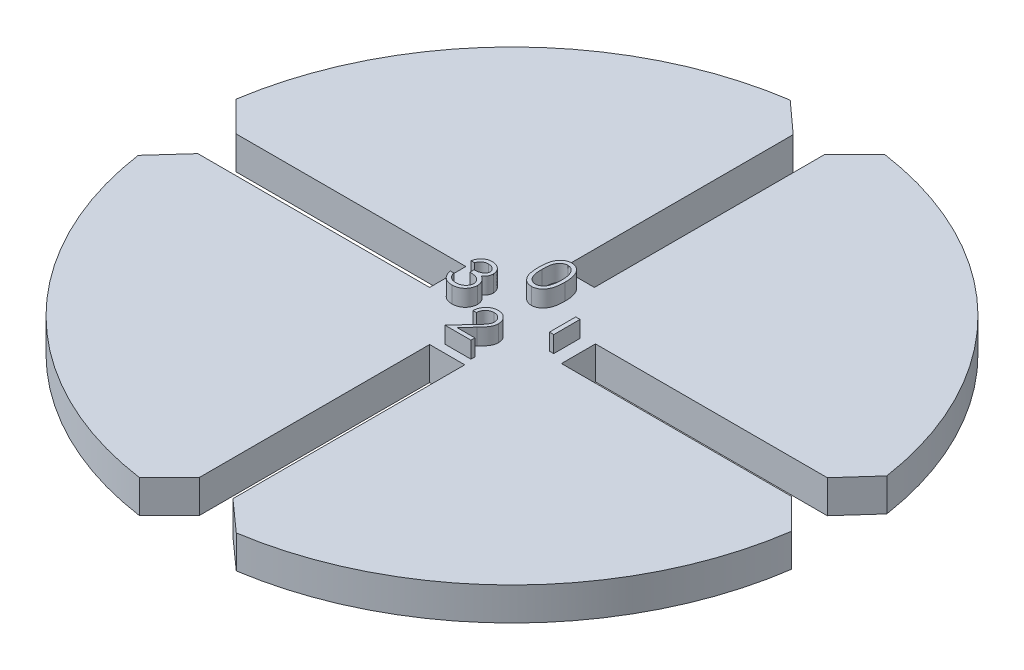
ISO-10303-21;
HEADER;
FILE_DESCRIPTION(('STEP AP214'),'2;1');
FILE_NAME('part.step','',(''),(''),'','','');
FILE_SCHEMA(('AUTOMOTIVE_DESIGN { 1 0 10303 214 1 1 1 1 }'));
ENDSEC;
DATA;
#1=APPLICATION_CONTEXT('core data for automotive mechanical design processes');
#2=APPLICATION_PROTOCOL_DEFINITION('international standard','automotive_design',2000,#1);
#3=PRODUCT_CONTEXT('',#1,'mechanical');
#4=PRODUCT('Part','Part','',(#3));
#5=PRODUCT_RELATED_PRODUCT_CATEGORY('part','',(#4));
#6=PRODUCT_DEFINITION_FORMATION('','',#4);
#7=PRODUCT_DEFINITION_CONTEXT('part definition',#1,'design');
#8=PRODUCT_DEFINITION('design','',#6,#7);
#9=PRODUCT_DEFINITION_SHAPE('','',#8);
#10=(LENGTH_UNIT() NAMED_UNIT(*) SI_UNIT(.MILLI.,.METRE.));
#11=(NAMED_UNIT(*) PLANE_ANGLE_UNIT() SI_UNIT($,.RADIAN.));
#12=(NAMED_UNIT(*) SI_UNIT($,.STERADIAN.) SOLID_ANGLE_UNIT());
#13=UNCERTAINTY_MEASURE_WITH_UNIT(LENGTH_MEASURE(1.E-05),#10,'distance_accuracy_value','');
#14=(GEOMETRIC_REPRESENTATION_CONTEXT(3) GLOBAL_UNCERTAINTY_ASSIGNED_CONTEXT((#13)) GLOBAL_UNIT_ASSIGNED_CONTEXT((#10,
#11,#12)) REPRESENTATION_CONTEXT('',''));
#15=CARTESIAN_POINT('',(0.,0.,0.));
#16=DIRECTION('',(0.,0.,1.));
#17=DIRECTION('',(1.,0.,0.));
#18=AXIS2_PLACEMENT_3D('',#15,#16,#17);
#19=CARTESIAN_POINT('',(0.,3.,0.));
#20=DIRECTION('',(0.,1.,0.));
#21=DIRECTION('',(0.,0.,1.));
#22=AXIS2_PLACEMENT_3D('',#19,#20,#21);
#23=PLANE('',#22);
#24=CARTESIAN_POINT('',(-3.67773226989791,3.,-1.53008422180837));
#25=CARTESIAN_POINT('',(-3.7175839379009,3.,-1.52869285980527));
#26=CARTESIAN_POINT('',(-3.79542351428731,3.,-1.52597520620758));
#27=CARTESIAN_POINT('',(-3.90763843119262,3.,-1.50217219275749));
#28=CARTESIAN_POINT('',(-4.01195776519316,3.,-1.46419410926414));
#29=CARTESIAN_POINT('',(-4.0916964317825,3.,-1.41886108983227));
#30=CARTESIAN_POINT('',(-4.15057900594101,3.,-1.37411065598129));
#31=CARTESIAN_POINT('',(-4.19265594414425,3.,-1.3350282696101));
#32=CARTESIAN_POINT('',(-4.23397645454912,3.,-1.29159544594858));
#33=CARTESIAN_POINT('',(-4.2718221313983,3.,-1.24113707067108));
#34=CARTESIAN_POINT('',(-4.31009610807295,3.,-1.18707028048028));
#35=CARTESIAN_POINT('',(-4.34494066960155,3.,-1.12664659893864));
#36=CARTESIAN_POINT('',(-4.37880036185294,3.,-1.06144220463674));
#37=CARTESIAN_POINT('',(-4.39920291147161,3.,-1.01534657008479));
#38=CARTESIAN_POINT('',(-4.40970342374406,3.,-0.991622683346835));
#39=B_SPLINE_CURVE_WITH_KNOTS('',3,(#24,#25,#26,#27,#28,#29,#30,#31,#32,#33,#34,#35,#36,#37,
#38),.UNSPECIFIED.,.F.,.F.,(4,1,1,1,1,1,1,1,1,1,1,1,4),(0.,0.122711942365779,0.239684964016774,
0.351815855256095,0.463766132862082,0.520817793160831,0.579448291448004,0.640604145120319,
0.705297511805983,0.773633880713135,0.844669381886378,0.920056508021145,1.),.UNSPECIFIED.);
#40=CARTESIAN_POINT('',(-3.67773226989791,3.,-1.53008422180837));
#41=VERTEX_POINT('',#40);
#42=CARTESIAN_POINT('',(-4.40970342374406,3.,-0.991622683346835));
#43=VERTEX_POINT('',#42);
#44=EDGE_CURVE('E473',#41,#43,#39,.T.);
#45=ORIENTED_EDGE('',*,*,#44,.T.);
#46=DIRECTION('',(-1.,0.,0.));
#47=VECTOR('',#46,1.);
#48=CARTESIAN_POINT('',(-4.40970342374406,3.,-0.991622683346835));
#49=LINE('',#48,#47);
#50=CARTESIAN_POINT('',(-4.72380598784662,3.,-0.991622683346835));
#51=VERTEX_POINT('',#50);
#52=EDGE_CURVE('E475',#43,#51,#49,.T.);
#53=ORIENTED_EDGE('',*,*,#52,.T.);
#54=CARTESIAN_POINT('',(-4.72380598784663,3.,-0.991622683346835));
#55=CARTESIAN_POINT('',(-4.71529643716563,3.,-1.02685516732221));
#56=CARTESIAN_POINT('',(-4.69866096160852,3.,-1.09573179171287));
#57=CARTESIAN_POINT('',(-4.66396338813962,3.,-1.19413905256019));
#58=CARTESIAN_POINT('',(-4.62616413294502,3.,-1.2872625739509));
#59=CARTESIAN_POINT('',(-4.58077502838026,3.,-1.3733586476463));
#60=CARTESIAN_POINT('',(-4.53126627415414,3.,-1.45415755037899));
#61=CARTESIAN_POINT('',(-4.47454355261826,3.,-1.52782667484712));
#62=CARTESIAN_POINT('',(-4.41322383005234,3.,-1.59623964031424));
#63=CARTESIAN_POINT('',(-4.34539888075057,3.,-1.65695287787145));
#64=CARTESIAN_POINT('',(-4.27427021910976,3.,-1.71193060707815));
#65=CARTESIAN_POINT('',(-4.19883559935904,3.,-1.75880566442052));
#66=CARTESIAN_POINT('',(-4.12061270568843,3.,-1.799129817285));
#67=CARTESIAN_POINT('',(-4.03905957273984,3.,-1.83235004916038));
#68=CARTESIAN_POINT('',(-3.95393340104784,3.,-1.85737557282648));
#69=CARTESIAN_POINT('',(-3.86600377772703,3.,-1.87553237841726));
#70=CARTESIAN_POINT('',(-3.77504027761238,3.,-1.88732349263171));
#71=CARTESIAN_POINT('',(-3.71329268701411,3.,-1.88847425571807));
#72=CARTESIAN_POINT('',(-3.68193900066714,3.,-1.88905858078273));
#73=B_SPLINE_CURVE_WITH_KNOTS('',3,(#54,#55,#56,#57,#58,#59,#60,#61,#62,#63,#64,#65,#66,#67,#68,
#69,#70,#71,#72),.UNSPECIFIED.,.F.,.F.,(4,1,1,1,1,1,1,1,1,1,1,1,1,1,1,1,4),(0.,
0.0726253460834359,0.141976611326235,0.208984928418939,0.273956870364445,0.336889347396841,
0.39874495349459,0.460115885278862,0.52082492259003,0.580994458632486,0.640151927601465,
0.698622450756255,0.757271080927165,0.81642669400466,0.87625404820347,0.937165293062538,1.),.UNSPECIFIED.);
#74=CARTESIAN_POINT('',(-3.68193900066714,3.,-1.88905858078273));
#75=VERTEX_POINT('',#74);
#76=EDGE_CURVE('E1731',#51,#75,#73,.T.);
#77=ORIENTED_EDGE('',*,*,#76,.T.);
#78=CARTESIAN_POINT('',(-3.68193900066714,3.,-1.88905858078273));
#79=CARTESIAN_POINT('',(-3.63625625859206,3.,-1.88767935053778));
#80=CARTESIAN_POINT('',(-3.54588724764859,3.,-1.88495097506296));
#81=CARTESIAN_POINT('',(-3.4131242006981,3.,-1.86003653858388));
#82=CARTESIAN_POINT('',(-3.28509738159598,3.,-1.82061140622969));
#83=CARTESIAN_POINT('',(-3.16320813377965,3.,-1.76613767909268));
#84=CARTESIAN_POINT('',(-3.04998970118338,3.,-1.69895036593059));
#85=CARTESIAN_POINT('',(-2.94925351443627,3.,-1.61898562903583));
#86=CARTESIAN_POINT('',(-2.86236500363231,3.,-1.52778632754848));
#87=CARTESIAN_POINT('',(-2.78947062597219,3.,-1.4270537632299));
#88=CARTESIAN_POINT('',(-2.73239562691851,3.,-1.31939825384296));
#89=CARTESIAN_POINT('',(-2.69030925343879,3.,-1.20859809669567));
#90=CARTESIAN_POINT('',(-2.66468757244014,3.,-1.09491612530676));
#91=CARTESIAN_POINT('',(-2.6613670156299,3.,-1.01815884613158));
#92=CARTESIAN_POINT('',(-2.65970342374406,3.,-0.979703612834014));
#93=B_SPLINE_CURVE_WITH_KNOTS('',3,(#78,#79,#80,#81,#82,#83,#84,#85,#86,#87,#88,#89,#90,#91,
#92),.UNSPECIFIED.,.F.,.F.,(4,1,1,1,1,1,1,1,1,1,1,1,4),(0.,0.0902542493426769,0.178539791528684,
0.26609303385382,0.354630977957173,0.441886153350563,0.525746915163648,0.608113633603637,
0.690197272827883,0.770821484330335,0.848326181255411,0.924011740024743,1.),.UNSPECIFIED.);
#94=CARTESIAN_POINT('',(-2.65970342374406,3.,-0.979703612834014));
#95=VERTEX_POINT('',#94);
#96=EDGE_CURVE('E1735',#75,#95,#93,.T.);
#97=ORIENTED_EDGE('',*,*,#96,.T.);
#98=CARTESIAN_POINT('',(-2.65970342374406,3.,-0.979703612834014));
#99=CARTESIAN_POINT('',(-2.66086701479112,3.,-0.942696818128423));
#100=CARTESIAN_POINT('',(-2.66314398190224,3.,-0.87028026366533));
#101=CARTESIAN_POINT('',(-2.68247768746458,3.,-0.764558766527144));
#102=CARTESIAN_POINT('',(-2.71501395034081,3.,-0.664917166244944));
#103=CARTESIAN_POINT('',(-2.76008371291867,3.,-0.570936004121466));
#104=CARTESIAN_POINT('',(-2.81842526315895,3.,-0.483211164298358));
#105=CARTESIAN_POINT('',(-2.88909796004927,3.,-0.401545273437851));
#106=CARTESIAN_POINT('',(-2.97260062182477,3.,-0.325576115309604));
#107=CARTESIAN_POINT('',(-3.03587955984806,3.,-0.28205664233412));
#108=CARTESIAN_POINT('',(-3.06845743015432,3.,-0.259651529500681));
#109=B_SPLINE_CURVE_WITH_KNOTS('',3,(#98,#99,#100,#101,#102,#103,#104,#105,#106,#107,#108),
.UNSPECIFIED.,.F.,.F.,(4,1,1,1,1,1,1,1,4),(0.,0.12806754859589,0.250608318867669,
0.370630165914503,0.490072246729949,0.61037476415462,0.734313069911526,0.863216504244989,1.),.UNSPECIFIED.);
#110=CARTESIAN_POINT('',(-3.06845743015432,3.,-0.259651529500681));
#111=VERTEX_POINT('',#110);
#112=EDGE_CURVE('E1742',#95,#111,#109,.T.);
#113=ORIENTED_EDGE('',*,*,#112,.T.);
#114=CARTESIAN_POINT('',(-3.06845743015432,3.,-0.259651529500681));
#115=CARTESIAN_POINT('',(-3.03122567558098,3.,-0.241673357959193));
#116=CARTESIAN_POINT('',(-2.95745880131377,3.,-0.206053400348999));
#117=CARTESIAN_POINT('',(-2.85690827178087,3.,-0.136197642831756));
#118=CARTESIAN_POINT('',(-2.76563039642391,3.,-0.055541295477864));
#119=CARTESIAN_POINT('',(-2.71472667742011,3.,0.0074013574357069));
#120=CARTESIAN_POINT('',(-2.68915053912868,3.,0.0390263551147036));
#121=B_SPLINE_CURVE_WITH_KNOTS('',3,(#114,#115,#116,#117,#118,#119,#120),.UNSPECIFIED.,.F.,.F.,
(4,1,1,1,4),(0.,0.253879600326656,0.503008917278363,0.750291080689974,1.),.UNSPECIFIED.);
#122=CARTESIAN_POINT('',(-2.68915053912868,3.,0.0390263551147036));
#123=VERTEX_POINT('',#122);
#124=EDGE_CURVE('E1749',#111,#123,#121,.T.);
#125=ORIENTED_EDGE('',*,*,#124,.T.);
#126=CARTESIAN_POINT('',(-2.68915053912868,3.,0.0390263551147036));
#127=CARTESIAN_POINT('',(-2.67230919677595,3.,0.0620841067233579));
#128=CARTESIAN_POINT('',(-2.6389023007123,3.,0.107822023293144));
#129=CARTESIAN_POINT('',(-2.59766676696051,3.,0.181358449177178));
#130=CARTESIAN_POINT('',(-2.56025765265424,3.,0.25570993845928));
#131=CARTESIAN_POINT('',(-2.53110743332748,3.,0.332869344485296));
#132=CARTESIAN_POINT('',(-2.50853356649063,3.,0.411942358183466));
#133=CARTESIAN_POINT('',(-2.49239753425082,3.,0.49306475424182));
#134=CARTESIAN_POINT('',(-2.48237339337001,3.,0.576302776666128));
#135=CARTESIAN_POINT('',(-2.48093784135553,3.,0.632615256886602));
#136=CARTESIAN_POINT('',(-2.48021624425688,3.,0.660921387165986));
#137=B_SPLINE_CURVE_WITH_KNOTS('',3,(#126,#127,#128,#129,#130,#131,#132,#133,#134,#135,#136),
.UNSPECIFIED.,.F.,.F.,(4,1,1,1,1,1,1,1,4),(0.,0.128135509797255,0.25417271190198,
0.378111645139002,0.501712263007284,0.623986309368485,0.747095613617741,0.872874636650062,1.),.UNSPECIFIED.);
#138=CARTESIAN_POINT('',(-2.48021624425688,3.,0.660921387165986));
#139=VERTEX_POINT('',#138);
#140=EDGE_CURVE('E1756',#123,#139,#137,.T.);
#141=ORIENTED_EDGE('',*,*,#140,.T.);
#142=CARTESIAN_POINT('',(-2.48021624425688,3.,0.660921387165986));
#143=CARTESIAN_POINT('',(-2.48201075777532,3.,0.709931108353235));
#144=CARTESIAN_POINT('',(-2.48559133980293,3.,0.807719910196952));
#145=CARTESIAN_POINT('',(-2.51759541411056,3.,0.952194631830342));
#146=CARTESIAN_POINT('',(-2.56720865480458,3.,1.0934201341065));
#147=CARTESIAN_POINT('',(-2.63766559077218,3.,1.2284949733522));
#148=CARTESIAN_POINT('',(-2.72353309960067,3.,1.3548753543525));
#149=CARTESIAN_POINT('',(-2.82569042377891,3.,1.46795166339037));
#150=CARTESIAN_POINT('',(-2.94297683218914,3.,1.56515026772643));
#151=CARTESIAN_POINT('',(-3.0737824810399,3.,1.64636049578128));
#152=CARTESIAN_POINT('',(-3.21549960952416,3.,1.71127841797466));
#153=CARTESIAN_POINT('',(-3.36707520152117,3.,1.75633586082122));
#154=CARTESIAN_POINT('',(-3.52632525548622,3.,1.78568186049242));
#155=CARTESIAN_POINT('',(-3.63553255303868,3.,1.78882872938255));
#156=CARTESIAN_POINT('',(-3.69105358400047,3.,1.79042859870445));
#157=B_SPLINE_CURVE_WITH_KNOTS('',3,(#142,#143,#144,#145,#146,#147,#148,#149,#150,#151,#152,
#153,#154,#155,#156),.UNSPECIFIED.,.F.,.F.,(4,1,1,1,1,1,1,1,1,1,1,1,4),(0.,0.0796482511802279,
0.158921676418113,0.239619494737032,0.322609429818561,0.406034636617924,0.487602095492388,
0.569684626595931,0.653036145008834,0.737435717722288,0.82247781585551,0.909747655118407,1.),.UNSPECIFIED.);
#158=CARTESIAN_POINT('',(-3.69105358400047,3.,1.79042859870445));
#159=VERTEX_POINT('',#158);
#160=EDGE_CURVE('E1763',#139,#159,#157,.T.);
#161=ORIENTED_EDGE('',*,*,#160,.T.);
#162=CARTESIAN_POINT('',(-3.69105358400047,3.,1.79042859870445));
#163=CARTESIAN_POINT('',(-3.7284728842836,3.,1.78956038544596));
#164=CARTESIAN_POINT('',(-3.80210158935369,3.,1.78785203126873));
#165=CARTESIAN_POINT('',(-3.91034508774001,3.,1.77617343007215));
#166=CARTESIAN_POINT('',(-4.01366678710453,3.,1.75484342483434));
#167=CARTESIAN_POINT('',(-4.1122063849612,3.,1.72614011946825));
#168=CARTESIAN_POINT('',(-4.20605142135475,3.,1.68974837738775));
#169=CARTESIAN_POINT('',(-4.29491552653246,3.,1.64442967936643));
#170=CARTESIAN_POINT('',(-4.37934542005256,3.,1.5911181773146));
#171=CARTESIAN_POINT('',(-4.45854437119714,3.,1.52918458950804));
#172=CARTESIAN_POINT('',(-4.53250293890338,3.,1.45990324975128));
#173=CARTESIAN_POINT('',(-4.5992556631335,3.,1.38204423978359));
#174=CARTESIAN_POINT('',(-4.6599154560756,3.,1.29704683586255));
#175=CARTESIAN_POINT('',(-4.7128580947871,3.,1.20392377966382));
#176=CARTESIAN_POINT('',(-4.76049504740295,3.,1.10387852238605));
#177=CARTESIAN_POINT('',(-4.79967600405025,3.,0.995630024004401));
#178=CARTESIAN_POINT('',(-4.83416157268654,3.,0.880146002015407));
#179=CARTESIAN_POINT('',(-4.85019503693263,3.,0.799668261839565));
#180=CARTESIAN_POINT('',(-4.85842137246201,3.,0.758377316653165));
#181=B_SPLINE_CURVE_WITH_KNOTS('',3,(#162,#163,#164,#165,#166,#167,#168,#169,#170,#171,#172,
#173,#174,#175,#176,#177,#178,#179,#180),.UNSPECIFIED.,.F.,.F.,(4,1,1,1,1,1,1,1,1,1,1,1,1,1,1,1,
4),(0.,0.0655411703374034,0.128963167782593,0.190377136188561,0.250092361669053,
0.308548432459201,0.366397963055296,0.42454218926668,0.483169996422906,0.54224339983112,
0.60173935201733,0.662506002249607,0.724855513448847,0.789127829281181,0.85634639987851,
0.926295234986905,1.),.UNSPECIFIED.);
#182=CARTESIAN_POINT('',(-4.85842137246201,3.,0.758377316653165));
#183=VERTEX_POINT('',#182);
#184=EDGE_CURVE('E1770',#159,#183,#181,.T.);
#185=ORIENTED_EDGE('',*,*,#184,.T.);
#186=DIRECTION('',(1.,0.,0.));
#187=VECTOR('',#186,1.);
#188=CARTESIAN_POINT('',(-4.85842137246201,3.,0.758377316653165));
#189=LINE('',#188,#187);
#190=CARTESIAN_POINT('',(-4.54431880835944,3.,0.758377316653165));
#191=VERTEX_POINT('',#190);
#192=EDGE_CURVE('E1777',#183,#191,#189,.T.);
#193=ORIENTED_EDGE('',*,*,#192,.T.);
#194=CARTESIAN_POINT('',(-4.54431880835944,3.,0.758377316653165));
#195=CARTESIAN_POINT('',(-4.53613551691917,3.,0.785326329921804));
#196=CARTESIAN_POINT('',(-4.52021830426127,3.,0.837744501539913));
#197=CARTESIAN_POINT('',(-4.49312400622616,3.,0.913184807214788));
#198=CARTESIAN_POINT('',(-4.4622557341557,3.,0.982342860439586));
#199=CARTESIAN_POINT('',(-4.42914117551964,3.,1.04572598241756));
#200=CARTESIAN_POINT('',(-4.39436272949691,3.,1.10395838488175));
#201=CARTESIAN_POINT('',(-4.3554478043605,3.,1.15550025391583));
#202=CARTESIAN_POINT('',(-4.31527865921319,3.,1.20261545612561));
#203=CARTESIAN_POINT('',(-4.28499930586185,3.,1.22916006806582));
#204=CARTESIAN_POINT('',(-4.27018018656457,3.,1.2421513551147));
#205=B_SPLINE_CURVE_WITH_KNOTS('',3,(#194,#195,#196,#197,#198,#199,#200,#201,#202,#203,#204),
.UNSPECIFIED.,.F.,.F.,(4,1,1,1,1,1,1,1,4),(0.,0.149770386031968,0.291316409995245,
0.425966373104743,0.552159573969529,0.671527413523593,0.786121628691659,0.895325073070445,1.),.UNSPECIFIED.);
#206=CARTESIAN_POINT('',(-4.27018018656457,3.,1.2421513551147));
#207=VERTEX_POINT('',#206);
#208=EDGE_CURVE('E1782',#191,#207,#205,.T.);
#209=ORIENTED_EDGE('',*,*,#208,.T.);
#210=CARTESIAN_POINT('',(-4.27018018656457,3.,1.2421513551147));
#211=CARTESIAN_POINT('',(-4.25058361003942,3.,1.25725968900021));
#212=CARTESIAN_POINT('',(-4.21145094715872,3.,1.28742972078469));
#213=CARTESIAN_POINT('',(-4.14768271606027,3.,1.32593134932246));
#214=CARTESIAN_POINT('',(-4.08061782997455,3.,1.35929237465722));
#215=CARTESIAN_POINT('',(-4.00880315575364,3.,1.38477607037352));
#216=CARTESIAN_POINT('',(-3.9337883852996,3.,1.40635373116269));
#217=CARTESIAN_POINT('',(-3.85436102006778,3.,1.42047425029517));
#218=CARTESIAN_POINT('',(-3.77122180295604,3.,1.43016242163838));
#219=CARTESIAN_POINT('',(-3.71445403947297,3.,1.43101735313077));
#220=CARTESIAN_POINT('',(-3.6854446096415,3.,1.43145423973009));
#221=B_SPLINE_CURVE_WITH_KNOTS('',3,(#210,#211,#212,#213,#214,#215,#216,#217,#218,#219,#220),
.UNSPECIFIED.,.F.,.F.,(4,1,1,1,1,1,1,1,4),(0.,0.118271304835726,0.236177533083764,
0.355662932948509,0.475904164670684,0.600127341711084,0.72860811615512,0.861313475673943,1.),.UNSPECIFIED.);
#222=CARTESIAN_POINT('',(-3.6854446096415,3.,1.43145423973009));
#223=VERTEX_POINT('',#222);
#224=EDGE_CURVE('E1786',#207,#223,#221,.T.);
#225=ORIENTED_EDGE('',*,*,#224,.T.);
#226=CARTESIAN_POINT('',(-3.6854446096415,3.,1.43145423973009));
#227=CARTESIAN_POINT('',(-3.65269110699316,3.,1.43083833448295));
#228=CARTESIAN_POINT('',(-3.58864446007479,3.,1.42963398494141));
#229=CARTESIAN_POINT('',(-3.49518960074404,3.,1.41855827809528));
#230=CARTESIAN_POINT('',(-3.40628215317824,3.,1.40242786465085));
#231=CARTESIAN_POINT('',(-3.32290922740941,3.,1.37751488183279));
#232=CARTESIAN_POINT('',(-3.24397872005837,3.,1.34673403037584));
#233=CARTESIAN_POINT('',(-3.17059707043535,3.,1.30808562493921));
#234=CARTESIAN_POINT('',(-3.10180096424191,3.,1.262740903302));
#235=CARTESIAN_POINT('',(-3.03847155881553,3.,1.21120174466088));
#236=CARTESIAN_POINT('',(-2.98152605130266,3.,1.15478024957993));
#237=CARTESIAN_POINT('',(-2.93138653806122,3.,1.09576717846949));
#238=CARTESIAN_POINT('',(-2.88876187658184,3.,1.03441134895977));
#239=CARTESIAN_POINT('',(-2.85437829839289,3.,0.970373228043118));
#240=CARTESIAN_POINT('',(-2.82722774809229,3.,0.903917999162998));
#241=CARTESIAN_POINT('',(-2.80874454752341,3.,0.834859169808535));
#242=CARTESIAN_POINT('',(-2.79589303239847,3.,0.763761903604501));
#243=CARTESIAN_POINT('',(-2.79484642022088,3.,0.715432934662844));
#244=CARTESIAN_POINT('',(-2.79431880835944,3.,0.691069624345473));
#245=B_SPLINE_CURVE_WITH_KNOTS('',3,(#226,#227,#228,#229,#230,#231,#232,#233,#234,#235,#236,
#237,#238,#239,#240,#241,#242,#243,#244),.UNSPECIFIED.,.F.,.F.,(4,1,1,1,1,1,1,1,1,1,1,1,1,1,1,1,
4),(0.,0.0760717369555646,0.148751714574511,0.218402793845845,0.285759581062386,
0.350598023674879,0.414964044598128,0.478069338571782,0.541760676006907,0.604349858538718,
0.664075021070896,0.721463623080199,0.777587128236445,0.832644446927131,0.88784351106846,
0.943460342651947,1.),.UNSPECIFIED.);
#246=CARTESIAN_POINT('',(-2.79431880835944,3.,0.691069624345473));
#247=VERTEX_POINT('',#246);
#248=EDGE_CURVE('E1793',#223,#247,#245,.T.);
#249=ORIENTED_EDGE('',*,*,#248,.T.);
#250=CARTESIAN_POINT('',(-2.79431880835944,3.,0.691069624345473));
#251=CARTESIAN_POINT('',(-2.79584910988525,3.,0.658458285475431));
#252=CARTESIAN_POINT('',(-2.79890209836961,3.,0.593397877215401));
#253=CARTESIAN_POINT('',(-2.822210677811,3.,0.497680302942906));
#254=CARTESIAN_POINT('',(-2.86054954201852,3.,0.405456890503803));
#255=CARTESIAN_POINT('',(-2.9142220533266,3.,0.318301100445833));
#256=CARTESIAN_POINT('',(-2.97955778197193,3.,0.237525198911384));
#257=CARTESIAN_POINT('',(-3.05592268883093,3.,0.16545371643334));
#258=CARTESIAN_POINT('',(-3.14395091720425,3.,0.105983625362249));
#259=CARTESIAN_POINT('',(-3.22497078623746,3.,0.0648949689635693));
#260=CARTESIAN_POINT('',(-3.29673594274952,3.,0.0368578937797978));
#261=CARTESIAN_POINT('',(-3.35815132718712,3.,0.0181829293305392));
#262=CARTESIAN_POINT('',(-3.42690793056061,3.,0.00236927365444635));
#263=CARTESIAN_POINT('',(-3.50217427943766,3.,-0.0123429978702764));
#264=CARTESIAN_POINT('',(-3.58451749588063,3.,-0.0248643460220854));
#265=CARTESIAN_POINT('',(-3.67384793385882,3.,-0.035306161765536));
#266=CARTESIAN_POINT('',(-3.77018369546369,3.,-0.0436612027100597));
#267=CARTESIAN_POINT('',(-3.83687486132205,3.,-0.0473922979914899));
#268=CARTESIAN_POINT('',(-3.87124188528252,3.,-0.0493149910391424));
#269=B_SPLINE_CURVE_WITH_KNOTS('',3,(#250,#251,#252,#253,#254,#255,#256,#257,#258,#259,#260,
#261,#262,#263,#264,#265,#266,#267,#268),.UNSPECIFIED.,.F.,.F.,(4,1,1,1,1,1,1,1,1,1,1,1,1,1,1,1,
4),(0.,0.0669091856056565,0.133485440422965,0.201035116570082,0.271234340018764,
0.342879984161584,0.41383612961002,0.48597662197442,0.560229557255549,0.599884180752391,
0.644054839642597,0.691891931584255,0.744687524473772,0.801491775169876,0.862857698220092,
0.929328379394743,1.),.UNSPECIFIED.);
#270=CARTESIAN_POINT('',(-3.87124188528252,3.,-0.0493149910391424));
#271=VERTEX_POINT('',#270);
#272=EDGE_CURVE('E1800',#247,#271,#269,.T.);
#273=ORIENTED_EDGE('',*,*,#272,.T.);
#274=DIRECTION('',(0.,0.,-1.));
#275=VECTOR('',#274,1.);
#276=CARTESIAN_POINT('',(-3.87124188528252,3.,-0.0493149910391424));
#277=LINE('',#276,#275);
#278=CARTESIAN_POINT('',(-3.87124188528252,3.,-0.408289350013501));
#279=VERTEX_POINT('',#278);
#280=EDGE_CURVE('E1807',#271,#279,#277,.T.);
#281=ORIENTED_EDGE('',*,*,#280,.T.);
#282=CARTESIAN_POINT('',(-3.87124188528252,3.,-0.408289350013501));
#283=CARTESIAN_POINT('',(-3.82794071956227,3.,-0.409024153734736));
#284=CARTESIAN_POINT('',(-3.74312437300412,3.,-0.410463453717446));
#285=CARTESIAN_POINT('',(-3.61923006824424,3.,-0.42787146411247));
#286=CARTESIAN_POINT('',(-3.50075675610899,3.,-0.451952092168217));
#287=CARTESIAN_POINT('',(-3.39033001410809,3.,-0.488837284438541));
#288=CARTESIAN_POINT('',(-3.28968130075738,3.,-0.531677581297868));
#289=CARTESIAN_POINT('',(-3.20236169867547,3.,-0.58152979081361));
#290=CARTESIAN_POINT('',(-3.12959455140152,3.,-0.636944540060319));
#291=CARTESIAN_POINT('',(-3.07173347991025,3.,-0.698777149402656));
#292=CARTESIAN_POINT('',(-3.02820425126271,3.,-0.765092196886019));
#293=CARTESIAN_POINT('',(-2.99637745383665,3.,-0.834208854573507));
#294=CARTESIAN_POINT('',(-2.97757712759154,3.,-0.906732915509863));
#295=CARTESIAN_POINT('',(-2.97506746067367,3.,-0.956227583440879));
#296=CARTESIAN_POINT('',(-2.97380598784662,3.,-0.981105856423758));
#297=B_SPLINE_CURVE_WITH_KNOTS('',3,(#282,#283,#284,#285,#286,#287,#288,#289,#290,#291,#292,
#293,#294,#295,#296),.UNSPECIFIED.,.F.,.F.,(4,1,1,1,1,1,1,1,1,1,1,1,4),(0.,0.110165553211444,
0.215787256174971,0.318027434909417,0.417573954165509,0.511650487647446,0.596162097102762,
0.672934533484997,0.743669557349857,0.810677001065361,0.874058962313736,0.936696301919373,1.),.UNSPECIFIED.);
#298=CARTESIAN_POINT('',(-2.97380598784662,3.,-0.981105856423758));
#299=VERTEX_POINT('',#298);
#300=EDGE_CURVE('E1812',#279,#299,#297,.T.);
#301=ORIENTED_EDGE('',*,*,#300,.T.);
#302=CARTESIAN_POINT('',(-2.97380598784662,3.,-0.981105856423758));
#303=CARTESIAN_POINT('',(-2.97422039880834,3.,-0.999383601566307));
#304=CARTESIAN_POINT('',(-2.97504484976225,3.,-1.03574630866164));
#305=CARTESIAN_POINT('',(-2.98544212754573,3.,-1.08887137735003));
#306=CARTESIAN_POINT('',(-3.00106616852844,3.,-1.14037232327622));
#307=CARTESIAN_POINT('',(-3.02254589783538,3.,-1.19003013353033));
#308=CARTESIAN_POINT('',(-3.05129609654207,3.,-1.23750040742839));
#309=CARTESIAN_POINT('',(-3.08570208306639,3.,-1.28318785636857));
#310=CARTESIAN_POINT('',(-3.12667018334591,3.,-1.32683163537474));
#311=CARTESIAN_POINT('',(-3.17361563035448,3.,-1.36751195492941));
#312=CARTESIAN_POINT('',(-3.22402743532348,3.,-1.40628119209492));
#313=CARTESIAN_POINT('',(-3.27927721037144,3.,-1.43919482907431));
#314=CARTESIAN_POINT('',(-3.33769908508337,3.,-1.46733989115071));
#315=CARTESIAN_POINT('',(-3.39935773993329,3.,-1.49054939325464));
#316=CARTESIAN_POINT('',(-3.46445327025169,3.,-1.50800868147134));
#317=CARTESIAN_POINT('',(-3.53267982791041,3.,-1.52054452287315));
#318=CARTESIAN_POINT('',(-3.60416751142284,3.,-1.52838217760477));
#319=CARTESIAN_POINT('',(-3.65293924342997,3.,-1.52951059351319));
#320=CARTESIAN_POINT('',(-3.67773226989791,3.,-1.53008422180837));
#321=B_SPLINE_CURVE_WITH_KNOTS('',3,(#302,#303,#304,#305,#306,#307,#308,#309,#310,#311,#312,
#313,#314,#315,#316,#317,#318,#319,#320),.UNSPECIFIED.,.F.,.F.,(4,1,1,1,1,1,1,1,1,1,1,1,1,1,1,1,
4),(0.,0.0552745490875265,0.109966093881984,0.163247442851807,0.218076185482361,
0.273300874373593,0.330909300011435,0.390994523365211,0.454175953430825,0.518861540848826,
0.583310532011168,0.648516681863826,0.715030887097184,0.782502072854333,0.852322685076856,
0.924928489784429,1.),.UNSPECIFIED.);
#322=EDGE_CURVE('E488',#299,#41,#321,.T.);
#323=ORIENTED_EDGE('',*,*,#322,.T.);
#324=EDGE_LOOP('',(#45,#53,#77,#97,#113,#125,#141,#161,#185,#193,#209,#225,#249,#273,#281,#301,#323));
#325=FACE_BOUND('',#324,.T.);
#326=CARTESIAN_POINT('',(0.0401757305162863,3.,-1.71995968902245));
#327=CARTESIAN_POINT('',(0.0125716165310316,3.,-1.72042604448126));
#328=CARTESIAN_POINT('',(-0.0418583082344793,3.,-1.72134560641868));
#329=CARTESIAN_POINT('',(-0.12251073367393,3.,-1.73085933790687));
#330=CARTESIAN_POINT('',(-0.200793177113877,3.,-1.74615484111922));
#331=CARTESIAN_POINT('',(-0.277091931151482,3.,-1.76757144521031));
#332=CARTESIAN_POINT('',(-0.351798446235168,3.,-1.79378628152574));
#333=CARTESIAN_POINT('',(-0.423894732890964,3.,-1.82793996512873));
#334=CARTESIAN_POINT('',(-0.494182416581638,3.,-1.86727403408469));
#335=CARTESIAN_POINT('',(-0.56247397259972,3.,-1.91206945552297));
#336=CARTESIAN_POINT('',(-0.627486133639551,3.,-1.96339113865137));
#337=CARTESIAN_POINT('',(-0.689584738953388,3.,-2.02015542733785));
#338=CARTESIAN_POINT('',(-0.747209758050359,3.,-2.08377883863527));
#339=CARTESIAN_POINT('',(-0.800843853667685,3.,-2.15325676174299));
#340=CARTESIAN_POINT('',(-0.851817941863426,3.,-2.22795000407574));
#341=CARTESIAN_POINT('',(-0.898707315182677,3.,-2.30887837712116));
#342=CARTESIAN_POINT('',(-0.942078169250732,3.,-2.39572098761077));
#343=CARTESIAN_POINT('',(-0.981721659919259,3.,-2.48903889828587));
#344=CARTESIAN_POINT('',(-1.01687032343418,3.,-2.59019382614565));
#345=CARTESIAN_POINT('',(-1.0479180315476,3.,-2.70034300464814));
#346=CARTESIAN_POINT('',(-1.07243218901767,3.,-2.82045864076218));
#347=CARTESIAN_POINT('',(-1.09341514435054,3.,-2.94957600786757));
#348=CARTESIAN_POINT('',(-1.11033952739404,3.,-3.08824993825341));
#349=CARTESIAN_POINT('',(-1.12189385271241,3.,-3.23655571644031));
#350=CARTESIAN_POINT('',(-1.12903516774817,3.,-3.39440092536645));
#351=CARTESIAN_POINT('',(-1.12967023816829,3.,-3.50267069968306));
#352=CARTESIAN_POINT('',(-1.12999654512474,3.,-3.5583010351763));
#353=B_SPLINE_CURVE_WITH_KNOTS('',3,(#326,#327,#328,#329,#330,#331,#332,#333,#334,#335,#336,
#337,#338,#339,#340,#341,#342,#343,#344,#345,#346,#347,#348,#349,#350,#351,#352),.UNSPECIFIED.,
.F.,.F.,(4,1,1,1,1,1,1,1,1,1,1,1,1,1,1,1,1,1,1,1,1,1,1,1,4),(0.,0.0337871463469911,
0.0666216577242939,0.0992848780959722,0.131361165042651,0.163585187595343,0.196103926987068,
0.228902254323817,0.262158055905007,0.295991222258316,0.3302178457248,0.365059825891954,
0.400950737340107,0.437620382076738,0.475707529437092,0.515380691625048,0.556413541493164,
0.599764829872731,0.646424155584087,0.696431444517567,0.749781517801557,0.806573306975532,
0.867435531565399,0.931886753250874,1.),.UNSPECIFIED.);
#354=CARTESIAN_POINT('',(0.0401757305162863,3.,-1.71995968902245));
#355=VERTEX_POINT('',#354);
#356=CARTESIAN_POINT('',(-1.12999654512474,3.,-3.5583010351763));
#357=VERTEX_POINT('',#356);
#358=EDGE_CURVE('E576',#355,#357,#353,.T.);
#359=ORIENTED_EDGE('',*,*,#358,.T.);
#360=CARTESIAN_POINT('',(-1.12999654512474,3.,-3.5583010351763));
#361=CARTESIAN_POINT('',(-1.12966852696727,3.,-3.61439842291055));
#362=CARTESIAN_POINT('',(-1.12903134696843,3.,-3.72336840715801));
#363=CARTESIAN_POINT('',(-1.12194292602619,3.,-3.88215304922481));
#364=CARTESIAN_POINT('',(-1.11016758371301,3.,-4.03111333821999));
#365=CARTESIAN_POINT('',(-1.09403021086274,3.,-4.17025640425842));
#366=CARTESIAN_POINT('',(-1.07439223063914,3.,-4.29961816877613));
#367=CARTESIAN_POINT('',(-1.04817674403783,3.,-4.41885292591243));
#368=CARTESIAN_POINT('',(-1.01836394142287,3.,-4.52851253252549));
#369=CARTESIAN_POINT('',(-0.983811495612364,3.,-4.62895458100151));
#370=CARTESIAN_POINT('',(-0.944823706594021,3.,-4.72153228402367));
#371=CARTESIAN_POINT('',(-0.902389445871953,3.,-4.80795748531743));
#372=CARTESIAN_POINT('',(-0.854824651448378,3.,-4.88809941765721));
#373=CARTESIAN_POINT('',(-0.804847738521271,3.,-4.96323720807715));
#374=CARTESIAN_POINT('',(-0.750435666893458,3.,-5.0321409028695));
#375=CARTESIAN_POINT('',(-0.693136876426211,3.,-5.09578356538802));
#376=CARTESIAN_POINT('',(-0.630715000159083,3.,-5.15269431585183));
#377=CARTESIAN_POINT('',(-0.565291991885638,3.,-5.2045406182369));
#378=CARTESIAN_POINT('',(-0.496275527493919,3.,-5.24999008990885));
#379=CARTESIAN_POINT('',(-0.425632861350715,3.,-5.29002282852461));
#380=CARTESIAN_POINT('',(-0.35287775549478,3.,-5.32422269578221));
#381=CARTESIAN_POINT('',(-0.277811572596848,3.,-5.35111313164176));
#382=CARTESIAN_POINT('',(-0.201109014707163,3.,-5.37332397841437));
#383=CARTESIAN_POINT('',(-0.122501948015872,3.,-5.38851292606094));
#384=CARTESIAN_POINT('',(-0.0418605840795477,3.,-5.39806983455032));
#385=CARTESIAN_POINT('',(0.0125708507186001,3.,-5.39898350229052));
#386=CARTESIAN_POINT('',(0.0401757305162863,3.,-5.39944686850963));
#387=B_SPLINE_CURVE_WITH_KNOTS('',3,(#360,#361,#362,#363,#364,#365,#366,#367,#368,#369,#370,
#371,#372,#373,#374,#375,#376,#377,#378,#379,#380,#381,#382,#383,#384,#385,#386),.UNSPECIFIED.,
.F.,.F.,(4,1,1,1,1,1,1,1,1,1,1,1,1,1,1,1,1,1,1,1,1,1,1,1,4),(0.,0.0685946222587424,
0.133246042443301,0.194312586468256,0.251279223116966,0.304513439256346,0.354234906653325,
0.400480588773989,0.443410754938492,0.484014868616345,0.523252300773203,0.56104237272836,
0.5979002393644,0.633518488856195,0.668314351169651,0.702495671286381,0.736685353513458,
0.770293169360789,0.803437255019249,0.835912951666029,0.868460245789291,0.900846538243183,
0.933466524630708,0.966257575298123,1.),.UNSPECIFIED.);
#388=CARTESIAN_POINT('',(0.0401757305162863,3.,-5.39944686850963));
#389=VERTEX_POINT('',#388);
#390=EDGE_CURVE('E1065',#357,#389,#387,.T.);
#391=ORIENTED_EDGE('',*,*,#390,.T.);
#392=CARTESIAN_POINT('',(0.0401757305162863,3.,-5.39944686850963));
#393=CARTESIAN_POINT('',(0.0680112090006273,3.,-5.39895905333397));
#394=CARTESIAN_POINT('',(0.123367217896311,3.,-5.39798894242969));
#395=CARTESIAN_POINT('',(0.205207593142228,3.,-5.38866499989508));
#396=CARTESIAN_POINT('',(0.285157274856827,3.,-5.37319387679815));
#397=CARTESIAN_POINT('',(0.362875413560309,3.,-5.35127290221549));
#398=CARTESIAN_POINT('',(0.439000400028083,3.,-5.32407722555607));
#399=CARTESIAN_POINT('',(0.512936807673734,3.,-5.28999010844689));
#400=CARTESIAN_POINT('',(0.585143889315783,3.,-5.25031124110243));
#401=CARTESIAN_POINT('',(0.654474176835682,3.,-5.2036873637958));
#402=CARTESIAN_POINT('',(0.721688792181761,3.,-5.15170508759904));
#403=CARTESIAN_POINT('',(0.785136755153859,3.,-5.0929424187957));
#404=CARTESIAN_POINT('',(0.844823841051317,3.,-5.02799269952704));
#405=CARTESIAN_POINT('',(0.90149914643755,3.,-4.95755083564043));
#406=CARTESIAN_POINT('',(0.953554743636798,3.,-4.88026575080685));
#407=CARTESIAN_POINT('',(1.00312817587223,3.,-4.79748164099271));
#408=CARTESIAN_POINT('',(1.04750021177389,3.,-4.7077507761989));
#409=CARTESIAN_POINT('',(1.09023488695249,3.,-4.61257030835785));
#410=CARTESIAN_POINT('',(1.12712187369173,3.,-4.50930664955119));
#411=CARTESIAN_POINT('',(1.16038811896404,3.,-4.39854188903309));
#412=CARTESIAN_POINT('',(1.18726708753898,3.,-4.27896770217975));
#413=CARTESIAN_POINT('',(1.20965635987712,3.,-4.15121145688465));
#414=CARTESIAN_POINT('',(1.22700125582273,3.,-4.01480397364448));
#415=CARTESIAN_POINT('',(1.23963389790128,3.,-3.87003765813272));
#416=CARTESIAN_POINT('',(1.24630698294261,3.,-3.71681726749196));
#417=CARTESIAN_POINT('',(1.24756368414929,3.,-3.6120594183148));
#418=CARTESIAN_POINT('',(1.24820858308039,3.,-3.5583010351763));
#419=B_SPLINE_CURVE_WITH_KNOTS('',3,(#392,#393,#394,#395,#396,#397,#398,#399,#400,#401,#402,
#403,#404,#405,#406,#407,#408,#409,#410,#411,#412,#413,#414,#415,#416,#417,#418),.UNSPECIFIED.,
.F.,.F.,(4,1,1,1,1,1,1,1,1,1,1,1,1,1,1,1,1,1,1,1,1,1,1,1,4),(0.,0.0337881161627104,
0.0671939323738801,0.0998624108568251,0.132566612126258,0.165151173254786,0.197913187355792,
0.231319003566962,0.265083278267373,0.299255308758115,0.334398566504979,0.369942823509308,
0.406283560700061,0.444063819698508,0.482997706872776,0.523354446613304,0.565536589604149,
0.609612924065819,0.656390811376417,0.705885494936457,0.758324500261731,0.81383178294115,
0.87279455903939,0.934722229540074,1.),.UNSPECIFIED.);
#420=CARTESIAN_POINT('',(1.24820858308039,3.,-3.5583010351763));
#421=VERTEX_POINT('',#420);
#422=EDGE_CURVE('E1072',#389,#421,#419,.T.);
#423=ORIENTED_EDGE('',*,*,#422,.T.);
#424=CARTESIAN_POINT('',(1.24820858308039,3.,-3.5583010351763));
#425=CARTESIAN_POINT('',(1.24755699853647,3.,-3.50477712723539));
#426=CARTESIAN_POINT('',(1.24628741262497,3.,-3.40048797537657));
#427=CARTESIAN_POINT('',(1.23970870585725,3.,-3.24795700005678));
#428=CARTESIAN_POINT('',(1.22675007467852,3.,-3.10395895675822));
#429=CARTESIAN_POINT('',(1.21054008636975,3.,-2.9681484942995));
#430=CARTESIAN_POINT('',(1.18808912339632,3.,-2.84109087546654));
#431=CARTESIAN_POINT('',(1.16048395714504,3.,-2.72234642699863));
#432=CARTESIAN_POINT('',(1.12983363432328,3.,-2.6114023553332));
#433=CARTESIAN_POINT('',(1.09199884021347,3.,-2.50916754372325));
#434=CARTESIAN_POINT('',(1.05058812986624,3.,-2.41421582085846));
#435=CARTESIAN_POINT('',(1.00553293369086,3.,-2.32554867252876));
#436=CARTESIAN_POINT('',(0.957263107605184,3.,-2.24238237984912));
#437=CARTESIAN_POINT('',(0.904674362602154,3.,-2.16538263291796));
#438=CARTESIAN_POINT('',(0.848620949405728,3.,-2.09400397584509));
#439=CARTESIAN_POINT('',(0.787903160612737,3.,-2.02950635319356));
#440=CARTESIAN_POINT('',(0.724232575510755,3.,-1.97033568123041));
#441=CARTESIAN_POINT('',(0.656820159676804,3.,-1.91768405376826));
#442=CARTESIAN_POINT('',(0.586408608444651,3.,-1.8715992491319));
#443=CARTESIAN_POINT('',(0.51444953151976,3.,-1.83038539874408));
#444=CARTESIAN_POINT('',(0.439666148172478,3.,-1.79715270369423));
#445=CARTESIAN_POINT('',(0.36375319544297,3.,-1.76861766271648));
#446=CARTESIAN_POINT('',(0.285624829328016,3.,-1.74681721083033));
#447=CARTESIAN_POINT('',(0.205378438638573,3.,-1.73174335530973));
#448=CARTESIAN_POINT('',(0.123422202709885,3.,-1.72117150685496));
#449=CARTESIAN_POINT('',(0.0680206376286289,3.,-1.72036502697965));
#450=CARTESIAN_POINT('',(0.0401757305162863,3.,-1.71995968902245));
#451=B_SPLINE_CURVE_WITH_KNOTS('',3,(#424,#425,#426,#427,#428,#429,#430,#431,#432,#433,#434,
#435,#436,#437,#438,#439,#440,#441,#442,#443,#444,#445,#446,#447,#448,#449,#450),.UNSPECIFIED.,
.F.,.F.,(4,1,1,1,1,1,1,1,1,1,1,1,1,1,1,1,1,1,1,1,1,1,1,1,4),(0.,0.0650632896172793,
0.126773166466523,0.185515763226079,0.240764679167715,0.292979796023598,0.342250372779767,
0.38891928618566,0.43277566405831,0.474628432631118,0.514774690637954,0.553605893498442,
0.591426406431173,0.628028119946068,0.663803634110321,0.698984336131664,0.733591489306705,
0.76762846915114,0.801208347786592,0.834263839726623,0.866980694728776,0.899719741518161,
0.932701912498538,0.96617588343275,1.),.UNSPECIFIED.);
#452=EDGE_CURVE('E584',#421,#355,#451,.T.);
#453=ORIENTED_EDGE('',*,*,#452,.T.);
#454=EDGE_LOOP('',(#359,#391,#423,#453));
#455=FACE_BOUND('',#454,.T.);
#456=CARTESIAN_POINT('',(0.418545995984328,3.,2.045434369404));
#457=CARTESIAN_POINT('',(0.391175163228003,3.,2.04614940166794));
#458=CARTESIAN_POINT('',(0.337423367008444,3.,2.0475536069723));
#459=CARTESIAN_POINT('',(0.258504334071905,3.,2.05737627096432));
#460=CARTESIAN_POINT('',(0.183218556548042,3.,2.07432211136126));
#461=CARTESIAN_POINT('',(0.111376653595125,3.,2.09749878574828));
#462=CARTESIAN_POINT('',(0.0428570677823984,3.,2.1269573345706));
#463=CARTESIAN_POINT('',(-0.0220069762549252,3.,2.16364907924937));
#464=CARTESIAN_POINT('',(-0.0830698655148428,3.,2.20743257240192));
#465=CARTESIAN_POINT('',(-0.140446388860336,3.,2.25707312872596));
#466=CARTESIAN_POINT('',(-0.19331036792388,3.,2.31234072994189));
#467=CARTESIAN_POINT('',(-0.239757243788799,3.,2.37395069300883));
#468=CARTESIAN_POINT('',(-0.280341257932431,3.,2.44077810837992));
#469=CARTESIAN_POINT('',(-0.315750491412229,3.,2.51264265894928));
#470=CARTESIAN_POINT('',(-0.344506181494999,3.,2.59019643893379));
#471=CARTESIAN_POINT('',(-0.3664793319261,3.,2.67316414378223));
#472=CARTESIAN_POINT('',(-0.383866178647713,3.,2.76118552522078));
#473=CARTESIAN_POINT('',(-0.389674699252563,3.,2.82197061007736));
#474=CARTESIAN_POINT('',(-0.392651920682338,3.,2.85312667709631));
#475=B_SPLINE_CURVE_WITH_KNOTS('',3,(#456,#457,#458,#459,#460,#461,#462,#463,#464,#465,#466,
#467,#468,#469,#470,#471,#472,#473,#474),.UNSPECIFIED.,.F.,.F.,(4,1,1,1,1,1,1,1,1,1,1,1,1,1,1,1,
4),(0.,0.0644386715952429,0.126546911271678,0.186887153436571,0.245877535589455,
0.304040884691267,0.362191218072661,0.420975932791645,0.480660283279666,0.540600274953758,
0.600689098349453,0.661935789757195,0.724442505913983,0.789038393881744,0.856313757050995,
0.926352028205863,1.),.UNSPECIFIED.);
#476=CARTESIAN_POINT('',(0.418545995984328,3.,2.045434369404));
#477=VERTEX_POINT('',#476);
#478=CARTESIAN_POINT('',(-0.392651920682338,3.,2.85312667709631));
#479=VERTEX_POINT('',#478);
#480=EDGE_CURVE('E628',#477,#479,#475,.T.);
#481=ORIENTED_EDGE('',*,*,#480,.T.);
#482=DIRECTION('',(-1.,0.,0.));
#483=VECTOR('',#482,1.);
#484=CARTESIAN_POINT('',(-0.392651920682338,3.,2.85312667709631));
#485=LINE('',#484,#483);
#486=CARTESIAN_POINT('',(-0.706754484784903,3.,2.85312667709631));
#487=VERTEX_POINT('',#486);
#488=EDGE_CURVE('E635',#479,#487,#485,.T.);
#489=ORIENTED_EDGE('',*,*,#488,.T.);
#490=CARTESIAN_POINT('',(-0.706754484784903,3.,2.85312667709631));
#491=CARTESIAN_POINT('',(-0.704707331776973,3.,2.81145578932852));
#492=CARTESIAN_POINT('',(-0.700686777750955,3.,2.72961527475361));
#493=CARTESIAN_POINT('',(-0.681858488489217,3.,2.61029136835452));
#494=CARTESIAN_POINT('',(-0.654917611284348,3.,2.49623656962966));
#495=CARTESIAN_POINT('',(-0.616826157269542,3.,2.38836665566));
#496=CARTESIAN_POINT('',(-0.569519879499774,3.,2.28572784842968));
#497=CARTESIAN_POINT('',(-0.512789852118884,3.,2.18872783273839));
#498=CARTESIAN_POINT('',(-0.445596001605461,3.,2.09773664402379));
#499=CARTESIAN_POINT('',(-0.369389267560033,3.,2.01359780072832));
#500=CARTESIAN_POINT('',(-0.28662062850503,3.,1.93641022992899));
#501=CARTESIAN_POINT('',(-0.197314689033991,3.,1.86975498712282));
#502=CARTESIAN_POINT('',(-0.103469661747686,3.,1.81343731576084));
#503=CARTESIAN_POINT('',(-0.00537026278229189,3.,1.766356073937));
#504=CARTESIAN_POINT('',(0.0980903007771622,3.,1.73101622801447));
#505=CARTESIAN_POINT('',(0.205973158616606,3.,1.70479458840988));
#506=CARTESIAN_POINT('',(0.318752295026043,3.,1.6890182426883));
#507=CARTESIAN_POINT('',(0.395592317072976,3.,1.687322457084));
#508=CARTESIAN_POINT('',(0.43467179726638,3.,1.68646001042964));
#509=B_SPLINE_CURVE_WITH_KNOTS('',3,(#490,#491,#492,#493,#494,#495,#496,#497,#498,#499,#500,
#501,#502,#503,#504,#505,#506,#507,#508),.UNSPECIFIED.,.F.,.F.,(4,1,1,1,1,1,1,1,1,1,1,1,1,1,1,1,
4),(0.,0.0687907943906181,0.135103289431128,0.198978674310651,0.261904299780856,
0.323494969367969,0.385195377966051,0.446969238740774,0.509764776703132,0.572250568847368,
0.633405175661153,0.693251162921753,0.75258316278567,0.812579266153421,0.873275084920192,
0.935549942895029,1.),.UNSPECIFIED.);
#510=CARTESIAN_POINT('',(0.43467179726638,3.,1.68646001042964));
#511=VERTEX_POINT('',#510);
#512=EDGE_CURVE('E641',#487,#511,#509,.T.);
#513=ORIENTED_EDGE('',*,*,#512,.T.);
#514=CARTESIAN_POINT('',(0.43467179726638,3.,1.68646001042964));
#515=CARTESIAN_POINT('',(0.473049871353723,3.,1.68735846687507));
#516=CARTESIAN_POINT('',(0.548461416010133,3.,1.68912390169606));
#517=CARTESIAN_POINT('',(0.658523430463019,3.,1.70428493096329));
#518=CARTESIAN_POINT('',(0.763300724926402,3.,1.72803052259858));
#519=CARTESIAN_POINT('',(0.862588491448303,3.,1.76134593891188));
#520=CARTESIAN_POINT('',(0.955594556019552,3.,1.8061303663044));
#521=CARTESIAN_POINT('',(1.0430176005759,3.,1.85992790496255));
#522=CARTESIAN_POINT('',(1.1258984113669,3.,1.92214773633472));
#523=CARTESIAN_POINT('',(1.20050519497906,3.,1.99540154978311));
#524=CARTESIAN_POINT('',(1.26901327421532,3.,2.07360393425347));
#525=CARTESIAN_POINT('',(1.32811552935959,3.,2.15709183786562));
#526=CARTESIAN_POINT('',(1.37872869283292,3.,2.24332112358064));
#527=CARTESIAN_POINT('',(1.4209163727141,3.,2.33294932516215));
#528=CARTESIAN_POINT('',(1.45197251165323,3.,2.42682035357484));
#529=CARTESIAN_POINT('',(1.4755507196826,3.,2.52356755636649));
#530=CARTESIAN_POINT('',(1.48887813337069,3.,2.62419236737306));
#531=CARTESIAN_POINT('',(1.49092355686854,3.,2.6922989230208));
#532=CARTESIAN_POINT('',(1.49196346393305,3.,2.72692475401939));
#533=B_SPLINE_CURVE_WITH_KNOTS('',3,(#514,#515,#516,#517,#518,#519,#520,#521,#522,#523,#524,
#525,#526,#527,#528,#529,#530,#531,#532),.UNSPECIFIED.,.F.,.F.,(4,1,1,1,1,1,1,1,1,1,1,1,1,1,1,1,
4),(0.,0.0694754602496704,0.136516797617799,0.200788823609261,0.263829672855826,
0.32573502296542,0.387290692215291,0.449509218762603,0.512967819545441,0.576275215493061,
0.637580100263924,0.697902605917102,0.757172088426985,0.816598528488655,0.87665317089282,
0.93728964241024,1.),.UNSPECIFIED.);
#534=CARTESIAN_POINT('',(1.49196346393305,3.,2.72692475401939));
#535=VERTEX_POINT('',#534);
#536=EDGE_CURVE('E645',#511,#535,#533,.T.);
#537=ORIENTED_EDGE('',*,*,#536,.T.);
#538=CARTESIAN_POINT('',(1.49196346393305,3.,2.72692475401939));
#539=CARTESIAN_POINT('',(1.49027020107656,3.,2.77567258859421));
#540=CARTESIAN_POINT('',(1.4869133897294,3.,2.87231280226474));
#541=CARTESIAN_POINT('',(1.45819901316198,3.,3.01432766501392));
#542=CARTESIAN_POINT('',(1.41335250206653,3.,3.1519210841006));
#543=CARTESIAN_POINT('',(1.35935514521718,3.,3.26265838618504));
#544=CARTESIAN_POINT('',(1.3048827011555,3.,3.35189187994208));
#545=CARTESIAN_POINT('',(1.25579519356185,3.,3.42536058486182));
#546=CARTESIAN_POINT('',(1.19833038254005,3.,3.50446605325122));
#547=CARTESIAN_POINT('',(1.13165188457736,3.,3.58894339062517));
#548=CARTESIAN_POINT('',(1.05713901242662,3.,3.67945429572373));
#549=CARTESIAN_POINT('',(0.974116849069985,3.,3.77594409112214));
#550=CARTESIAN_POINT('',(0.881993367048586,3.,3.87741586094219));
#551=CARTESIAN_POINT('',(0.817334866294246,3.,3.94672146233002));
#552=CARTESIAN_POINT('',(0.783830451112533,3.,3.98263388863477));
#553=B_SPLINE_CURVE_WITH_KNOTS('',3,(#538,#539,#540,#541,#542,#543,#544,#545,#546,#547,#548,
#549,#550,#551,#552),.UNSPECIFIED.,.F.,.F.,(4,1,1,1,1,1,1,1,1,1,1,1,4),(0.,0.0987021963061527,
0.195672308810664,0.292422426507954,0.391342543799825,0.444462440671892,0.504228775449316,
0.570352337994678,0.642545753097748,0.722287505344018,0.807921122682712,0.900469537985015,1.),.UNSPECIFIED.);
#554=CARTESIAN_POINT('',(0.783830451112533,3.,3.98263388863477));
#555=VERTEX_POINT('',#554);
#556=EDGE_CURVE('E652',#535,#555,#553,.T.);
#557=ORIENTED_EDGE('',*,*,#556,.T.);
#558=DIRECTION('',(-0.683740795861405,0.,0.729724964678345));
#559=VECTOR('',#558,1.);
#560=CARTESIAN_POINT('',(0.783830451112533,3.,3.98263388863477));
#561=LINE('',#560,#559);
#562=CARTESIAN_POINT('',(-0.0918706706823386,3.,4.91722924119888));
#563=VERTEX_POINT('',#562);
#564=EDGE_CURVE('E659',#555,#563,#561,.T.);
#565=ORIENTED_EDGE('',*,*,#564,.T.);
#566=DIRECTION('',(1.,0.,0.));
#567=VECTOR('',#566,1.);
#568=CARTESIAN_POINT('',(-0.0918706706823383,3.,4.91722924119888));
#569=LINE('',#568,#567);
#570=CARTESIAN_POINT('',(1.53683525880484,3.,4.91722924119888));
#571=VERTEX_POINT('',#570);
#572=EDGE_CURVE('E664',#563,#571,#569,.T.);
#573=ORIENTED_EDGE('',*,*,#572,.T.);
#574=DIRECTION('',(0.,0.,1.));
#575=VECTOR('',#574,1.);
#576=CARTESIAN_POINT('',(1.53683525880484,3.,4.91722924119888));
#577=LINE('',#576,#575);
#578=CARTESIAN_POINT('',(1.53683525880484,3.,5.27620360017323));
#579=VERTEX_POINT('',#578);
#580=EDGE_CURVE('E666',#571,#579,#577,.T.);
#581=ORIENTED_EDGE('',*,*,#580,.T.);
#582=DIRECTION('',(-1.,0.,0.));
#583=VECTOR('',#582,1.);
#584=CARTESIAN_POINT('',(1.53683525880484,3.,5.27620360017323));
#585=LINE('',#584,#583);
#586=CARTESIAN_POINT('',(-0.841369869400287,3.,5.27620360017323));
#587=VERTEX_POINT('',#586);
#588=EDGE_CURVE('E668',#579,#587,#585,.T.);
#589=ORIENTED_EDGE('',*,*,#588,.T.);
#590=DIRECTION('',(0.683776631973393,0.,-0.729691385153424));
#591=VECTOR('',#590,1.);
#592=CARTESIAN_POINT('',(-0.841369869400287,3.,5.27620360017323));
#593=LINE('',#592,#591);
#594=CARTESIAN_POINT('',(0.516001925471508,3.,3.82768597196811));
#595=VERTEX_POINT('',#594);
#596=EDGE_CURVE('E670',#587,#595,#593,.T.);
#597=ORIENTED_EDGE('',*,*,#596,.T.);
#598=CARTESIAN_POINT('',(0.516001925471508,3.,3.82768597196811));
#599=CARTESIAN_POINT('',(0.549049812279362,3.,3.7931876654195));
#600=CARTESIAN_POINT('',(0.612528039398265,3.,3.7269234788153));
#601=CARTESIAN_POINT('',(0.702310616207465,3.,3.63018051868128));
#602=CARTESIAN_POINT('',(0.782949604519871,3.,3.54043097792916));
#603=CARTESIAN_POINT('',(0.854966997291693,3.,3.45784442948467));
#604=CARTESIAN_POINT('',(0.916800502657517,3.,3.38121286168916));
#605=CARTESIAN_POINT('',(0.971672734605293,3.,3.3130181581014));
#606=CARTESIAN_POINT('',(1.01563832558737,3.,3.2502637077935));
#607=CARTESIAN_POINT('',(1.06335372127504,3.,3.17752309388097));
#608=CARTESIAN_POINT('',(1.10956770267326,3.,3.08871077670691));
#609=CARTESIAN_POINT('',(1.14928005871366,3.,2.98017708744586));
#610=CARTESIAN_POINT('',(1.17349490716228,3.,2.86844983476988));
#611=CARTESIAN_POINT('',(1.1763997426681,3.,2.79294779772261));
#612=CARTESIAN_POINT('',(1.17786089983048,3.,2.75496962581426));
#613=B_SPLINE_CURVE_WITH_KNOTS('',3,(#598,#599,#600,#601,#602,#603,#604,#605,#606,#607,#608,
#609,#610,#611,#612),.UNSPECIFIED.,.F.,.F.,(4,1,1,1,1,1,1,1,1,1,1,1,4),(0.,0.110802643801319,
0.21282920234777,0.306101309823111,0.39064732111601,0.466924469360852,0.534481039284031,
0.593586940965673,0.644557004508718,0.736200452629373,0.825024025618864,0.911985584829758,1.),.UNSPECIFIED.);
#614=CARTESIAN_POINT('',(1.17786089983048,3.,2.75496962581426));
#615=VERTEX_POINT('',#614);
#616=EDGE_CURVE('E672',#595,#615,#613,.T.);
#617=ORIENTED_EDGE('',*,*,#616,.T.);
#618=CARTESIAN_POINT('',(1.17786089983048,3.,2.75496962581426));
#619=CARTESIAN_POINT('',(1.17722515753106,3.,2.73108822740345));
#620=CARTESIAN_POINT('',(1.17597223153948,3.,2.68402257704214));
#621=CARTESIAN_POINT('',(1.16491453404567,3.,2.61501681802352));
#622=CARTESIAN_POINT('',(1.14820402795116,3.,2.54845200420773));
#623=CARTESIAN_POINT('',(1.12425876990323,3.,2.4841233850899));
#624=CARTESIAN_POINT('',(1.09265202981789,3.,2.42267773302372));
#625=CARTESIAN_POINT('',(1.05417864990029,3.,2.36404025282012));
#626=CARTESIAN_POINT('',(1.00978858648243,3.,2.30735128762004));
#627=CARTESIAN_POINT('',(0.958437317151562,3.,2.25419798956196));
#628=CARTESIAN_POINT('',(0.902025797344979,3.,2.2055167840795));
#629=CARTESIAN_POINT('',(0.842431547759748,3.,2.16239269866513));
#630=CARTESIAN_POINT('',(0.779381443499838,3.,2.12635358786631));
#631=CARTESIAN_POINT('',(0.713141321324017,3.,2.09681009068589));
#632=CARTESIAN_POINT('',(0.643895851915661,3.,2.07363470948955));
#633=CARTESIAN_POINT('',(0.571511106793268,3.,2.05757613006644));
#634=CARTESIAN_POINT('',(0.496187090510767,3.,2.0474936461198));
#635=CARTESIAN_POINT('',(0.444753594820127,3.,2.04612947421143));
#636=CARTESIAN_POINT('',(0.418545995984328,3.,2.045434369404));
#637=B_SPLINE_CURVE_WITH_KNOTS('',3,(#618,#619,#620,#621,#622,#623,#624,#625,#626,#627,#628,
#629,#630,#631,#632,#633,#634,#635,#636),.UNSPECIFIED.,.F.,.F.,(4,1,1,1,1,1,1,1,1,1,1,1,1,1,1,1,
4),(0.,0.0619654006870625,0.122121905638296,0.180988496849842,0.239933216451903,
0.299905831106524,0.359988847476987,0.421775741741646,0.486575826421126,0.551534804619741,
0.61501754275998,0.677258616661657,0.739729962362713,0.803050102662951,0.866495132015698,
0.931973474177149,1.),.UNSPECIFIED.);
#638=EDGE_CURVE('E676',#615,#477,#637,.T.);
#639=ORIENTED_EDGE('',*,*,#638,.T.);
#640=EDGE_LOOP('',(#481,#489,#513,#537,#557,#565,#573,#581,#589,#597,#617,#639));
#641=FACE_BOUND('',#640,.T.);
#642=DIRECTION('',(0.,0.,1.));
#643=VECTOR('',#642,1.);
#644=CARTESIAN_POINT('',(1.70000000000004,3.,6.00000000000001));
#645=LINE('',#644,#643);
#646=CARTESIAN_POINT('',(1.70000000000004,3.,6.00000000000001));
#647=VERTEX_POINT('',#646);
#648=CARTESIAN_POINT('',(1.70000000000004,3.,27.1083539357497));
#649=VERTEX_POINT('',#648);
#650=EDGE_CURVE('E749',#647,#649,#645,.T.);
#651=ORIENTED_EDGE('',*,*,#650,.T.);
#652=DIRECTION('',(0.746039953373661,0.,0.665901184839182));
#653=VECTOR('',#652,1.);
#654=CARTESIAN_POINT('',(-12.7133075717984,3.,14.2433075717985));
#655=LINE('',#654,#653);
#656=CARTESIAN_POINT('',(4.55070819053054,3.,29.6528422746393));
#657=VERTEX_POINT('',#656);
#658=EDGE_CURVE('E836',#649,#657,#655,.T.);
#659=ORIENTED_EDGE('',*,*,#658,.T.);
#660=CARTESIAN_POINT('',(0.,3.,0.));
#661=DIRECTION('',(0.,1.,0.));
#662=DIRECTION('',(0.,0.,1.));
#663=AXIS2_PLACEMENT_3D('',#660,#661,#662);
#664=CIRCLE('',#663,30.);
#665=CARTESIAN_POINT('',(29.6993133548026,3.,4.23683682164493));
#666=VERTEX_POINT('',#665);
#667=EDGE_CURVE('E901',#657,#666,#664,.T.);
#668=ORIENTED_EDGE('',*,*,#667,.T.);
#669=DIRECTION('',(-0.707106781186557,0.,-0.707106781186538));
#670=VECTOR('',#669,1.);
#671=CARTESIAN_POINT('',(12.7312382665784,3.,-12.7312382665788));
#672=LINE('',#671,#670);
#673=CARTESIAN_POINT('',(26.9624765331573,3.,1.49999999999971));
#674=VERTEX_POINT('',#673);
#675=EDGE_CURVE('E824',#666,#674,#672,.T.);
#676=ORIENTED_EDGE('',*,*,#675,.T.);
#677=DIRECTION('',(1.,0.,0.));
#678=VECTOR('',#677,1.);
#679=CARTESIAN_POINT('',(6.00000000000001,3.,1.49999999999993));
#680=LINE('',#679,#678);
#681=CARTESIAN_POINT('',(6.00000000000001,3.,1.49999999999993));
#682=VERTEX_POINT('',#681);
#683=EDGE_CURVE('E773',#682,#674,#680,.T.);
#684=ORIENTED_EDGE('',*,*,#683,.F.);
#685=DIRECTION('',(0.,0.,1.));
#686=VECTOR('',#685,1.);
#687=CARTESIAN_POINT('',(6.00000000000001,3.,-1.60000000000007));
#688=LINE('',#687,#686);
#689=CARTESIAN_POINT('',(6.00000000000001,3.,-1.60000000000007));
#690=VERTEX_POINT('',#689);
#691=EDGE_CURVE('E777',#690,#682,#688,.T.);
#692=ORIENTED_EDGE('',*,*,#691,.F.);
#693=DIRECTION('',(1.,0.,0.));
#694=VECTOR('',#693,1.);
#695=CARTESIAN_POINT('',(6.00000000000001,3.,-1.60000000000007));
#696=LINE('',#695,#694);
#697=CARTESIAN_POINT('',(27.105348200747,3.,-1.60000000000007));
#698=VERTEX_POINT('',#697);
#699=EDGE_CURVE('E770',#690,#698,#696,.T.);
#700=ORIENTED_EDGE('',*,*,#699,.T.);
#701=DIRECTION('',(0.668388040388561,0.,-0.743812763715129));
#702=VECTOR('',#701,1.);
#703=CARTESIAN_POINT('',(14.200786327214,3.,12.760786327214));
#704=LINE('',#703,#702);
#705=CARTESIAN_POINT('',(29.6678690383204,3.,-4.45169032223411));
#706=VERTEX_POINT('',#705);
#707=EDGE_CURVE('E822',#698,#706,#704,.T.);
#708=ORIENTED_EDGE('',*,*,#707,.T.);
#709=CARTESIAN_POINT('',(4.23683682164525,3.,-29.6993133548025));
#710=VERTEX_POINT('',#709);
#711=EDGE_CURVE('E815',#706,#710,#664,.T.);
#712=ORIENTED_EDGE('',*,*,#711,.T.);
#713=DIRECTION('',(-0.707106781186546,0.,0.707106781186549));
#714=VECTOR('',#713,1.);
#715=CARTESIAN_POINT('',(-12.7312382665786,3.,-12.7312382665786));
#716=LINE('',#715,#714);
#717=CARTESIAN_POINT('',(1.5,3.,-26.9624765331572));
#718=VERTEX_POINT('',#717);
#719=EDGE_CURVE('E828',#710,#718,#716,.T.);
#720=ORIENTED_EDGE('',*,*,#719,.T.);
#721=DIRECTION('',(0.,0.,-1.));
#722=VECTOR('',#721,1.);
#723=CARTESIAN_POINT('',(1.5,3.,-6.));
#724=LINE('',#723,#722);
#725=CARTESIAN_POINT('',(1.5,3.,-6.));
#726=VERTEX_POINT('',#725);
#727=EDGE_CURVE('E801',#726,#718,#724,.T.);
#728=ORIENTED_EDGE('',*,*,#727,.F.);
#729=DIRECTION('',(1.,0.,0.));
#730=VECTOR('',#729,1.);
#731=CARTESIAN_POINT('',(-1.5,3.,-6.));
#732=LINE('',#731,#730);
#733=CARTESIAN_POINT('',(-1.5,3.,-6.));
#734=VERTEX_POINT('',#733);
#735=EDGE_CURVE('E780',#734,#726,#732,.T.);
#736=ORIENTED_EDGE('',*,*,#735,.F.);
#737=DIRECTION('',(0.,0.,-1.));
#738=VECTOR('',#737,1.);
#739=CARTESIAN_POINT('',(-1.5,3.,-6.));
#740=LINE('',#739,#738);
#741=CARTESIAN_POINT('',(-1.5,3.,-27.1019261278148));
#742=VERTEX_POINT('',#741);
#743=EDGE_CURVE('E792',#734,#742,#740,.T.);
#744=ORIENTED_EDGE('',*,*,#743,.T.);
#745=DIRECTION('',(-0.741577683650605,0.,-0.670867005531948));
#746=VECTOR('',#745,1.);
#747=CARTESIAN_POINT('',(12.8081144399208,3.,-14.1581144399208));
#748=LINE('',#747,#746);
#749=CARTESIAN_POINT('',(-4.35264050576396,3.,-29.6825625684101));
#750=VERTEX_POINT('',#749);
#751=EDGE_CURVE('E826',#742,#750,#748,.T.);
#752=ORIENTED_EDGE('',*,*,#751,.T.);
#753=CARTESIAN_POINT('',(-29.6586504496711,3.,-4.51269913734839));
#754=VERTEX_POINT('',#753);
#755=EDGE_CURVE('E810',#750,#754,#664,.T.);
#756=ORIENTED_EDGE('',*,*,#755,.T.);
#757=DIRECTION('',(0.707106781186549,0.,0.707106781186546));
#758=VECTOR('',#757,1.);
#759=CARTESIAN_POINT('',(-12.5729756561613,3.,12.5729756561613));
#760=LINE('',#759,#758);
#761=CARTESIAN_POINT('',(-26.9459513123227,3.,-1.79999999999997));
#762=VERTEX_POINT('',#761);
#763=EDGE_CURVE('E830',#754,#762,#760,.T.);
#764=ORIENTED_EDGE('',*,*,#763,.T.);
#765=DIRECTION('',(-1.,0.,0.));
#766=VECTOR('',#765,1.);
#767=CARTESIAN_POINT('',(-5.99999999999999,3.,-1.79999999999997));
#768=LINE('',#767,#766);
#769=CARTESIAN_POINT('',(-5.99999999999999,3.,-1.79999999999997));
#770=VERTEX_POINT('',#769);
#771=EDGE_CURVE('E730',#770,#762,#768,.T.);
#772=ORIENTED_EDGE('',*,*,#771,.F.);
#773=DIRECTION('',(0.,0.,-1.));
#774=VECTOR('',#773,1.);
#775=CARTESIAN_POINT('',(-5.99999999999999,3.,1.50000000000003));
#776=LINE('',#775,#774);
#777=CARTESIAN_POINT('',(-5.99999999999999,3.,1.50000000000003));
#778=VERTEX_POINT('',#777);
#779=EDGE_CURVE('E734',#778,#770,#776,.T.);
#780=ORIENTED_EDGE('',*,*,#779,.F.);
#781=DIRECTION('',(-1.,0.,0.));
#782=VECTOR('',#781,1.);
#783=CARTESIAN_POINT('',(-5.99999999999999,3.,1.50000000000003));
#784=LINE('',#783,#782);
#785=CARTESIAN_POINT('',(-27.1019261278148,3.,1.5000000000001));
#786=VERTEX_POINT('',#785);
#787=EDGE_CURVE('E727',#778,#786,#784,.T.);
#788=ORIENTED_EDGE('',*,*,#787,.T.);
#789=DIRECTION('',(-0.670867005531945,0.,0.741577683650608));
#790=VECTOR('',#789,1.);
#791=CARTESIAN_POINT('',(-14.1581144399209,3.,-12.8081144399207));
#792=LINE('',#791,#790);
#793=CARTESIAN_POINT('',(-29.6825625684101,3.,4.35264050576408));
#794=VERTEX_POINT('',#793);
#795=EDGE_CURVE('E832',#786,#794,#792,.T.);
#796=ORIENTED_EDGE('',*,*,#795,.T.);
#797=CARTESIAN_POINT('',(-4.23683682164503,3.,29.6993133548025));
#798=VERTEX_POINT('',#797);
#799=EDGE_CURVE('E814',#794,#798,#664,.T.);
#800=ORIENTED_EDGE('',*,*,#799,.T.);
#801=DIRECTION('',(0.707106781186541,0.,-0.707106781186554));
#802=VECTOR('',#801,1.);
#803=CARTESIAN_POINT('',(12.7312382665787,3.,12.7312382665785));
#804=LINE('',#803,#802);
#805=CARTESIAN_POINT('',(-1.49999999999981,3.,26.9624765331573));
#806=VERTEX_POINT('',#805);
#807=EDGE_CURVE('E834',#798,#806,#804,.T.);
#808=ORIENTED_EDGE('',*,*,#807,.T.);
#809=DIRECTION('',(0.,0.,1.));
#810=VECTOR('',#809,1.);
#811=CARTESIAN_POINT('',(-1.49999999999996,3.,6.00000000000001));
#812=LINE('',#811,#810);
#813=CARTESIAN_POINT('',(-1.49999999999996,3.,6.00000000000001));
#814=VERTEX_POINT('',#813);
#815=EDGE_CURVE('E752',#814,#806,#812,.T.);
#816=ORIENTED_EDGE('',*,*,#815,.F.);
#817=DIRECTION('',(-1.,0.,0.));
#818=VECTOR('',#817,1.);
#819=CARTESIAN_POINT('',(1.70000000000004,3.,6.00000000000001));
#820=LINE('',#819,#818);
#821=EDGE_CURVE('E756',#647,#814,#820,.T.);
#822=ORIENTED_EDGE('',*,*,#821,.F.);
#823=EDGE_LOOP('',(#651,#659,#668,#676,#684,#692,#700,#708,#712,#720,#728,#736,#744,#752,#756,
#764,#772,#780,#788,#796,#800,#808,#816,#822));
#824=FACE_BOUND('',#823,.T.);
#825=DIRECTION('',(1.,0.,0.));
#826=VECTOR('',#825,1.);
#827=CARTESIAN_POINT('',(4.47492823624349,3.,1.06809838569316));
#828=LINE('',#827,#826);
#829=CARTESIAN_POINT('',(4.47492823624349,3.,1.06809838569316));
#830=VERTEX_POINT('',#829);
#831=CARTESIAN_POINT('',(4.86739400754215,3.,1.06809838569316));
#832=VERTEX_POINT('',#831);
#833=EDGE_CURVE('E2021',#830,#832,#828,.T.);
#834=ORIENTED_EDGE('',*,*,#833,.F.);
#835=DIRECTION('',(0.,0.,1.));
#836=VECTOR('',#835,1.);
#837=CARTESIAN_POINT('',(4.47492823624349,3.,-1.33030355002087));
#838=LINE('',#837,#836);
#839=CARTESIAN_POINT('',(4.47492823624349,3.,-1.33030355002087));
#840=VERTEX_POINT('',#839);
#841=EDGE_CURVE('E471',#840,#830,#838,.T.);
#842=ORIENTED_EDGE('',*,*,#841,.F.);
#843=DIRECTION('',(-1.,0.,0.));
#844=VECTOR('',#843,1.);
#845=CARTESIAN_POINT('',(4.47492823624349,3.,-1.33030355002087));
#846=LINE('',#845,#844);
#847=CARTESIAN_POINT('',(4.86739400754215,3.,-1.33030355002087));
#848=VERTEX_POINT('',#847);
#849=EDGE_CURVE('E467',#848,#840,#846,.T.);
#850=ORIENTED_EDGE('',*,*,#849,.F.);
#851=DIRECTION('',(0.,0.,-1.));
#852=VECTOR('',#851,1.);
#853=CARTESIAN_POINT('',(4.86739400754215,3.,-1.33030355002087));
#854=LINE('',#853,#852);
#855=EDGE_CURVE('E2018',#832,#848,#854,.T.);
#856=ORIENTED_EDGE('',*,*,#855,.F.);
#857=EDGE_LOOP('',(#834,#842,#850,#856));
#858=FACE_BOUND('',#857,.T.);
#859=ADVANCED_FACE('F33',(#325,#455,#641,#824,#858),#23,.T.);
#860=CARTESIAN_POINT('',(0.,0.,0.));
#861=DIRECTION('',(0.,1.,0.));
#862=DIRECTION('',(0.,0.,1.));
#863=AXIS2_PLACEMENT_3D('',#860,#861,#862);
#864=PLANE('',#863);
#865=CARTESIAN_POINT('',(0.,0.,0.));
#866=DIRECTION('',(0.,1.,0.));
#867=DIRECTION('',(0.,0.,1.));
#868=AXIS2_PLACEMENT_3D('',#865,#866,#867);
#869=CIRCLE('',#868,30.);
#870=CARTESIAN_POINT('',(4.55070819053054,0.,29.6528422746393));
#871=VERTEX_POINT('',#870);
#872=CARTESIAN_POINT('',(29.6993133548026,0.,4.23683682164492));
#873=VERTEX_POINT('',#872);
#874=EDGE_CURVE('E819',#871,#873,#869,.T.);
#875=ORIENTED_EDGE('',*,*,#874,.F.);
#876=DIRECTION('',(-0.746039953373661,0.,-0.665901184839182));
#877=VECTOR('',#876,1.);
#878=CARTESIAN_POINT('',(1.70000000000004,0.,27.1083539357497));
#879=LINE('',#878,#877);
#880=CARTESIAN_POINT('',(1.70000000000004,0.,27.1083539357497));
#881=VERTEX_POINT('',#880);
#882=EDGE_CURVE('E856',#871,#881,#879,.T.);
#883=ORIENTED_EDGE('',*,*,#882,.T.);
#884=DIRECTION('',(0.,0.,1.));
#885=VECTOR('',#884,1.);
#886=CARTESIAN_POINT('',(1.70000000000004,0.,6.00000000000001));
#887=LINE('',#886,#885);
#888=CARTESIAN_POINT('',(1.70000000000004,0.,6.00000000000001));
#889=VERTEX_POINT('',#888);
#890=EDGE_CURVE('E747',#889,#881,#887,.T.);
#891=ORIENTED_EDGE('',*,*,#890,.F.);
#892=DIRECTION('',(-1.,0.,0.));
#893=VECTOR('',#892,1.);
#894=CARTESIAN_POINT('',(1.70000000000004,0.,6.00000000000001));
#895=LINE('',#894,#893);
#896=CARTESIAN_POINT('',(-1.49999999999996,0.,6.00000000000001));
#897=VERTEX_POINT('',#896);
#898=EDGE_CURVE('E753',#889,#897,#895,.T.);
#899=ORIENTED_EDGE('',*,*,#898,.T.);
#900=DIRECTION('',(0.,0.,1.));
#901=VECTOR('',#900,1.);
#902=CARTESIAN_POINT('',(-1.49999999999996,0.,6.00000000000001));
#903=LINE('',#902,#901);
#904=CARTESIAN_POINT('',(-1.49999999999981,0.,26.9624765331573));
#905=VERTEX_POINT('',#904);
#906=EDGE_CURVE('E762',#897,#905,#903,.T.);
#907=ORIENTED_EDGE('',*,*,#906,.T.);
#908=DIRECTION('',(-0.707106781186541,0.,0.707106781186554));
#909=VECTOR('',#908,1.);
#910=CARTESIAN_POINT('',(-4.23683682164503,0.,29.6993133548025));
#911=LINE('',#910,#909);
#912=CARTESIAN_POINT('',(-4.23683682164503,0.,29.6993133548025));
#913=VERTEX_POINT('',#912);
#914=EDGE_CURVE('E48',#905,#913,#911,.T.);
#915=ORIENTED_EDGE('',*,*,#914,.T.);
#916=CARTESIAN_POINT('',(-29.6825625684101,0.,4.35264050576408));
#917=VERTEX_POINT('',#916);
#918=EDGE_CURVE('E816',#917,#913,#869,.T.);
#919=ORIENTED_EDGE('',*,*,#918,.F.);
#920=DIRECTION('',(0.670867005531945,0.,-0.741577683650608));
#921=VECTOR('',#920,1.);
#922=CARTESIAN_POINT('',(-27.1019261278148,0.,1.5000000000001));
#923=LINE('',#922,#921);
#924=CARTESIAN_POINT('',(-27.1019261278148,0.,1.5000000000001));
#925=VERTEX_POINT('',#924);
#926=EDGE_CURVE('E853',#917,#925,#923,.T.);
#927=ORIENTED_EDGE('',*,*,#926,.T.);
#928=DIRECTION('',(-1.,0.,0.));
#929=VECTOR('',#928,1.);
#930=CARTESIAN_POINT('',(-5.99999999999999,0.,1.50000000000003));
#931=LINE('',#930,#929);
#932=CARTESIAN_POINT('',(-5.99999999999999,0.,1.50000000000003));
#933=VERTEX_POINT('',#932);
#934=EDGE_CURVE('E725',#933,#925,#931,.T.);
#935=ORIENTED_EDGE('',*,*,#934,.F.);
#936=DIRECTION('',(0.,0.,-1.));
#937=VECTOR('',#936,1.);
#938=CARTESIAN_POINT('',(-5.99999999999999,0.,1.50000000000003));
#939=LINE('',#938,#937);
#940=CARTESIAN_POINT('',(-5.99999999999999,0.,-1.79999999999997));
#941=VERTEX_POINT('',#940);
#942=EDGE_CURVE('E731',#933,#941,#939,.T.);
#943=ORIENTED_EDGE('',*,*,#942,.T.);
#944=DIRECTION('',(-1.,0.,0.));
#945=VECTOR('',#944,1.);
#946=CARTESIAN_POINT('',(-5.99999999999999,0.,-1.79999999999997));
#947=LINE('',#946,#945);
#948=CARTESIAN_POINT('',(-26.9459513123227,0.,-1.79999999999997));
#949=VERTEX_POINT('',#948);
#950=EDGE_CURVE('E740',#941,#949,#947,.T.);
#951=ORIENTED_EDGE('',*,*,#950,.T.);
#952=DIRECTION('',(-0.707106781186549,0.,-0.707106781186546));
#953=VECTOR('',#952,1.);
#954=CARTESIAN_POINT('',(-29.6586504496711,0.,-4.51269913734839));
#955=LINE('',#954,#953);
#956=CARTESIAN_POINT('',(-29.6586504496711,0.,-4.51269913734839));
#957=VERTEX_POINT('',#956);
#958=EDGE_CURVE('E851',#949,#957,#955,.T.);
#959=ORIENTED_EDGE('',*,*,#958,.T.);
#960=CARTESIAN_POINT('',(-4.35264050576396,0.,-29.6825625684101));
#961=VERTEX_POINT('',#960);
#962=EDGE_CURVE('E818',#961,#957,#869,.T.);
#963=ORIENTED_EDGE('',*,*,#962,.F.);
#964=DIRECTION('',(0.741577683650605,0.,0.670867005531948));
#965=VECTOR('',#964,1.);
#966=CARTESIAN_POINT('',(-1.5,0.,-27.1019261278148));
#967=LINE('',#966,#965);
#968=CARTESIAN_POINT('',(-1.5,0.,-27.1019261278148));
#969=VERTEX_POINT('',#968);
#970=EDGE_CURVE('E847',#961,#969,#967,.T.);
#971=ORIENTED_EDGE('',*,*,#970,.T.);
#972=DIRECTION('',(0.,0.,-1.));
#973=VECTOR('',#972,1.);
#974=CARTESIAN_POINT('',(-1.5,0.,-6.));
#975=LINE('',#974,#973);
#976=CARTESIAN_POINT('',(-1.5,0.,-6.));
#977=VERTEX_POINT('',#976);
#978=EDGE_CURVE('E795',#977,#969,#975,.T.);
#979=ORIENTED_EDGE('',*,*,#978,.F.);
#980=DIRECTION('',(1.,0.,0.));
#981=VECTOR('',#980,1.);
#982=CARTESIAN_POINT('',(-1.5,0.,-6.));
#983=LINE('',#982,#981);
#984=CARTESIAN_POINT('',(1.5,0.,-6.));
#985=VERTEX_POINT('',#984);
#986=EDGE_CURVE('E788',#977,#985,#983,.T.);
#987=ORIENTED_EDGE('',*,*,#986,.T.);
#988=DIRECTION('',(0.,0.,-1.));
#989=VECTOR('',#988,1.);
#990=CARTESIAN_POINT('',(1.5,0.,-6.));
#991=LINE('',#990,#989);
#992=CARTESIAN_POINT('',(1.5,0.,-26.9624765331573));
#993=VERTEX_POINT('',#992);
#994=EDGE_CURVE('E791',#985,#993,#991,.T.);
#995=ORIENTED_EDGE('',*,*,#994,.T.);
#996=DIRECTION('',(0.707106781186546,0.,-0.707106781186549));
#997=VECTOR('',#996,1.);
#998=CARTESIAN_POINT('',(4.23683682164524,0.,-29.6993133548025));
#999=LINE('',#998,#997);
#1000=CARTESIAN_POINT('',(4.23683682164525,0.,-29.6993133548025));
#1001=VERTEX_POINT('',#1000);
#1002=EDGE_CURVE('E849',#993,#1001,#999,.T.);
#1003=ORIENTED_EDGE('',*,*,#1002,.T.);
#1004=CARTESIAN_POINT('',(29.6678690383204,0.,-4.4516903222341));
#1005=VERTEX_POINT('',#1004);
#1006=EDGE_CURVE('E808',#1005,#1001,#869,.T.);
#1007=ORIENTED_EDGE('',*,*,#1006,.F.);
#1008=DIRECTION('',(-0.668388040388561,0.,0.743812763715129));
#1009=VECTOR('',#1008,1.);
#1010=CARTESIAN_POINT('',(27.105348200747,0.,-1.60000000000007));
#1011=LINE('',#1010,#1009);
#1012=CARTESIAN_POINT('',(27.105348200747,0.,-1.60000000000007));
#1013=VERTEX_POINT('',#1012);
#1014=EDGE_CURVE('E843',#1005,#1013,#1011,.T.);
#1015=ORIENTED_EDGE('',*,*,#1014,.T.);
#1016=DIRECTION('',(1.,0.,0.));
#1017=VECTOR('',#1016,1.);
#1018=CARTESIAN_POINT('',(6.00000000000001,0.,-1.60000000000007));
#1019=LINE('',#1018,#1017);
#1020=CARTESIAN_POINT('',(6.00000000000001,0.,-1.60000000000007));
#1021=VERTEX_POINT('',#1020);
#1022=EDGE_CURVE('E768',#1021,#1013,#1019,.T.);
#1023=ORIENTED_EDGE('',*,*,#1022,.F.);
#1024=DIRECTION('',(0.,0.,1.));
#1025=VECTOR('',#1024,1.);
#1026=CARTESIAN_POINT('',(6.00000000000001,0.,-1.60000000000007));
#1027=LINE('',#1026,#1025);
#1028=CARTESIAN_POINT('',(6.00000000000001,0.,1.49999999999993));
#1029=VERTEX_POINT('',#1028);
#1030=EDGE_CURVE('E774',#1021,#1029,#1027,.T.);
#1031=ORIENTED_EDGE('',*,*,#1030,.T.);
#1032=DIRECTION('',(1.,0.,0.));
#1033=VECTOR('',#1032,1.);
#1034=CARTESIAN_POINT('',(6.00000000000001,0.,1.49999999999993));
#1035=LINE('',#1034,#1033);
#1036=CARTESIAN_POINT('',(26.9624765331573,0.,1.49999999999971));
#1037=VERTEX_POINT('',#1036);
#1038=EDGE_CURVE('E783',#1029,#1037,#1035,.T.);
#1039=ORIENTED_EDGE('',*,*,#1038,.T.);
#1040=DIRECTION('',(0.707106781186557,0.,0.707106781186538));
#1041=VECTOR('',#1040,1.);
#1042=CARTESIAN_POINT('',(29.6993133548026,0.,4.23683682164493));
#1043=LINE('',#1042,#1041);
#1044=EDGE_CURVE('E845',#1037,#873,#1043,.T.);
#1045=ORIENTED_EDGE('',*,*,#1044,.T.);
#1046=EDGE_LOOP('',(#875,#883,#891,#899,#907,#915,#919,#927,#935,#943,#951,#959,#963,#971,#979,
#987,#995,#1003,#1007,#1015,#1023,#1031,#1039,#1045));
#1047=FACE_BOUND('',#1046,.T.);
#1048=ADVANCED_FACE('F891',(#1047),#864,.F.);
#1049=CARTESIAN_POINT('',(0.,3.,0.));
#1050=DIRECTION('',(0.,-1.,0.));
#1051=DIRECTION('',(0.,0.,-1.));
#1052=AXIS2_PLACEMENT_3D('',#1049,#1050,#1051);
#1053=CYLINDRICAL_SURFACE('',#1052,30.);
#1054=ORIENTED_EDGE('',*,*,#918,.T.);
#1055=DIRECTION('',(0.,-1.,0.));
#1056=VECTOR('',#1055,1.);
#1057=CARTESIAN_POINT('',(-4.23683682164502,3.,29.6993133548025));
#1058=LINE('',#1057,#1056);
#1059=EDGE_CURVE('E859',#913,#798,#1058,.F.);
#1060=ORIENTED_EDGE('',*,*,#1059,.T.);
#1061=ORIENTED_EDGE('',*,*,#799,.F.);
#1062=DIRECTION('',(0.,-1.,0.));
#1063=VECTOR('',#1062,1.);
#1064=CARTESIAN_POINT('',(-29.6825625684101,3.,4.35264050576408));
#1065=LINE('',#1064,#1063);
#1066=EDGE_CURVE('E55',#794,#917,#1065,.T.);
#1067=ORIENTED_EDGE('',*,*,#1066,.T.);
#1068=EDGE_LOOP('',(#1054,#1060,#1061,#1067));
#1069=FACE_BOUND('',#1068,.T.);
#1070=ADVANCED_FACE('F963',(#1069),#1053,.T.);
#1071=ORIENTED_EDGE('',*,*,#667,.F.);
#1072=DIRECTION('',(0.,-1.,0.));
#1073=VECTOR('',#1072,1.);
#1074=CARTESIAN_POINT('',(4.55070819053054,3.,29.6528422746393));
#1075=LINE('',#1074,#1073);
#1076=EDGE_CURVE('E841',#657,#871,#1075,.T.);
#1077=ORIENTED_EDGE('',*,*,#1076,.T.);
#1078=ORIENTED_EDGE('',*,*,#874,.T.);
#1079=DIRECTION('',(0.,-1.,0.));
#1080=VECTOR('',#1079,1.);
#1081=CARTESIAN_POINT('',(29.6993133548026,3.,4.23683682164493));
#1082=LINE('',#1081,#1080);
#1083=EDGE_CURVE('E838',#873,#666,#1082,.F.);
#1084=ORIENTED_EDGE('',*,*,#1083,.T.);
#1085=EDGE_LOOP('',(#1071,#1077,#1078,#1084));
#1086=FACE_BOUND('',#1085,.T.);
#1087=ADVANCED_FACE('F900',(#1086),#1053,.T.);
#1088=ORIENTED_EDGE('',*,*,#1006,.T.);
#1089=DIRECTION('',(0.,-1.,0.));
#1090=VECTOR('',#1089,1.);
#1091=CARTESIAN_POINT('',(4.23683682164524,3.,-29.6993133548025));
#1092=LINE('',#1091,#1090);
#1093=EDGE_CURVE('E876',#1001,#710,#1092,.F.);
#1094=ORIENTED_EDGE('',*,*,#1093,.T.);
#1095=ORIENTED_EDGE('',*,*,#711,.F.);
#1096=DIRECTION('',(0.,-1.,0.));
#1097=VECTOR('',#1096,1.);
#1098=CARTESIAN_POINT('',(29.6678690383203,3.,-4.45169032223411));
#1099=LINE('',#1098,#1097);
#1100=EDGE_CURVE('E874',#706,#1005,#1099,.T.);
#1101=ORIENTED_EDGE('',*,*,#1100,.T.);
#1102=EDGE_LOOP('',(#1088,#1094,#1095,#1101));
#1103=FACE_BOUND('',#1102,.T.);
#1104=ADVANCED_FACE('F916',(#1103),#1053,.T.);
#1105=ORIENTED_EDGE('',*,*,#962,.T.);
#1106=DIRECTION('',(0.,-1.,0.));
#1107=VECTOR('',#1106,1.);
#1108=CARTESIAN_POINT('',(-29.6586504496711,3.,-4.51269913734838));
#1109=LINE('',#1108,#1107);
#1110=EDGE_CURVE('E869',#957,#754,#1109,.F.);
#1111=ORIENTED_EDGE('',*,*,#1110,.T.);
#1112=ORIENTED_EDGE('',*,*,#755,.F.);
#1113=DIRECTION('',(0.,-1.,0.));
#1114=VECTOR('',#1113,1.);
#1115=CARTESIAN_POINT('',(-4.35264050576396,3.,-29.6825625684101));
#1116=LINE('',#1115,#1114);
#1117=EDGE_CURVE('E867',#750,#961,#1116,.T.);
#1118=ORIENTED_EDGE('',*,*,#1117,.T.);
#1119=EDGE_LOOP('',(#1105,#1111,#1112,#1118));
#1120=FACE_BOUND('',#1119,.T.);
#1121=ADVANCED_FACE('F941',(#1120),#1053,.T.);
#1122=CARTESIAN_POINT('',(-1.5,0.,-6.));
#1123=DIRECTION('',(1.,0.,0.));
#1124=DIRECTION('',(0.,0.,-1.));
#1125=AXIS2_PLACEMENT_3D('',#1122,#1123,#1124);
#1126=PLANE('',#1125);
#1127=ORIENTED_EDGE('',*,*,#978,.T.);
#1128=DIRECTION('',(0.,1.,0.));
#1129=VECTOR('',#1128,1.);
#1130=CARTESIAN_POINT('',(-1.5,3.,-27.1019261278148));
#1131=LINE('',#1130,#1129);
#1132=EDGE_CURVE('E881',#969,#742,#1131,.T.);
#1133=ORIENTED_EDGE('',*,*,#1132,.T.);
#1134=ORIENTED_EDGE('',*,*,#743,.F.);
#1135=DIRECTION('',(0.,1.,0.));
#1136=VECTOR('',#1135,1.);
#1137=CARTESIAN_POINT('',(-1.5,0.,-6.));
#1138=LINE('',#1137,#1136);
#1139=EDGE_CURVE('E806',#977,#734,#1138,.T.);
#1140=ORIENTED_EDGE('',*,*,#1139,.F.);
#1141=EDGE_LOOP('',(#1127,#1133,#1134,#1140));
#1142=FACE_BOUND('',#1141,.T.);
#1143=ADVANCED_FACE('F934',(#1142),#1126,.T.);
#1144=CARTESIAN_POINT('',(1.5,0.,-6.));
#1145=DIRECTION('',(1.,0.,0.));
#1146=DIRECTION('',(0.,0.,-1.));
#1147=AXIS2_PLACEMENT_3D('',#1144,#1145,#1146);
#1148=PLANE('',#1147);
#1149=ORIENTED_EDGE('',*,*,#727,.T.);
#1150=DIRECTION('',(0.,-1.,0.));
#1151=VECTOR('',#1150,1.);
#1152=CARTESIAN_POINT('',(1.5,0.,-26.9624765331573));
#1153=LINE('',#1152,#1151);
#1154=EDGE_CURVE('E879',#718,#993,#1153,.T.);
#1155=ORIENTED_EDGE('',*,*,#1154,.T.);
#1156=ORIENTED_EDGE('',*,*,#994,.F.);
#1157=DIRECTION('',(0.,1.,0.));
#1158=VECTOR('',#1157,1.);
#1159=CARTESIAN_POINT('',(1.5,0.,-6.));
#1160=LINE('',#1159,#1158);
#1161=EDGE_CURVE('E798',#985,#726,#1160,.T.);
#1162=ORIENTED_EDGE('',*,*,#1161,.T.);
#1163=EDGE_LOOP('',(#1149,#1155,#1156,#1162));
#1164=FACE_BOUND('',#1163,.T.);
#1165=ADVANCED_FACE('F926',(#1164),#1148,.F.);
#1166=CARTESIAN_POINT('',(-1.5,0.,-6.));
#1167=DIRECTION('',(0.,0.,1.));
#1168=DIRECTION('',(1.,0.,0.));
#1169=AXIS2_PLACEMENT_3D('',#1166,#1167,#1168);
#1170=PLANE('',#1169);
#1171=ORIENTED_EDGE('',*,*,#735,.T.);
#1172=ORIENTED_EDGE('',*,*,#1161,.F.);
#1173=ORIENTED_EDGE('',*,*,#986,.F.);
#1174=ORIENTED_EDGE('',*,*,#1139,.T.);
#1175=EDGE_LOOP('',(#1171,#1172,#1173,#1174));
#1176=FACE_BOUND('',#1175,.T.);
#1177=ADVANCED_FACE('F930',(#1176),#1170,.F.);
#1178=CARTESIAN_POINT('',(6.00000000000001,0.,-1.60000000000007));
#1179=DIRECTION('',(0.,0.,1.));
#1180=DIRECTION('',(1.,0.,0.));
#1181=AXIS2_PLACEMENT_3D('',#1178,#1179,#1180);
#1182=PLANE('',#1181);
#1183=ORIENTED_EDGE('',*,*,#1022,.T.);
#1184=DIRECTION('',(0.,1.,0.));
#1185=VECTOR('',#1184,1.);
#1186=CARTESIAN_POINT('',(27.105348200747,3.,-1.60000000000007));
#1187=LINE('',#1186,#1185);
#1188=EDGE_CURVE('E11',#1013,#698,#1187,.T.);
#1189=ORIENTED_EDGE('',*,*,#1188,.T.);
#1190=ORIENTED_EDGE('',*,*,#699,.F.);
#1191=DIRECTION('',(0.,1.,0.));
#1192=VECTOR('',#1191,1.);
#1193=CARTESIAN_POINT('',(6.00000000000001,0.,-1.60000000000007));
#1194=LINE('',#1193,#1192);
#1195=EDGE_CURVE('E759',#1021,#690,#1194,.T.);
#1196=ORIENTED_EDGE('',*,*,#1195,.F.);
#1197=EDGE_LOOP('',(#1183,#1189,#1190,#1196));
#1198=FACE_BOUND('',#1197,.T.);
#1199=ADVANCED_FACE('F1132',(#1198),#1182,.T.);
#1200=CARTESIAN_POINT('',(6.00000000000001,0.,1.49999999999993));
#1201=DIRECTION('',(0.,0.,1.));
#1202=DIRECTION('',(1.,0.,0.));
#1203=AXIS2_PLACEMENT_3D('',#1200,#1201,#1202);
#1204=PLANE('',#1203);
#1205=ORIENTED_EDGE('',*,*,#683,.T.);
#1206=DIRECTION('',(0.,-1.,0.));
#1207=VECTOR('',#1206,1.);
#1208=CARTESIAN_POINT('',(26.9624765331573,0.,1.49999999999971));
#1209=LINE('',#1208,#1207);
#1210=EDGE_CURVE('E41',#674,#1037,#1209,.T.);
#1211=ORIENTED_EDGE('',*,*,#1210,.T.);
#1212=ORIENTED_EDGE('',*,*,#1038,.F.);
#1213=DIRECTION('',(0.,1.,0.));
#1214=VECTOR('',#1213,1.);
#1215=CARTESIAN_POINT('',(6.00000000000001,0.,1.49999999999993));
#1216=LINE('',#1215,#1214);
#1217=EDGE_CURVE('E766',#1029,#682,#1216,.T.);
#1218=ORIENTED_EDGE('',*,*,#1217,.T.);
#1219=EDGE_LOOP('',(#1205,#1211,#1212,#1218));
#1220=FACE_BOUND('',#1219,.T.);
#1221=ADVANCED_FACE('F886',(#1220),#1204,.F.);
#1222=CARTESIAN_POINT('',(6.00000000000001,0.,-1.60000000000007));
#1223=DIRECTION('',(-1.,0.,0.));
#1224=DIRECTION('',(0.,0.,1.));
#1225=AXIS2_PLACEMENT_3D('',#1222,#1223,#1224);
#1226=PLANE('',#1225);
#1227=ORIENTED_EDGE('',*,*,#691,.T.);
#1228=ORIENTED_EDGE('',*,*,#1217,.F.);
#1229=ORIENTED_EDGE('',*,*,#1030,.F.);
#1230=ORIENTED_EDGE('',*,*,#1195,.T.);
#1231=EDGE_LOOP('',(#1227,#1228,#1229,#1230));
#1232=FACE_BOUND('',#1231,.T.);
#1233=ADVANCED_FACE('F1126',(#1232),#1226,.F.);
#1234=CARTESIAN_POINT('',(1.70000000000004,0.,6.00000000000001));
#1235=DIRECTION('',(-1.,0.,0.));
#1236=DIRECTION('',(0.,0.,1.));
#1237=AXIS2_PLACEMENT_3D('',#1234,#1235,#1236);
#1238=PLANE('',#1237);
#1239=ORIENTED_EDGE('',*,*,#890,.T.);
#1240=DIRECTION('',(0.,1.,0.));
#1241=VECTOR('',#1240,1.);
#1242=CARTESIAN_POINT('',(1.70000000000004,3.,27.1083539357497));
#1243=LINE('',#1242,#1241);
#1244=EDGE_CURVE('E813',#881,#649,#1243,.T.);
#1245=ORIENTED_EDGE('',*,*,#1244,.T.);
#1246=ORIENTED_EDGE('',*,*,#650,.F.);
#1247=DIRECTION('',(0.,1.,0.));
#1248=VECTOR('',#1247,1.);
#1249=CARTESIAN_POINT('',(1.70000000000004,0.,6.00000000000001));
#1250=LINE('',#1249,#1248);
#1251=EDGE_CURVE('E737',#889,#647,#1250,.T.);
#1252=ORIENTED_EDGE('',*,*,#1251,.F.);
#1253=EDGE_LOOP('',(#1239,#1245,#1246,#1252));
#1254=FACE_BOUND('',#1253,.T.);
#1255=ADVANCED_FACE('F977',(#1254),#1238,.T.);
#1256=CARTESIAN_POINT('',(-1.49999999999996,0.,6.00000000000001));
#1257=DIRECTION('',(-1.,0.,0.));
#1258=DIRECTION('',(0.,0.,1.));
#1259=AXIS2_PLACEMENT_3D('',#1256,#1257,#1258);
#1260=PLANE('',#1259);
#1261=ORIENTED_EDGE('',*,*,#815,.T.);
#1262=DIRECTION('',(0.,-1.,0.));
#1263=VECTOR('',#1262,1.);
#1264=CARTESIAN_POINT('',(-1.49999999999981,0.,26.9624765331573));
#1265=LINE('',#1264,#1263);
#1266=EDGE_CURVE('E862',#806,#905,#1265,.T.);
#1267=ORIENTED_EDGE('',*,*,#1266,.T.);
#1268=ORIENTED_EDGE('',*,*,#906,.F.);
#1269=DIRECTION('',(0.,1.,0.));
#1270=VECTOR('',#1269,1.);
#1271=CARTESIAN_POINT('',(-1.49999999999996,0.,6.00000000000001));
#1272=LINE('',#1271,#1270);
#1273=EDGE_CURVE('E745',#897,#814,#1272,.T.);
#1274=ORIENTED_EDGE('',*,*,#1273,.T.);
#1275=EDGE_LOOP('',(#1261,#1267,#1268,#1274));
#1276=FACE_BOUND('',#1275,.T.);
#1277=ADVANCED_FACE('F970',(#1276),#1260,.F.);
#1278=CARTESIAN_POINT('',(1.70000000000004,0.,6.00000000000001));
#1279=DIRECTION('',(0.,0.,-1.));
#1280=DIRECTION('',(-1.,0.,0.));
#1281=AXIS2_PLACEMENT_3D('',#1278,#1279,#1280);
#1282=PLANE('',#1281);
#1283=ORIENTED_EDGE('',*,*,#821,.T.);
#1284=ORIENTED_EDGE('',*,*,#1273,.F.);
#1285=ORIENTED_EDGE('',*,*,#898,.F.);
#1286=ORIENTED_EDGE('',*,*,#1251,.T.);
#1287=EDGE_LOOP('',(#1283,#1284,#1285,#1286));
#1288=FACE_BOUND('',#1287,.T.);
#1289=ADVANCED_FACE('F974',(#1288),#1282,.F.);
#1290=CARTESIAN_POINT('',(-5.99999999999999,0.,1.50000000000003));
#1291=DIRECTION('',(0.,0.,-1.));
#1292=DIRECTION('',(-1.,0.,0.));
#1293=AXIS2_PLACEMENT_3D('',#1290,#1291,#1292);
#1294=PLANE('',#1293);
#1295=ORIENTED_EDGE('',*,*,#934,.T.);
#1296=DIRECTION('',(0.,1.,0.));
#1297=VECTOR('',#1296,1.);
#1298=CARTESIAN_POINT('',(-27.1019261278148,3.,1.5000000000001));
#1299=LINE('',#1298,#1297);
#1300=EDGE_CURVE('E864',#925,#786,#1299,.T.);
#1301=ORIENTED_EDGE('',*,*,#1300,.T.);
#1302=ORIENTED_EDGE('',*,*,#787,.F.);
#1303=DIRECTION('',(0.,1.,0.));
#1304=VECTOR('',#1303,1.);
#1305=CARTESIAN_POINT('',(-5.99999999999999,0.,1.50000000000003));
#1306=LINE('',#1305,#1304);
#1307=EDGE_CURVE('E690',#933,#778,#1306,.T.);
#1308=ORIENTED_EDGE('',*,*,#1307,.F.);
#1309=EDGE_LOOP('',(#1295,#1301,#1302,#1308));
#1310=FACE_BOUND('',#1309,.T.);
#1311=ADVANCED_FACE('F956',(#1310),#1294,.T.);
#1312=CARTESIAN_POINT('',(-5.99999999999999,0.,-1.79999999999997));
#1313=DIRECTION('',(0.,0.,-1.));
#1314=DIRECTION('',(-1.,0.,0.));
#1315=AXIS2_PLACEMENT_3D('',#1312,#1313,#1314);
#1316=PLANE('',#1315);
#1317=ORIENTED_EDGE('',*,*,#771,.T.);
#1318=DIRECTION('',(0.,-1.,0.));
#1319=VECTOR('',#1318,1.);
#1320=CARTESIAN_POINT('',(-26.9459513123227,0.,-1.79999999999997));
#1321=LINE('',#1320,#1319);
#1322=EDGE_CURVE('E872',#762,#949,#1321,.T.);
#1323=ORIENTED_EDGE('',*,*,#1322,.T.);
#1324=ORIENTED_EDGE('',*,*,#950,.F.);
#1325=DIRECTION('',(0.,1.,0.));
#1326=VECTOR('',#1325,1.);
#1327=CARTESIAN_POINT('',(-5.99999999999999,0.,-1.79999999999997));
#1328=LINE('',#1327,#1326);
#1329=EDGE_CURVE('E723',#941,#770,#1328,.T.);
#1330=ORIENTED_EDGE('',*,*,#1329,.T.);
#1331=EDGE_LOOP('',(#1317,#1323,#1324,#1330));
#1332=FACE_BOUND('',#1331,.T.);
#1333=ADVANCED_FACE('F950',(#1332),#1316,.F.);
#1334=CARTESIAN_POINT('',(-5.99999999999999,0.,1.50000000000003));
#1335=DIRECTION('',(1.,0.,0.));
#1336=DIRECTION('',(0.,0.,-1.));
#1337=AXIS2_PLACEMENT_3D('',#1334,#1335,#1336);
#1338=PLANE('',#1337);
#1339=ORIENTED_EDGE('',*,*,#779,.T.);
#1340=ORIENTED_EDGE('',*,*,#1329,.F.);
#1341=ORIENTED_EDGE('',*,*,#942,.F.);
#1342=ORIENTED_EDGE('',*,*,#1307,.T.);
#1343=EDGE_LOOP('',(#1339,#1340,#1341,#1342));
#1344=FACE_BOUND('',#1343,.T.);
#1345=ADVANCED_FACE('F953',(#1344),#1338,.F.);
#1346=CARTESIAN_POINT('',(0.418545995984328,4.5,2.045434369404));
#1347=CARTESIAN_POINT('',(0.391175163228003,4.5,2.04614940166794));
#1348=CARTESIAN_POINT('',(0.337423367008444,4.5,2.0475536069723));
#1349=CARTESIAN_POINT('',(0.258504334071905,4.5,2.05737627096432));
#1350=CARTESIAN_POINT('',(0.183218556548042,4.5,2.07432211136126));
#1351=CARTESIAN_POINT('',(0.111376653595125,4.5,2.09749878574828));
#1352=CARTESIAN_POINT('',(0.0428570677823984,4.5,2.1269573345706));
#1353=CARTESIAN_POINT('',(-0.0220069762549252,4.5,2.16364907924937));
#1354=CARTESIAN_POINT('',(-0.0830698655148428,4.5,2.20743257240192));
#1355=CARTESIAN_POINT('',(-0.140446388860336,4.5,2.25707312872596));
#1356=CARTESIAN_POINT('',(-0.19331036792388,4.5,2.31234072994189));
#1357=CARTESIAN_POINT('',(-0.239757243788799,4.5,2.37395069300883));
#1358=CARTESIAN_POINT('',(-0.280341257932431,4.5,2.44077810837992));
#1359=CARTESIAN_POINT('',(-0.315750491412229,4.5,2.51264265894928));
#1360=CARTESIAN_POINT('',(-0.344506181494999,4.5,2.59019643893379));
#1361=CARTESIAN_POINT('',(-0.3664793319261,4.5,2.67316414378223));
#1362=CARTESIAN_POINT('',(-0.383866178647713,4.5,2.76118552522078));
#1363=CARTESIAN_POINT('',(-0.389674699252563,4.5,2.82197061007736));
#1364=CARTESIAN_POINT('',(-0.392651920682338,4.5,2.85312667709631));
#1365=B_SPLINE_CURVE_WITH_KNOTS('',3,(#1346,#1347,#1348,#1349,#1350,#1351,#1352,#1353,#1354,
#1355,#1356,#1357,#1358,#1359,#1360,#1361,#1362,#1363,#1364),.UNSPECIFIED.,.F.,.F.,(4,1,1,1,1,1,
1,1,1,1,1,1,1,1,1,1,4),(0.,0.0644386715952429,0.126546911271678,0.186887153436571,
0.245877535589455,0.304040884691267,0.362191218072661,0.420975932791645,0.480660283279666,
0.540600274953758,0.600689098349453,0.661935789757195,0.724442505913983,0.789038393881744,
0.856313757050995,0.926352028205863,1.),.UNSPECIFIED.);
#1366=DIRECTION('',(0.,-1.,0.));
#1367=VECTOR('',#1366,1.);
#1368=SURFACE_OF_LINEAR_EXTRUSION('',#1365,#1367);
#1369=ORIENTED_EDGE('',*,*,#480,.F.);
#1370=DIRECTION('',(0.,-1.,0.));
#1371=VECTOR('',#1370,1.);
#1372=CARTESIAN_POINT('',(0.418545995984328,4.5,2.045434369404));
#1373=LINE('',#1372,#1371);
#1374=CARTESIAN_POINT('',(0.418545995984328,4.5,2.045434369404));
#1375=VERTEX_POINT('',#1374);
#1376=EDGE_CURVE('E684',#1375,#477,#1373,.T.);
#1377=ORIENTED_EDGE('',*,*,#1376,.F.);
#1378=CARTESIAN_POINT('',(-0.392651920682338,4.5,2.85312667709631));
#1379=VERTEX_POINT('',#1378);
#1380=EDGE_CURVE('E683',#1375,#1379,#1365,.T.);
#1381=ORIENTED_EDGE('',*,*,#1380,.T.);
#1382=DIRECTION('',(0.,-1.,0.));
#1383=VECTOR('',#1382,1.);
#1384=CARTESIAN_POINT('',(-0.392651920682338,4.5,2.85312667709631));
#1385=LINE('',#1384,#1383);
#1386=EDGE_CURVE('E622',#1379,#479,#1385,.T.);
#1387=ORIENTED_EDGE('',*,*,#1386,.T.);
#1388=EDGE_LOOP('',(#1369,#1377,#1381,#1387));
#1389=FACE_BOUND('',#1388,.T.);
#1390=ADVANCED_FACE('F612',(#1389),#1368,.T.);
#1391=CARTESIAN_POINT('',(1.17786089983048,4.5,2.75496962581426));
#1392=CARTESIAN_POINT('',(1.17722515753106,4.5,2.73108822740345));
#1393=CARTESIAN_POINT('',(1.17597223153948,4.5,2.68402257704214));
#1394=CARTESIAN_POINT('',(1.16491453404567,4.5,2.61501681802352));
#1395=CARTESIAN_POINT('',(1.14820402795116,4.5,2.54845200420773));
#1396=CARTESIAN_POINT('',(1.12425876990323,4.5,2.4841233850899));
#1397=CARTESIAN_POINT('',(1.09265202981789,4.5,2.42267773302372));
#1398=CARTESIAN_POINT('',(1.05417864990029,4.5,2.36404025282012));
#1399=CARTESIAN_POINT('',(1.00978858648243,4.5,2.30735128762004));
#1400=CARTESIAN_POINT('',(0.958437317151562,4.5,2.25419798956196));
#1401=CARTESIAN_POINT('',(0.902025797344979,4.5,2.2055167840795));
#1402=CARTESIAN_POINT('',(0.842431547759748,4.5,2.16239269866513));
#1403=CARTESIAN_POINT('',(0.779381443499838,4.5,2.12635358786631));
#1404=CARTESIAN_POINT('',(0.713141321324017,4.5,2.09681009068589));
#1405=CARTESIAN_POINT('',(0.643895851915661,4.5,2.07363470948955));
#1406=CARTESIAN_POINT('',(0.571511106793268,4.5,2.05757613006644));
#1407=CARTESIAN_POINT('',(0.496187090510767,4.5,2.0474936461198));
#1408=CARTESIAN_POINT('',(0.444753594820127,4.5,2.04612947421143));
#1409=CARTESIAN_POINT('',(0.418545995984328,4.5,2.045434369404));
#1410=B_SPLINE_CURVE_WITH_KNOTS('',3,(#1391,#1392,#1393,#1394,#1395,#1396,#1397,#1398,#1399,
#1400,#1401,#1402,#1403,#1404,#1405,#1406,#1407,#1408,#1409),.UNSPECIFIED.,.F.,.F.,(4,1,1,1,1,1,
1,1,1,1,1,1,1,1,1,1,4),(0.,0.0619654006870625,0.122121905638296,0.180988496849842,
0.239933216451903,0.299905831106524,0.359988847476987,0.421775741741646,0.486575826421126,
0.551534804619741,0.61501754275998,0.677258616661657,0.739729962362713,0.803050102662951,
0.866495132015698,0.931973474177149,1.),.UNSPECIFIED.);
#1411=DIRECTION('',(0.,-1.,0.));
#1412=VECTOR('',#1411,1.);
#1413=SURFACE_OF_LINEAR_EXTRUSION('',#1410,#1412);
#1414=ORIENTED_EDGE('',*,*,#638,.F.);
#1415=DIRECTION('',(0.,-1.,0.));
#1416=VECTOR('',#1415,1.);
#1417=CARTESIAN_POINT('',(1.17786089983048,4.5,2.75496962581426));
#1418=LINE('',#1417,#1416);
#1419=CARTESIAN_POINT('',(1.17786089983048,4.5,2.75496962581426));
#1420=VERTEX_POINT('',#1419);
#1421=EDGE_CURVE('E691',#1420,#615,#1418,.T.);
#1422=ORIENTED_EDGE('',*,*,#1421,.F.);
#1423=EDGE_CURVE('E616',#1420,#1375,#1410,.T.);
#1424=ORIENTED_EDGE('',*,*,#1423,.T.);
#1425=ORIENTED_EDGE('',*,*,#1376,.T.);
#1426=EDGE_LOOP('',(#1414,#1422,#1424,#1425));
#1427=FACE_BOUND('',#1426,.T.);
#1428=ADVANCED_FACE('F607',(#1427),#1413,.T.);
#1429=CARTESIAN_POINT('',(0.516001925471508,4.5,3.82768597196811));
#1430=CARTESIAN_POINT('',(0.549049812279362,4.5,3.7931876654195));
#1431=CARTESIAN_POINT('',(0.612528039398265,4.5,3.7269234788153));
#1432=CARTESIAN_POINT('',(0.702310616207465,4.5,3.63018051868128));
#1433=CARTESIAN_POINT('',(0.782949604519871,4.5,3.54043097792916));
#1434=CARTESIAN_POINT('',(0.854966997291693,4.5,3.45784442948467));
#1435=CARTESIAN_POINT('',(0.916800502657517,4.5,3.38121286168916));
#1436=CARTESIAN_POINT('',(0.971672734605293,4.5,3.3130181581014));
#1437=CARTESIAN_POINT('',(1.01563832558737,4.5,3.2502637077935));
#1438=CARTESIAN_POINT('',(1.06335372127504,4.5,3.17752309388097));
#1439=CARTESIAN_POINT('',(1.10956770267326,4.5,3.08871077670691));
#1440=CARTESIAN_POINT('',(1.14928005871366,4.5,2.98017708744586));
#1441=CARTESIAN_POINT('',(1.17349490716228,4.5,2.86844983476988));
#1442=CARTESIAN_POINT('',(1.1763997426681,4.5,2.79294779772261));
#1443=CARTESIAN_POINT('',(1.17786089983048,4.5,2.75496962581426));
#1444=B_SPLINE_CURVE_WITH_KNOTS('',3,(#1429,#1430,#1431,#1432,#1433,#1434,#1435,#1436,#1437,
#1438,#1439,#1440,#1441,#1442,#1443),.UNSPECIFIED.,.F.,.F.,(4,1,1,1,1,1,1,1,1,1,1,1,4),(0.,
0.110802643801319,0.21282920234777,0.306101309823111,0.39064732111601,0.466924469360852,
0.534481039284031,0.593586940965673,0.644557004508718,0.736200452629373,0.825024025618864,
0.911985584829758,1.),.UNSPECIFIED.);
#1445=DIRECTION('',(0.,-1.,0.));
#1446=VECTOR('',#1445,1.);
#1447=SURFACE_OF_LINEAR_EXTRUSION('',#1444,#1446);
#1448=ORIENTED_EDGE('',*,*,#616,.F.);
#1449=DIRECTION('',(0.,-1.,0.));
#1450=VECTOR('',#1449,1.);
#1451=CARTESIAN_POINT('',(0.516001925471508,4.5,3.82768597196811));
#1452=LINE('',#1451,#1450);
#1453=CARTESIAN_POINT('',(0.516001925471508,4.5,3.82768597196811));
#1454=VERTEX_POINT('',#1453);
#1455=EDGE_CURVE('E694',#1454,#595,#1452,.T.);
#1456=ORIENTED_EDGE('',*,*,#1455,.F.);
#1457=EDGE_CURVE('E623',#1454,#1420,#1444,.T.);
#1458=ORIENTED_EDGE('',*,*,#1457,.T.);
#1459=ORIENTED_EDGE('',*,*,#1421,.T.);
#1460=EDGE_LOOP('',(#1448,#1456,#1458,#1459));
#1461=FACE_BOUND('',#1460,.T.);
#1462=ADVANCED_FACE('F611',(#1461),#1447,.T.);
#1463=CARTESIAN_POINT('',(-0.841369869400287,4.5,5.27620360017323));
#1464=DIRECTION('',(-0.729691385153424,0.,-0.683776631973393));
#1465=DIRECTION('',(-0.683776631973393,0.,0.729691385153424));
#1466=AXIS2_PLACEMENT_3D('',#1463,#1464,#1465);
#1467=PLANE('',#1466);
#1468=ORIENTED_EDGE('',*,*,#596,.F.);
#1469=DIRECTION('',(0.,-1.,0.));
#1470=VECTOR('',#1469,1.);
#1471=CARTESIAN_POINT('',(-0.841369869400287,4.5,5.27620360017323));
#1472=LINE('',#1471,#1470);
#1473=CARTESIAN_POINT('',(-0.841369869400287,4.5,5.27620360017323));
#1474=VERTEX_POINT('',#1473);
#1475=EDGE_CURVE('E697',#1474,#587,#1472,.T.);
#1476=ORIENTED_EDGE('',*,*,#1475,.F.);
#1477=DIRECTION('',(0.683776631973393,0.,-0.729691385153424));
#1478=VECTOR('',#1477,1.);
#1479=CARTESIAN_POINT('',(-0.841369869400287,4.5,5.27620360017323));
#1480=LINE('',#1479,#1478);
#1481=EDGE_CURVE('E2084',#1474,#1454,#1480,.T.);
#1482=ORIENTED_EDGE('',*,*,#1481,.T.);
#1483=ORIENTED_EDGE('',*,*,#1455,.T.);
#1484=EDGE_LOOP('',(#1468,#1476,#1482,#1483));
#1485=FACE_BOUND('',#1484,.T.);
#1486=ADVANCED_FACE('F1194',(#1485),#1467,.T.);
#1487=CARTESIAN_POINT('',(1.53683525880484,4.5,5.27620360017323));
#1488=DIRECTION('',(0.,0.,1.));
#1489=DIRECTION('',(1.,0.,0.));
#1490=AXIS2_PLACEMENT_3D('',#1487,#1488,#1489);
#1491=PLANE('',#1490);
#1492=ORIENTED_EDGE('',*,*,#588,.F.);
#1493=DIRECTION('',(0.,-1.,0.));
#1494=VECTOR('',#1493,1.);
#1495=CARTESIAN_POINT('',(1.53683525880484,4.5,5.27620360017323));
#1496=LINE('',#1495,#1494);
#1497=CARTESIAN_POINT('',(1.53683525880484,4.5,5.27620360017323));
#1498=VERTEX_POINT('',#1497);
#1499=EDGE_CURVE('E700',#1498,#579,#1496,.T.);
#1500=ORIENTED_EDGE('',*,*,#1499,.F.);
#1501=DIRECTION('',(-1.,0.,0.));
#1502=VECTOR('',#1501,1.);
#1503=CARTESIAN_POINT('',(1.53683525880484,4.5,5.27620360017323));
#1504=LINE('',#1503,#1502);
#1505=EDGE_CURVE('E2111',#1498,#1474,#1504,.T.);
#1506=ORIENTED_EDGE('',*,*,#1505,.T.);
#1507=ORIENTED_EDGE('',*,*,#1475,.T.);
#1508=EDGE_LOOP('',(#1492,#1500,#1506,#1507));
#1509=FACE_BOUND('',#1508,.T.);
#1510=ADVANCED_FACE('F1201',(#1509),#1491,.T.);
#1511=CARTESIAN_POINT('',(1.53683525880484,4.5,4.91722924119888));
#1512=DIRECTION('',(1.,0.,0.));
#1513=DIRECTION('',(0.,0.,-1.));
#1514=AXIS2_PLACEMENT_3D('',#1511,#1512,#1513);
#1515=PLANE('',#1514);
#1516=ORIENTED_EDGE('',*,*,#580,.F.);
#1517=DIRECTION('',(0.,-1.,0.));
#1518=VECTOR('',#1517,1.);
#1519=CARTESIAN_POINT('',(1.53683525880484,4.5,4.91722924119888));
#1520=LINE('',#1519,#1518);
#1521=CARTESIAN_POINT('',(1.53683525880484,4.5,4.91722924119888));
#1522=VERTEX_POINT('',#1521);
#1523=EDGE_CURVE('E703',#1522,#571,#1520,.T.);
#1524=ORIENTED_EDGE('',*,*,#1523,.F.);
#1525=DIRECTION('',(0.,0.,1.));
#1526=VECTOR('',#1525,1.);
#1527=CARTESIAN_POINT('',(1.53683525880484,4.5,4.91722924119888));
#1528=LINE('',#1527,#1526);
#1529=EDGE_CURVE('E2077',#1522,#1498,#1528,.T.);
#1530=ORIENTED_EDGE('',*,*,#1529,.T.);
#1531=ORIENTED_EDGE('',*,*,#1499,.T.);
#1532=EDGE_LOOP('',(#1516,#1524,#1530,#1531));
#1533=FACE_BOUND('',#1532,.T.);
#1534=ADVANCED_FACE('F1208',(#1533),#1515,.T.);
#1535=CARTESIAN_POINT('',(-0.0918706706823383,4.5,4.91722924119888));
#1536=DIRECTION('',(0.,0.,-1.));
#1537=DIRECTION('',(-1.,0.,0.));
#1538=AXIS2_PLACEMENT_3D('',#1535,#1536,#1537);
#1539=PLANE('',#1538);
#1540=ORIENTED_EDGE('',*,*,#572,.F.);
#1541=DIRECTION('',(0.,-1.,0.));
#1542=VECTOR('',#1541,1.);
#1543=CARTESIAN_POINT('',(-0.0918706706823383,4.5,4.91722924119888));
#1544=LINE('',#1543,#1542);
#1545=CARTESIAN_POINT('',(-0.0918706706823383,4.5,4.91722924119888));
#1546=VERTEX_POINT('',#1545);
#1547=EDGE_CURVE('E706',#1546,#563,#1544,.T.);
#1548=ORIENTED_EDGE('',*,*,#1547,.F.);
#1549=DIRECTION('',(1.,0.,0.));
#1550=VECTOR('',#1549,1.);
#1551=CARTESIAN_POINT('',(-0.0918706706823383,4.5,4.91722924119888));
#1552=LINE('',#1551,#1550);
#1553=EDGE_CURVE('E2073',#1546,#1522,#1552,.T.);
#1554=ORIENTED_EDGE('',*,*,#1553,.T.);
#1555=ORIENTED_EDGE('',*,*,#1523,.T.);
#1556=EDGE_LOOP('',(#1540,#1548,#1554,#1555));
#1557=FACE_BOUND('',#1556,.T.);
#1558=ADVANCED_FACE('F1216',(#1557),#1539,.T.);
#1559=CARTESIAN_POINT('',(0.783830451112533,4.5,3.98263388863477));
#1560=DIRECTION('',(0.729724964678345,0.,0.683740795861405));
#1561=DIRECTION('',(0.683740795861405,0.,-0.729724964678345));
#1562=AXIS2_PLACEMENT_3D('',#1559,#1560,#1561);
#1563=PLANE('',#1562);
#1564=ORIENTED_EDGE('',*,*,#564,.F.);
#1565=DIRECTION('',(0.,-1.,0.));
#1566=VECTOR('',#1565,1.);
#1567=CARTESIAN_POINT('',(0.783830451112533,4.5,3.98263388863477));
#1568=LINE('',#1567,#1566);
#1569=CARTESIAN_POINT('',(0.783830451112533,4.5,3.98263388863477));
#1570=VERTEX_POINT('',#1569);
#1571=EDGE_CURVE('E709',#1570,#555,#1568,.T.);
#1572=ORIENTED_EDGE('',*,*,#1571,.F.);
#1573=DIRECTION('',(-0.683740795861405,0.,0.729724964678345));
#1574=VECTOR('',#1573,1.);
#1575=CARTESIAN_POINT('',(0.783830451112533,4.5,3.98263388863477));
#1576=LINE('',#1575,#1574);
#1577=EDGE_CURVE('E2104',#1570,#1546,#1576,.T.);
#1578=ORIENTED_EDGE('',*,*,#1577,.T.);
#1579=ORIENTED_EDGE('',*,*,#1547,.T.);
#1580=EDGE_LOOP('',(#1564,#1572,#1578,#1579));
#1581=FACE_BOUND('',#1580,.T.);
#1582=ADVANCED_FACE('F1224',(#1581),#1563,.T.);
#1583=CARTESIAN_POINT('',(1.49196346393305,4.5,2.72692475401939));
#1584=CARTESIAN_POINT('',(1.49027020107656,4.5,2.77567258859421));
#1585=CARTESIAN_POINT('',(1.4869133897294,4.5,2.87231280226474));
#1586=CARTESIAN_POINT('',(1.45819901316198,4.5,3.01432766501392));
#1587=CARTESIAN_POINT('',(1.41335250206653,4.5,3.1519210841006));
#1588=CARTESIAN_POINT('',(1.35935514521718,4.5,3.26265838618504));
#1589=CARTESIAN_POINT('',(1.3048827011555,4.5,3.35189187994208));
#1590=CARTESIAN_POINT('',(1.25579519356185,4.5,3.42536058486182));
#1591=CARTESIAN_POINT('',(1.19833038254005,4.5,3.50446605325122));
#1592=CARTESIAN_POINT('',(1.13165188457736,4.5,3.58894339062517));
#1593=CARTESIAN_POINT('',(1.05713901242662,4.5,3.67945429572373));
#1594=CARTESIAN_POINT('',(0.974116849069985,4.5,3.77594409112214));
#1595=CARTESIAN_POINT('',(0.881993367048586,4.5,3.87741586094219));
#1596=CARTESIAN_POINT('',(0.817334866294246,4.5,3.94672146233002));
#1597=CARTESIAN_POINT('',(0.783830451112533,4.5,3.98263388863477));
#1598=B_SPLINE_CURVE_WITH_KNOTS('',3,(#1583,#1584,#1585,#1586,#1587,#1588,#1589,#1590,#1591,
#1592,#1593,#1594,#1595,#1596,#1597),.UNSPECIFIED.,.F.,.F.,(4,1,1,1,1,1,1,1,1,1,1,1,4),(0.,
0.0987021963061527,0.195672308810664,0.292422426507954,0.391342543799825,0.444462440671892,
0.504228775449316,0.570352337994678,0.642545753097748,0.722287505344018,0.807921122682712,
0.900469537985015,1.),.UNSPECIFIED.);
#1599=DIRECTION('',(0.,-1.,0.));
#1600=VECTOR('',#1599,1.);
#1601=SURFACE_OF_LINEAR_EXTRUSION('',#1598,#1600);
#1602=ORIENTED_EDGE('',*,*,#556,.F.);
#1603=DIRECTION('',(0.,-1.,0.));
#1604=VECTOR('',#1603,1.);
#1605=CARTESIAN_POINT('',(1.49196346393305,4.5,2.72692475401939));
#1606=LINE('',#1605,#1604);
#1607=CARTESIAN_POINT('',(1.49196346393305,4.5,2.72692475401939));
#1608=VERTEX_POINT('',#1607);
#1609=EDGE_CURVE('E712',#1608,#535,#1606,.T.);
#1610=ORIENTED_EDGE('',*,*,#1609,.F.);
#1611=EDGE_CURVE('E2066',#1608,#1570,#1598,.T.);
#1612=ORIENTED_EDGE('',*,*,#1611,.T.);
#1613=ORIENTED_EDGE('',*,*,#1571,.T.);
#1614=EDGE_LOOP('',(#1602,#1610,#1612,#1613));
#1615=FACE_BOUND('',#1614,.T.);
#1616=ADVANCED_FACE('F1232',(#1615),#1601,.T.);
#1617=CARTESIAN_POINT('',(0.43467179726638,4.5,1.68646001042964));
#1618=CARTESIAN_POINT('',(0.473049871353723,4.5,1.68735846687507));
#1619=CARTESIAN_POINT('',(0.548461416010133,4.5,1.68912390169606));
#1620=CARTESIAN_POINT('',(0.658523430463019,4.5,1.70428493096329));
#1621=CARTESIAN_POINT('',(0.763300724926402,4.5,1.72803052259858));
#1622=CARTESIAN_POINT('',(0.862588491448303,4.5,1.76134593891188));
#1623=CARTESIAN_POINT('',(0.955594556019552,4.5,1.8061303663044));
#1624=CARTESIAN_POINT('',(1.0430176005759,4.5,1.85992790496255));
#1625=CARTESIAN_POINT('',(1.1258984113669,4.5,1.92214773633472));
#1626=CARTESIAN_POINT('',(1.20050519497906,4.5,1.99540154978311));
#1627=CARTESIAN_POINT('',(1.26901327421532,4.5,2.07360393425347));
#1628=CARTESIAN_POINT('',(1.32811552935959,4.5,2.15709183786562));
#1629=CARTESIAN_POINT('',(1.37872869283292,4.5,2.24332112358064));
#1630=CARTESIAN_POINT('',(1.4209163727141,4.5,2.33294932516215));
#1631=CARTESIAN_POINT('',(1.45197251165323,4.5,2.42682035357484));
#1632=CARTESIAN_POINT('',(1.4755507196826,4.5,2.52356755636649));
#1633=CARTESIAN_POINT('',(1.48887813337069,4.5,2.62419236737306));
#1634=CARTESIAN_POINT('',(1.49092355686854,4.5,2.6922989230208));
#1635=CARTESIAN_POINT('',(1.49196346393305,4.5,2.72692475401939));
#1636=B_SPLINE_CURVE_WITH_KNOTS('',3,(#1617,#1618,#1619,#1620,#1621,#1622,#1623,#1624,#1625,
#1626,#1627,#1628,#1629,#1630,#1631,#1632,#1633,#1634,#1635),.UNSPECIFIED.,.F.,.F.,(4,1,1,1,1,1,
1,1,1,1,1,1,1,1,1,1,4),(0.,0.0694754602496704,0.136516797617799,0.200788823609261,
0.263829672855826,0.32573502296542,0.387290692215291,0.449509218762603,0.512967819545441,
0.576275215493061,0.637580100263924,0.697902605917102,0.757172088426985,0.816598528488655,
0.87665317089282,0.93728964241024,1.),.UNSPECIFIED.);
#1637=DIRECTION('',(0.,-1.,0.));
#1638=VECTOR('',#1637,1.);
#1639=SURFACE_OF_LINEAR_EXTRUSION('',#1636,#1638);
#1640=ORIENTED_EDGE('',*,*,#536,.F.);
#1641=DIRECTION('',(0.,-1.,0.));
#1642=VECTOR('',#1641,1.);
#1643=CARTESIAN_POINT('',(0.43467179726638,4.5,1.68646001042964));
#1644=LINE('',#1643,#1642);
#1645=CARTESIAN_POINT('',(0.43467179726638,4.5,1.68646001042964));
#1646=VERTEX_POINT('',#1645);
#1647=EDGE_CURVE('E715',#1646,#511,#1644,.T.);
#1648=ORIENTED_EDGE('',*,*,#1647,.F.);
#1649=EDGE_CURVE('E2062',#1646,#1608,#1636,.T.);
#1650=ORIENTED_EDGE('',*,*,#1649,.T.);
#1651=ORIENTED_EDGE('',*,*,#1609,.T.);
#1652=EDGE_LOOP('',(#1640,#1648,#1650,#1651));
#1653=FACE_BOUND('',#1652,.T.);
#1654=ADVANCED_FACE('F1240',(#1653),#1639,.T.);
#1655=CARTESIAN_POINT('',(-0.706754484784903,4.5,2.85312667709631));
#1656=CARTESIAN_POINT('',(-0.704707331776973,4.5,2.81145578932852));
#1657=CARTESIAN_POINT('',(-0.700686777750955,4.5,2.72961527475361));
#1658=CARTESIAN_POINT('',(-0.681858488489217,4.5,2.61029136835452));
#1659=CARTESIAN_POINT('',(-0.654917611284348,4.5,2.49623656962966));
#1660=CARTESIAN_POINT('',(-0.616826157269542,4.5,2.38836665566));
#1661=CARTESIAN_POINT('',(-0.569519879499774,4.5,2.28572784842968));
#1662=CARTESIAN_POINT('',(-0.512789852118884,4.5,2.18872783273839));
#1663=CARTESIAN_POINT('',(-0.445596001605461,4.5,2.09773664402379));
#1664=CARTESIAN_POINT('',(-0.369389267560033,4.5,2.01359780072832));
#1665=CARTESIAN_POINT('',(-0.28662062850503,4.5,1.93641022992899));
#1666=CARTESIAN_POINT('',(-0.197314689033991,4.5,1.86975498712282));
#1667=CARTESIAN_POINT('',(-0.103469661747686,4.5,1.81343731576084));
#1668=CARTESIAN_POINT('',(-0.00537026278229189,4.5,1.766356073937));
#1669=CARTESIAN_POINT('',(0.0980903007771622,4.5,1.73101622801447));
#1670=CARTESIAN_POINT('',(0.205973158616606,4.5,1.70479458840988));
#1671=CARTESIAN_POINT('',(0.318752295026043,4.5,1.6890182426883));
#1672=CARTESIAN_POINT('',(0.395592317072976,4.5,1.687322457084));
#1673=CARTESIAN_POINT('',(0.43467179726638,4.5,1.68646001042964));
#1674=B_SPLINE_CURVE_WITH_KNOTS('',3,(#1655,#1656,#1657,#1658,#1659,#1660,#1661,#1662,#1663,
#1664,#1665,#1666,#1667,#1668,#1669,#1670,#1671,#1672,#1673),.UNSPECIFIED.,.F.,.F.,(4,1,1,1,1,1,
1,1,1,1,1,1,1,1,1,1,4),(0.,0.0687907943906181,0.135103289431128,0.198978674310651,
0.261904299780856,0.323494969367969,0.385195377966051,0.446969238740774,0.509764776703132,
0.572250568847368,0.633405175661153,0.693251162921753,0.75258316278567,0.812579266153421,
0.873275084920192,0.935549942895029,1.),.UNSPECIFIED.);
#1675=DIRECTION('',(0.,-1.,0.));
#1676=VECTOR('',#1675,1.);
#1677=SURFACE_OF_LINEAR_EXTRUSION('',#1674,#1676);
#1678=ORIENTED_EDGE('',*,*,#512,.F.);
#1679=DIRECTION('',(0.,-1.,0.));
#1680=VECTOR('',#1679,1.);
#1681=CARTESIAN_POINT('',(-0.706754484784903,4.5,2.85312667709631));
#1682=LINE('',#1681,#1680);
#1683=CARTESIAN_POINT('',(-0.706754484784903,4.5,2.85312667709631));
#1684=VERTEX_POINT('',#1683);
#1685=EDGE_CURVE('E718',#1684,#487,#1682,.T.);
#1686=ORIENTED_EDGE('',*,*,#1685,.F.);
#1687=EDGE_CURVE('E2088',#1684,#1646,#1674,.T.);
#1688=ORIENTED_EDGE('',*,*,#1687,.T.);
#1689=ORIENTED_EDGE('',*,*,#1647,.T.);
#1690=EDGE_LOOP('',(#1678,#1686,#1688,#1689));
#1691=FACE_BOUND('',#1690,.T.);
#1692=ADVANCED_FACE('F1248',(#1691),#1677,.T.);
#1693=CARTESIAN_POINT('',(-0.392651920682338,4.5,2.85312667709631));
#1694=DIRECTION('',(0.,0.,1.));
#1695=DIRECTION('',(1.,0.,0.));
#1696=AXIS2_PLACEMENT_3D('',#1693,#1694,#1695);
#1697=PLANE('',#1696);
#1698=ORIENTED_EDGE('',*,*,#488,.F.);
#1699=ORIENTED_EDGE('',*,*,#1386,.F.);
#1700=DIRECTION('',(-1.,0.,0.));
#1701=VECTOR('',#1700,1.);
#1702=CARTESIAN_POINT('',(-0.392651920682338,4.5,2.85312667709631));
#1703=LINE('',#1702,#1701);
#1704=EDGE_CURVE('E1103',#1379,#1684,#1703,.T.);
#1705=ORIENTED_EDGE('',*,*,#1704,.T.);
#1706=ORIENTED_EDGE('',*,*,#1685,.T.);
#1707=EDGE_LOOP('',(#1698,#1699,#1705,#1706));
#1708=FACE_BOUND('',#1707,.T.);
#1709=ADVANCED_FACE('F605',(#1708),#1697,.T.);
#1710=CARTESIAN_POINT('',(-0.157143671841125,4.5,2.27514318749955));
#1711=DIRECTION('',(0.,-1.,-2.7085721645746E-13));
#1712=DIRECTION('',(0.,2.7085721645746E-13,-1.));
#1713=AXIS2_PLACEMENT_3D('',#1710,#1711,#1712);
#1714=PLANE('',#1713);
#1715=ORIENTED_EDGE('',*,*,#1380,.F.);
#1716=ORIENTED_EDGE('',*,*,#1423,.F.);
#1717=ORIENTED_EDGE('',*,*,#1457,.F.);
#1718=ORIENTED_EDGE('',*,*,#1481,.F.);
#1719=ORIENTED_EDGE('',*,*,#1505,.F.);
#1720=ORIENTED_EDGE('',*,*,#1529,.F.);
#1721=ORIENTED_EDGE('',*,*,#1553,.F.);
#1722=ORIENTED_EDGE('',*,*,#1577,.F.);
#1723=ORIENTED_EDGE('',*,*,#1611,.F.);
#1724=ORIENTED_EDGE('',*,*,#1649,.F.);
#1725=ORIENTED_EDGE('',*,*,#1687,.F.);
#1726=ORIENTED_EDGE('',*,*,#1704,.F.);
#1727=EDGE_LOOP('',(#1715,#1716,#1717,#1718,#1719,#1720,#1721,#1722,#1723,#1724,#1725,#1726));
#1728=FACE_BOUND('',#1727,.T.);
#1729=ADVANCED_FACE('F602',(#1728),#1714,.F.);
#1730=CARTESIAN_POINT('',(-0.924478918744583,4.5,-2.36111816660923));
#1731=DIRECTION('',(0.,1.,0.));
#1732=DIRECTION('',(0.,0.,1.));
#1733=AXIS2_PLACEMENT_3D('',#1730,#1731,#1732);
#1734=PLANE('',#1733);
#1735=CARTESIAN_POINT('',(0.0401757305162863,4.5,-1.71995968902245));
#1736=CARTESIAN_POINT('',(0.0125716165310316,4.5,-1.72042604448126));
#1737=CARTESIAN_POINT('',(-0.0418583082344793,4.5,-1.72134560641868));
#1738=CARTESIAN_POINT('',(-0.12251073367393,4.5,-1.73085933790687));
#1739=CARTESIAN_POINT('',(-0.200793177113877,4.5,-1.74615484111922));
#1740=CARTESIAN_POINT('',(-0.277091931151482,4.5,-1.76757144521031));
#1741=CARTESIAN_POINT('',(-0.351798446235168,4.5,-1.79378628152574));
#1742=CARTESIAN_POINT('',(-0.423894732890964,4.5,-1.82793996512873));
#1743=CARTESIAN_POINT('',(-0.494182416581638,4.5,-1.86727403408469));
#1744=CARTESIAN_POINT('',(-0.56247397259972,4.5,-1.91206945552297));
#1745=CARTESIAN_POINT('',(-0.627486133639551,4.5,-1.96339113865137));
#1746=CARTESIAN_POINT('',(-0.689584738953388,4.5,-2.02015542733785));
#1747=CARTESIAN_POINT('',(-0.747209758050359,4.5,-2.08377883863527));
#1748=CARTESIAN_POINT('',(-0.800843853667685,4.5,-2.15325676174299));
#1749=CARTESIAN_POINT('',(-0.851817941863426,4.5,-2.22795000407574));
#1750=CARTESIAN_POINT('',(-0.898707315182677,4.5,-2.30887837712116));
#1751=CARTESIAN_POINT('',(-0.942078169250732,4.5,-2.39572098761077));
#1752=CARTESIAN_POINT('',(-0.981721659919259,4.5,-2.48903889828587));
#1753=CARTESIAN_POINT('',(-1.01687032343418,4.5,-2.59019382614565));
#1754=CARTESIAN_POINT('',(-1.0479180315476,4.5,-2.70034300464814));
#1755=CARTESIAN_POINT('',(-1.07243218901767,4.5,-2.82045864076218));
#1756=CARTESIAN_POINT('',(-1.09341514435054,4.5,-2.94957600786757));
#1757=CARTESIAN_POINT('',(-1.11033952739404,4.5,-3.08824993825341));
#1758=CARTESIAN_POINT('',(-1.12189385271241,4.5,-3.23655571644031));
#1759=CARTESIAN_POINT('',(-1.12903516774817,4.5,-3.39440092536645));
#1760=CARTESIAN_POINT('',(-1.12967023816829,4.5,-3.50267069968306));
#1761=CARTESIAN_POINT('',(-1.12999654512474,4.5,-3.5583010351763));
#1762=B_SPLINE_CURVE_WITH_KNOTS('',3,(#1735,#1736,#1737,#1738,#1739,#1740,#1741,#1742,#1743,
#1744,#1745,#1746,#1747,#1748,#1749,#1750,#1751,#1752,#1753,#1754,#1755,#1756,#1757,#1758,#1759,
#1760,#1761),.UNSPECIFIED.,.F.,.F.,(4,1,1,1,1,1,1,1,1,1,1,1,1,1,1,1,1,1,1,1,1,1,1,1,4),(0.,
0.0337871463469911,0.0666216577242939,0.0992848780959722,0.131361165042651,0.163585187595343,
0.196103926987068,0.228902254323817,0.262158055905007,0.295991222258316,0.3302178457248,
0.365059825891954,0.400950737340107,0.437620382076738,0.475707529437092,0.515380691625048,
0.556413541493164,0.599764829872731,0.646424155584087,0.696431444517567,0.749781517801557,
0.806573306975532,0.867435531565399,0.931886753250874,1.),.UNSPECIFIED.);
#1763=CARTESIAN_POINT('',(0.0401757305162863,4.5,-1.71995968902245));
#1764=VERTEX_POINT('',#1763);
#1765=CARTESIAN_POINT('',(-1.12999654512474,4.5,-3.5583010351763));
#1766=VERTEX_POINT('',#1765);
#1767=EDGE_CURVE('E577',#1764,#1766,#1762,.T.);
#1768=ORIENTED_EDGE('',*,*,#1767,.F.);
#1769=CARTESIAN_POINT('',(1.24820858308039,4.5,-3.5583010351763));
#1770=CARTESIAN_POINT('',(1.24755699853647,4.5,-3.50477712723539));
#1771=CARTESIAN_POINT('',(1.24628741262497,4.5,-3.40048797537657));
#1772=CARTESIAN_POINT('',(1.23970870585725,4.5,-3.24795700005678));
#1773=CARTESIAN_POINT('',(1.22675007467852,4.5,-3.10395895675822));
#1774=CARTESIAN_POINT('',(1.21054008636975,4.5,-2.9681484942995));
#1775=CARTESIAN_POINT('',(1.18808912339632,4.5,-2.84109087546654));
#1776=CARTESIAN_POINT('',(1.16048395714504,4.5,-2.72234642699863));
#1777=CARTESIAN_POINT('',(1.12983363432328,4.5,-2.6114023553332));
#1778=CARTESIAN_POINT('',(1.09199884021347,4.5,-2.50916754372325));
#1779=CARTESIAN_POINT('',(1.05058812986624,4.5,-2.41421582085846));
#1780=CARTESIAN_POINT('',(1.00553293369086,4.5,-2.32554867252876));
#1781=CARTESIAN_POINT('',(0.957263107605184,4.5,-2.24238237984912));
#1782=CARTESIAN_POINT('',(0.904674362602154,4.5,-2.16538263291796));
#1783=CARTESIAN_POINT('',(0.848620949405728,4.5,-2.09400397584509));
#1784=CARTESIAN_POINT('',(0.787903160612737,4.5,-2.02950635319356));
#1785=CARTESIAN_POINT('',(0.724232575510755,4.5,-1.97033568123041));
#1786=CARTESIAN_POINT('',(0.656820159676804,4.5,-1.91768405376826));
#1787=CARTESIAN_POINT('',(0.586408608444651,4.5,-1.8715992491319));
#1788=CARTESIAN_POINT('',(0.51444953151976,4.5,-1.83038539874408));
#1789=CARTESIAN_POINT('',(0.439666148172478,4.5,-1.79715270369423));
#1790=CARTESIAN_POINT('',(0.36375319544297,4.5,-1.76861766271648));
#1791=CARTESIAN_POINT('',(0.285624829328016,4.5,-1.74681721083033));
#1792=CARTESIAN_POINT('',(0.205378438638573,4.5,-1.73174335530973));
#1793=CARTESIAN_POINT('',(0.123422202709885,4.5,-1.72117150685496));
#1794=CARTESIAN_POINT('',(0.0680206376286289,4.5,-1.72036502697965));
#1795=CARTESIAN_POINT('',(0.0401757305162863,4.5,-1.71995968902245));
#1796=B_SPLINE_CURVE_WITH_KNOTS('',3,(#1769,#1770,#1771,#1772,#1773,#1774,#1775,#1776,#1777,
#1778,#1779,#1780,#1781,#1782,#1783,#1784,#1785,#1786,#1787,#1788,#1789,#1790,#1791,#1792,#1793,
#1794,#1795),.UNSPECIFIED.,.F.,.F.,(4,1,1,1,1,1,1,1,1,1,1,1,1,1,1,1,1,1,1,1,1,1,1,1,4),(0.,
0.0650632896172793,0.126773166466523,0.185515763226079,0.240764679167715,0.292979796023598,
0.342250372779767,0.38891928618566,0.43277566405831,0.474628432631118,0.514774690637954,
0.553605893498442,0.591426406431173,0.628028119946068,0.663803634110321,0.698984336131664,
0.733591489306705,0.76762846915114,0.801208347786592,0.834263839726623,0.866980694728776,
0.899719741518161,0.932701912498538,0.96617588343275,1.),.UNSPECIFIED.);
#1797=CARTESIAN_POINT('',(1.24820858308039,4.5,-3.5583010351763));
#1798=VERTEX_POINT('',#1797);
#1799=EDGE_CURVE('E1048',#1798,#1764,#1796,.T.);
#1800=ORIENTED_EDGE('',*,*,#1799,.F.);
#1801=CARTESIAN_POINT('',(0.0401757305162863,4.5,-5.39944686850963));
#1802=CARTESIAN_POINT('',(0.0680112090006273,4.5,-5.39895905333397));
#1803=CARTESIAN_POINT('',(0.123367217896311,4.5,-5.39798894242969));
#1804=CARTESIAN_POINT('',(0.205207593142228,4.5,-5.38866499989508));
#1805=CARTESIAN_POINT('',(0.285157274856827,4.5,-5.37319387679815));
#1806=CARTESIAN_POINT('',(0.362875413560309,4.5,-5.35127290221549));
#1807=CARTESIAN_POINT('',(0.439000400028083,4.5,-5.32407722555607));
#1808=CARTESIAN_POINT('',(0.512936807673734,4.5,-5.28999010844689));
#1809=CARTESIAN_POINT('',(0.585143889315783,4.5,-5.25031124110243));
#1810=CARTESIAN_POINT('',(0.654474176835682,4.5,-5.2036873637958));
#1811=CARTESIAN_POINT('',(0.721688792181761,4.5,-5.15170508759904));
#1812=CARTESIAN_POINT('',(0.785136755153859,4.5,-5.0929424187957));
#1813=CARTESIAN_POINT('',(0.844823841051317,4.5,-5.02799269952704));
#1814=CARTESIAN_POINT('',(0.90149914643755,4.5,-4.95755083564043));
#1815=CARTESIAN_POINT('',(0.953554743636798,4.5,-4.88026575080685));
#1816=CARTESIAN_POINT('',(1.00312817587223,4.5,-4.79748164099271));
#1817=CARTESIAN_POINT('',(1.04750021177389,4.5,-4.7077507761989));
#1818=CARTESIAN_POINT('',(1.09023488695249,4.5,-4.61257030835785));
#1819=CARTESIAN_POINT('',(1.12712187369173,4.5,-4.50930664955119));
#1820=CARTESIAN_POINT('',(1.16038811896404,4.5,-4.39854188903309));
#1821=CARTESIAN_POINT('',(1.18726708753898,4.5,-4.27896770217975));
#1822=CARTESIAN_POINT('',(1.20965635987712,4.5,-4.15121145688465));
#1823=CARTESIAN_POINT('',(1.22700125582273,4.5,-4.01480397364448));
#1824=CARTESIAN_POINT('',(1.23963389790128,4.5,-3.87003765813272));
#1825=CARTESIAN_POINT('',(1.24630698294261,4.5,-3.71681726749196));
#1826=CARTESIAN_POINT('',(1.24756368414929,4.5,-3.6120594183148));
#1827=CARTESIAN_POINT('',(1.24820858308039,4.5,-3.5583010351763));
#1828=B_SPLINE_CURVE_WITH_KNOTS('',3,(#1801,#1802,#1803,#1804,#1805,#1806,#1807,#1808,#1809,
#1810,#1811,#1812,#1813,#1814,#1815,#1816,#1817,#1818,#1819,#1820,#1821,#1822,#1823,#1824,#1825,
#1826,#1827),.UNSPECIFIED.,.F.,.F.,(4,1,1,1,1,1,1,1,1,1,1,1,1,1,1,1,1,1,1,1,1,1,1,1,4),(0.,
0.0337881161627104,0.0671939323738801,0.0998624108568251,0.132566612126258,0.165151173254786,
0.197913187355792,0.231319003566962,0.265083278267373,0.299255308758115,0.334398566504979,
0.369942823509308,0.406283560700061,0.444063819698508,0.482997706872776,0.523354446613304,
0.565536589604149,0.609612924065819,0.656390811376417,0.705885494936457,0.758324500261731,
0.81383178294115,0.87279455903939,0.934722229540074,1.),.UNSPECIFIED.);
#1829=CARTESIAN_POINT('',(0.0401757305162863,4.5,-5.39944686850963));
#1830=VERTEX_POINT('',#1829);
#1831=EDGE_CURVE('E1055',#1830,#1798,#1828,.T.);
#1832=ORIENTED_EDGE('',*,*,#1831,.F.);
#1833=CARTESIAN_POINT('',(-1.12999654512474,4.5,-3.5583010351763));
#1834=CARTESIAN_POINT('',(-1.12966852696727,4.5,-3.61439842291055));
#1835=CARTESIAN_POINT('',(-1.12903134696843,4.5,-3.72336840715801));
#1836=CARTESIAN_POINT('',(-1.12194292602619,4.5,-3.88215304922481));
#1837=CARTESIAN_POINT('',(-1.11016758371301,4.5,-4.03111333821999));
#1838=CARTESIAN_POINT('',(-1.09403021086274,4.5,-4.17025640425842));
#1839=CARTESIAN_POINT('',(-1.07439223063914,4.5,-4.29961816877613));
#1840=CARTESIAN_POINT('',(-1.04817674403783,4.5,-4.41885292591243));
#1841=CARTESIAN_POINT('',(-1.01836394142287,4.5,-4.52851253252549));
#1842=CARTESIAN_POINT('',(-0.983811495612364,4.5,-4.62895458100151));
#1843=CARTESIAN_POINT('',(-0.944823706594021,4.5,-4.72153228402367));
#1844=CARTESIAN_POINT('',(-0.902389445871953,4.5,-4.80795748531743));
#1845=CARTESIAN_POINT('',(-0.854824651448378,4.5,-4.88809941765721));
#1846=CARTESIAN_POINT('',(-0.804847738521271,4.5,-4.96323720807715));
#1847=CARTESIAN_POINT('',(-0.750435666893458,4.5,-5.0321409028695));
#1848=CARTESIAN_POINT('',(-0.693136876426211,4.5,-5.09578356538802));
#1849=CARTESIAN_POINT('',(-0.630715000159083,4.5,-5.15269431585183));
#1850=CARTESIAN_POINT('',(-0.565291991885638,4.5,-5.2045406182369));
#1851=CARTESIAN_POINT('',(-0.496275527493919,4.5,-5.24999008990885));
#1852=CARTESIAN_POINT('',(-0.425632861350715,4.5,-5.29002282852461));
#1853=CARTESIAN_POINT('',(-0.35287775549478,4.5,-5.32422269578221));
#1854=CARTESIAN_POINT('',(-0.277811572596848,4.5,-5.35111313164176));
#1855=CARTESIAN_POINT('',(-0.201109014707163,4.5,-5.37332397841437));
#1856=CARTESIAN_POINT('',(-0.122501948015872,4.5,-5.38851292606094));
#1857=CARTESIAN_POINT('',(-0.0418605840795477,4.5,-5.39806983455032));
#1858=CARTESIAN_POINT('',(0.0125708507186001,4.5,-5.39898350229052));
#1859=CARTESIAN_POINT('',(0.0401757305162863,4.5,-5.39944686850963));
#1860=B_SPLINE_CURVE_WITH_KNOTS('',3,(#1833,#1834,#1835,#1836,#1837,#1838,#1839,#1840,#1841,
#1842,#1843,#1844,#1845,#1846,#1847,#1848,#1849,#1850,#1851,#1852,#1853,#1854,#1855,#1856,#1857,
#1858,#1859),.UNSPECIFIED.,.F.,.F.,(4,1,1,1,1,1,1,1,1,1,1,1,1,1,1,1,1,1,1,1,1,1,1,1,4),(0.,
0.0685946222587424,0.133246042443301,0.194312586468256,0.251279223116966,0.304513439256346,
0.354234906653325,0.400480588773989,0.443410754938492,0.484014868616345,0.523252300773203,
0.56104237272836,0.5979002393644,0.633518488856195,0.668314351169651,0.702495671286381,
0.736685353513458,0.770293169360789,0.803437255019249,0.835912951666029,0.868460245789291,
0.900846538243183,0.933466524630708,0.966257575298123,1.),.UNSPECIFIED.);
#1861=EDGE_CURVE('E583',#1766,#1830,#1860,.T.);
#1862=ORIENTED_EDGE('',*,*,#1861,.F.);
#1863=EDGE_LOOP('',(#1768,#1800,#1832,#1862));
#1864=FACE_BOUND('',#1863,.T.);
#1865=CARTESIAN_POINT('',(-0.815893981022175,4.5,-3.55970327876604));
#1866=CARTESIAN_POINT('',(-0.81577453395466,4.5,-3.51295457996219));
#1867=CARTESIAN_POINT('',(-0.81554271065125,4.5,-3.42222453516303));
#1868=CARTESIAN_POINT('',(-0.80948651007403,4.5,-3.29038127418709));
#1869=CARTESIAN_POINT('',(-0.801236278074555,4.5,-3.16741094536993));
#1870=CARTESIAN_POINT('',(-0.790594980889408,4.5,-3.0531574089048));
#1871=CARTESIAN_POINT('',(-0.774792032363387,4.5,-2.94800739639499));
#1872=CARTESIAN_POINT('',(-0.757085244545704,4.5,-2.85123771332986));
#1873=CARTESIAN_POINT('',(-0.735537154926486,4.5,-2.76336047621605));
#1874=CARTESIAN_POINT('',(-0.710042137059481,4.5,-2.68377266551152));
#1875=CARTESIAN_POINT('',(-0.681003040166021,4.5,-2.61112359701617));
#1876=CARTESIAN_POINT('',(-0.649297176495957,4.5,-2.54352238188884));
#1877=CARTESIAN_POINT('',(-0.615236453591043,4.5,-2.48017044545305));
#1878=CARTESIAN_POINT('',(-0.577117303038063,4.5,-2.42163683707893));
#1879=CARTESIAN_POINT('',(-0.535602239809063,4.5,-2.36773067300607));
#1880=CARTESIAN_POINT('',(-0.491628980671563,4.5,-2.31749784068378));
#1881=CARTESIAN_POINT('',(-0.443556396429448,4.5,-2.27270085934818));
#1882=CARTESIAN_POINT('',(-0.377052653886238,4.5,-2.21897400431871));
#1883=CARTESIAN_POINT('',(-0.289256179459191,4.5,-2.16345487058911));
#1884=CARTESIAN_POINT('',(-0.178635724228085,4.5,-2.11510878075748));
#1885=CARTESIAN_POINT('',(-0.0649672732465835,4.5,-2.08472632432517));
#1886=CARTESIAN_POINT('',(0.0121839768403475,4.5,-2.08086256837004));
#1887=CARTESIAN_POINT('',(0.0506925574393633,4.5,-2.07893404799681));
#1888=B_SPLINE_CURVE_WITH_KNOTS('',3,(#1865,#1866,#1867,#1868,#1869,#1870,#1871,#1872,#1873,
#1874,#1875,#1876,#1877,#1878,#1879,#1880,#1881,#1882,#1883,#1884,#1885,#1886,#1887),
.UNSPECIFIED.,.F.,.F.,(4,1,1,1,1,1,1,1,1,1,1,1,1,1,1,1,1,1,1,1,4),(0.,0.0729510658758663,
0.141583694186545,0.205926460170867,0.265301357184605,0.320597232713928,0.37181650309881,
0.418789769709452,0.461698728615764,0.502133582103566,0.540804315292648,0.578180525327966,
0.614296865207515,0.649678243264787,0.684299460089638,0.718358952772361,0.752080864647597,
0.817652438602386,0.879722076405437,0.939965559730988,1.),.UNSPECIFIED.);
#1889=CARTESIAN_POINT('',(-0.815893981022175,4.5,-3.55970327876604));
#1890=VERTEX_POINT('',#1889);
#1891=CARTESIAN_POINT('',(0.0506925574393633,4.5,-2.07893404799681));
#1892=VERTEX_POINT('',#1891);
#1893=EDGE_CURVE('E1021',#1890,#1892,#1888,.T.);
#1894=ORIENTED_EDGE('',*,*,#1893,.F.);
#1895=CARTESIAN_POINT('',(0.0506925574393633,4.5,-5.04047250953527));
#1896=CARTESIAN_POINT('',(0.0119819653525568,4.5,-5.03844106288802));
#1897=CARTESIAN_POINT('',(-0.0655097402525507,4.5,-5.03437446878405));
#1898=CARTESIAN_POINT('',(-0.179957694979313,4.5,-5.00568121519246));
#1899=CARTESIAN_POINT('',(-0.289662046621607,4.5,-4.95566824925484));
#1900=CARTESIAN_POINT('',(-0.376905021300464,4.5,-4.90071587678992));
#1901=CARTESIAN_POINT('',(-0.443768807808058,4.5,-4.84837756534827));
#1902=CARTESIAN_POINT('',(-0.49085150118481,4.5,-4.80299111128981));
#1903=CARTESIAN_POINT('',(-0.534997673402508,4.5,-4.75334485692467));
#1904=CARTESIAN_POINT('',(-0.575665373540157,4.5,-4.69894294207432));
#1905=CARTESIAN_POINT('',(-0.613754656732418,4.5,-4.64047757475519));
#1906=CARTESIAN_POINT('',(-0.648735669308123,4.5,-4.57748881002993));
#1907=CARTESIAN_POINT('',(-0.680252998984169,4.5,-4.50965744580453));
#1908=CARTESIAN_POINT('',(-0.709337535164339,4.5,-4.43704101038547));
#1909=CARTESIAN_POINT('',(-0.73491032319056,4.5,-4.35746006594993));
#1910=CARTESIAN_POINT('',(-0.756004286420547,4.5,-4.26969107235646));
#1911=CARTESIAN_POINT('',(-0.775491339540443,4.5,-4.17322918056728));
#1912=CARTESIAN_POINT('',(-0.789286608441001,4.5,-4.06750967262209));
#1913=CARTESIAN_POINT('',(-0.801550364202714,4.5,-3.95322751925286));
#1914=CARTESIAN_POINT('',(-0.80943171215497,4.5,-3.82995020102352));
#1915=CARTESIAN_POINT('',(-0.815562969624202,4.5,-3.69788582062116));
#1916=CARTESIAN_POINT('',(-0.815781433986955,4.5,-3.60668666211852));
#1917=CARTESIAN_POINT('',(-0.815893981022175,4.5,-3.55970327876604));
#1918=B_SPLINE_CURVE_WITH_KNOTS('',3,(#1895,#1896,#1897,#1898,#1899,#1900,#1901,#1902,#1903,
#1904,#1905,#1906,#1907,#1908,#1909,#1910,#1911,#1912,#1913,#1914,#1915,#1916,#1917),
.UNSPECIFIED.,.F.,.F.,(4,1,1,1,1,1,1,1,1,1,1,1,1,1,1,1,1,1,1,1,4),(0.,0.0603866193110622,
0.120883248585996,0.18275461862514,0.247811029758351,0.281299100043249,0.315087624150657,
0.349702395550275,0.384856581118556,0.420966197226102,0.458511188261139,0.497174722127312,
0.537602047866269,0.580503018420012,0.627467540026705,0.678388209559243,0.73398322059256,
0.793746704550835,0.857713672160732,0.926697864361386,1.),.UNSPECIFIED.);
#1919=CARTESIAN_POINT('',(0.0506925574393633,4.5,-5.04047250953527));
#1920=VERTEX_POINT('',#1919);
#1921=EDGE_CURVE('E558',#1920,#1890,#1918,.T.);
#1922=ORIENTED_EDGE('',*,*,#1921,.F.);
#1923=CARTESIAN_POINT('',(0.934106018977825,4.5,-3.55970327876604));
#1924=CARTESIAN_POINT('',(0.933555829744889,4.5,-3.60177085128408));
#1925=CARTESIAN_POINT('',(0.932479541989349,4.5,-3.68406401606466));
#1926=CARTESIAN_POINT('',(0.928365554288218,4.5,-3.80458219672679));
#1927=CARTESIAN_POINT('',(0.917741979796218,4.5,-3.91904995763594));
#1928=CARTESIAN_POINT('',(0.905942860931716,4.5,-4.02796043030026));
#1929=CARTESIAN_POINT('',(0.888545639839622,4.5,-4.13071073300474));
#1930=CARTESIAN_POINT('',(0.869787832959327,4.5,-4.22816103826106));
#1931=CARTESIAN_POINT('',(0.844586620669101,4.5,-4.31910406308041));
#1932=CARTESIAN_POINT('',(0.817666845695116,4.5,-4.40496364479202));
#1933=CARTESIAN_POINT('',(0.786856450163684,4.5,-4.48476429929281));
#1934=CARTESIAN_POINT('',(0.752940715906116,4.5,-4.55887808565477));
#1935=CARTESIAN_POINT('',(0.716718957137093,4.5,-4.62766281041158));
#1936=CARTESIAN_POINT('',(0.67737671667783,4.5,-4.69092975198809));
#1937=CARTESIAN_POINT('',(0.635381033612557,4.5,-4.74896229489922));
#1938=CARTESIAN_POINT('',(0.589623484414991,4.5,-4.8005968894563));
#1939=CARTESIAN_POINT('',(0.541919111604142,4.5,-4.84743385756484));
#1940=CARTESIAN_POINT('',(0.47510192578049,4.5,-4.90089642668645));
#1941=CARTESIAN_POINT('',(0.387627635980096,4.5,-4.9554081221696));
#1942=CARTESIAN_POINT('',(0.27878198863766,4.5,-5.00557388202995));
#1943=CARTESIAN_POINT('',(0.165511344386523,4.5,-5.03438217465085));
#1944=CARTESIAN_POINT('',(0.0889378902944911,4.5,-5.03844386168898));
#1945=CARTESIAN_POINT('',(0.0506925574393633,4.5,-5.04047250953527));
#1946=B_SPLINE_CURVE_WITH_KNOTS('',3,(#1923,#1924,#1925,#1926,#1927,#1928,#1929,#1930,#1931,
#1932,#1933,#1934,#1935,#1936,#1937,#1938,#1939,#1940,#1941,#1942,#1943,#1944,#1945),
.UNSPECIFIED.,.F.,.F.,(4,1,1,1,1,1,1,1,1,1,1,1,1,1,1,1,1,1,1,1,4),(0.,0.0656811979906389,
0.128486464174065,0.188175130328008,0.245106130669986,0.299448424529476,0.350822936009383,
0.399941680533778,0.446671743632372,0.491254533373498,0.533376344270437,0.573852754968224,
0.612526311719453,0.649597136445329,0.68553204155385,0.720105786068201,0.75383766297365,
0.818925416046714,0.880493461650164,0.940311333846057,1.),.UNSPECIFIED.);
#1947=CARTESIAN_POINT('',(0.934106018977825,4.5,-3.55970327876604));
#1948=VERTEX_POINT('',#1947);
#1949=EDGE_CURVE('E511',#1948,#1920,#1946,.T.);
#1950=ORIENTED_EDGE('',*,*,#1949,.F.);
#1951=CARTESIAN_POINT('',(0.801593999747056,4.5,-2.67979542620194));
#1952=CARTESIAN_POINT('',(0.812145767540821,4.5,-2.71102516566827));
#1953=CARTESIAN_POINT('',(0.83357038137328,4.5,-2.77443492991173));
#1954=CARTESIAN_POINT('',(0.86118215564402,4.5,-2.87279858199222));
#1955=CARTESIAN_POINT('',(0.882927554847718,4.5,-2.97600134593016));
#1956=CARTESIAN_POINT('',(0.902490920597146,4.5,-3.0834264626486));
#1957=CARTESIAN_POINT('',(0.915843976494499,4.5,-3.19586616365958));
#1958=CARTESIAN_POINT('',(0.926591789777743,4.5,-3.31297254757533));
#1959=CARTESIAN_POINT('',(0.932922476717,4.5,-3.43483390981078));
#1960=CARTESIAN_POINT('',(0.933707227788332,4.5,-3.51762890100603));
#1961=CARTESIAN_POINT('',(0.934106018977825,4.5,-3.55970327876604));
#1962=B_SPLINE_CURVE_WITH_KNOTS('',3,(#1951,#1952,#1953,#1954,#1955,#1956,#1957,#1958,#1959,
#1960,#1961),.UNSPECIFIED.,.F.,.F.,(4,1,1,1,1,1,1,1,4),(0.,0.110588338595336,0.224541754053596,
0.342503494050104,0.464324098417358,0.590756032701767,0.722227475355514,0.858842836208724,1.),.UNSPECIFIED.);
#1963=CARTESIAN_POINT('',(0.801593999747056,4.5,-2.67979542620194));
#1964=VERTEX_POINT('',#1963);
#1965=EDGE_CURVE('E517',#1964,#1948,#1962,.T.);
#1966=ORIENTED_EDGE('',*,*,#1965,.F.);
#1967=CARTESIAN_POINT('',(0.0506925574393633,4.5,-2.07893404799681));
#1968=CARTESIAN_POINT('',(0.0894502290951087,4.5,-2.08053182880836));
#1969=CARTESIAN_POINT('',(0.166885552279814,4.5,-2.08372409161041));
#1970=CARTESIAN_POINT('',(0.280019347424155,4.5,-2.11452282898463));
#1971=CARTESIAN_POINT('',(0.389849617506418,4.5,-2.16099236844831));
#1972=CARTESIAN_POINT('',(0.475921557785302,4.5,-2.21593987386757));
#1973=CARTESIAN_POINT('',(0.54140410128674,4.5,-2.26826820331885));
#1974=CARTESIAN_POINT('',(0.588321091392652,4.5,-2.31288285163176));
#1975=CARTESIAN_POINT('',(0.631383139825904,4.5,-2.36283871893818));
#1976=CARTESIAN_POINT('',(0.672225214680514,4.5,-2.41673801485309));
#1977=CARTESIAN_POINT('',(0.709684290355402,4.5,-2.47561049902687));
#1978=CARTESIAN_POINT('',(0.743747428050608,4.5,-2.53917307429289));
#1979=CARTESIAN_POINT('',(0.77483077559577,4.5,-2.60760225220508));
#1980=CARTESIAN_POINT('',(0.792539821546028,4.5,-2.65537199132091));
#1981=CARTESIAN_POINT('',(0.801593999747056,4.5,-2.67979542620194));
#1982=B_SPLINE_CURVE_WITH_KNOTS('',3,(#1967,#1968,#1969,#1970,#1971,#1972,#1973,#1974,#1975,
#1976,#1977,#1978,#1979,#1980,#1981),.UNSPECIFIED.,.F.,.F.,(4,1,1,1,1,1,1,1,1,1,1,1,4),(0.,
0.112813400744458,0.225393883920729,0.339594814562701,0.459675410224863,0.521735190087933,
0.583925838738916,0.648174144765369,0.713881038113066,0.781004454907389,0.851450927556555,
0.924050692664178,1.),.UNSPECIFIED.);
#1983=EDGE_CURVE('E1023',#1892,#1964,#1982,.T.);
#1984=ORIENTED_EDGE('',*,*,#1983,.F.);
#1985=EDGE_LOOP('',(#1894,#1922,#1950,#1966,#1984));
#1986=FACE_BOUND('',#1985,.T.);
#1987=ADVANCED_FACE('F598',(#1864,#1986),#1734,.T.);
#1988=DIRECTION('',(0.,-1.,0.));
#1989=VECTOR('',#1988,1.);
#1990=SURFACE_OF_LINEAR_EXTRUSION('',#1762,#1989);
#1991=ORIENTED_EDGE('',*,*,#358,.F.);
#1992=DIRECTION('',(0.,-1.,0.));
#1993=VECTOR('',#1992,1.);
#1994=CARTESIAN_POINT('',(0.0401757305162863,4.5,-1.71995968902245));
#1995=LINE('',#1994,#1993);
#1996=EDGE_CURVE('E636',#1764,#355,#1995,.T.);
#1997=ORIENTED_EDGE('',*,*,#1996,.F.);
#1998=ORIENTED_EDGE('',*,*,#1767,.T.);
#1999=DIRECTION('',(0.,-1.,0.));
#2000=VECTOR('',#1999,1.);
#2001=CARTESIAN_POINT('',(-1.12999654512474,4.5,-3.5583010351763));
#2002=LINE('',#2001,#2000);
#2003=EDGE_CURVE('E1054',#1766,#357,#2002,.T.);
#2004=ORIENTED_EDGE('',*,*,#2003,.T.);
#2005=EDGE_LOOP('',(#1991,#1997,#1998,#2004));
#2006=FACE_BOUND('',#2005,.T.);
#2007=ADVANCED_FACE('F593',(#2006),#1990,.T.);
#2008=DIRECTION('',(0.,-1.,0.));
#2009=VECTOR('',#2008,1.);
#2010=SURFACE_OF_LINEAR_EXTRUSION('',#1796,#2009);
#2011=ORIENTED_EDGE('',*,*,#452,.F.);
#2012=DIRECTION('',(0.,-1.,0.));
#2013=VECTOR('',#2012,1.);
#2014=CARTESIAN_POINT('',(1.24820858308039,4.5,-3.5583010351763));
#2015=LINE('',#2014,#2013);
#2016=EDGE_CURVE('E1090',#1798,#421,#2015,.T.);
#2017=ORIENTED_EDGE('',*,*,#2016,.F.);
#2018=ORIENTED_EDGE('',*,*,#1799,.T.);
#2019=ORIENTED_EDGE('',*,*,#1996,.T.);
#2020=EDGE_LOOP('',(#2011,#2017,#2018,#2019));
#2021=FACE_BOUND('',#2020,.T.);
#2022=ADVANCED_FACE('F597',(#2021),#2010,.T.);
#2023=DIRECTION('',(0.,-1.,0.));
#2024=VECTOR('',#2023,1.);
#2025=SURFACE_OF_LINEAR_EXTRUSION('',#1828,#2024);
#2026=ORIENTED_EDGE('',*,*,#422,.F.);
#2027=DIRECTION('',(0.,-1.,0.));
#2028=VECTOR('',#2027,1.);
#2029=CARTESIAN_POINT('',(0.0401757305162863,4.5,-5.39944686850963));
#2030=LINE('',#2029,#2028);
#2031=EDGE_CURVE('E1093',#1830,#389,#2030,.T.);
#2032=ORIENTED_EDGE('',*,*,#2031,.F.);
#2033=ORIENTED_EDGE('',*,*,#1831,.T.);
#2034=ORIENTED_EDGE('',*,*,#2016,.T.);
#2035=EDGE_LOOP('',(#2026,#2032,#2033,#2034));
#2036=FACE_BOUND('',#2035,.T.);
#2037=ADVANCED_FACE('F1046',(#2036),#2025,.T.);
#2038=DIRECTION('',(0.,-1.,0.));
#2039=VECTOR('',#2038,1.);
#2040=SURFACE_OF_LINEAR_EXTRUSION('',#1860,#2039);
#2041=ORIENTED_EDGE('',*,*,#390,.F.);
#2042=ORIENTED_EDGE('',*,*,#2003,.F.);
#2043=ORIENTED_EDGE('',*,*,#1861,.T.);
#2044=ORIENTED_EDGE('',*,*,#2031,.T.);
#2045=EDGE_LOOP('',(#2041,#2042,#2043,#2044));
#2046=FACE_BOUND('',#2045,.T.);
#2047=ADVANCED_FACE('F600',(#2046),#2040,.T.);
#2048=DIRECTION('',(0.,-1.,0.));
#2049=VECTOR('',#2048,1.);
#2050=SURFACE_OF_LINEAR_EXTRUSION('',#1918,#2049);
#2051=CARTESIAN_POINT('',(0.0506925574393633,3.,-5.04047250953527));
#2052=CARTESIAN_POINT('',(0.0119819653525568,3.,-5.03844106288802));
#2053=CARTESIAN_POINT('',(-0.0655097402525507,3.,-5.03437446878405));
#2054=CARTESIAN_POINT('',(-0.179957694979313,3.,-5.00568121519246));
#2055=CARTESIAN_POINT('',(-0.289662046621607,3.,-4.95566824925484));
#2056=CARTESIAN_POINT('',(-0.376905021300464,3.,-4.90071587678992));
#2057=CARTESIAN_POINT('',(-0.443768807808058,3.,-4.84837756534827));
#2058=CARTESIAN_POINT('',(-0.49085150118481,3.,-4.80299111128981));
#2059=CARTESIAN_POINT('',(-0.534997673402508,3.,-4.75334485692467));
#2060=CARTESIAN_POINT('',(-0.575665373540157,3.,-4.69894294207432));
#2061=CARTESIAN_POINT('',(-0.613754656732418,3.,-4.64047757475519));
#2062=CARTESIAN_POINT('',(-0.648735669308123,3.,-4.57748881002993));
#2063=CARTESIAN_POINT('',(-0.680252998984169,3.,-4.50965744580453));
#2064=CARTESIAN_POINT('',(-0.709337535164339,3.,-4.43704101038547));
#2065=CARTESIAN_POINT('',(-0.73491032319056,3.,-4.35746006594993));
#2066=CARTESIAN_POINT('',(-0.756004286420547,3.,-4.26969107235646));
#2067=CARTESIAN_POINT('',(-0.775491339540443,3.,-4.17322918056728));
#2068=CARTESIAN_POINT('',(-0.789286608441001,3.,-4.06750967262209));
#2069=CARTESIAN_POINT('',(-0.801550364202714,3.,-3.95322751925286));
#2070=CARTESIAN_POINT('',(-0.80943171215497,3.,-3.82995020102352));
#2071=CARTESIAN_POINT('',(-0.815562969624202,3.,-3.69788582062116));
#2072=CARTESIAN_POINT('',(-0.815781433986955,3.,-3.60668666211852));
#2073=CARTESIAN_POINT('',(-0.815893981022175,3.,-3.55970327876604));
#2074=B_SPLINE_CURVE_WITH_KNOTS('',3,(#2051,#2052,#2053,#2054,#2055,#2056,#2057,#2058,#2059,
#2060,#2061,#2062,#2063,#2064,#2065,#2066,#2067,#2068,#2069,#2070,#2071,#2072,#2073),
.UNSPECIFIED.,.F.,.F.,(4,1,1,1,1,1,1,1,1,1,1,1,1,1,1,1,1,1,1,1,4),(0.,0.0603866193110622,
0.120883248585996,0.18275461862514,0.247811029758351,0.281299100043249,0.315087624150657,
0.349702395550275,0.384856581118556,0.420966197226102,0.458511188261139,0.497174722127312,
0.537602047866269,0.580503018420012,0.627467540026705,0.678388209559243,0.73398322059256,
0.793746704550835,0.857713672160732,0.926697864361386,1.),.UNSPECIFIED.);
#2075=CARTESIAN_POINT('',(0.0506925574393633,3.,-5.04047250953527));
#2076=VERTEX_POINT('',#2075);
#2077=CARTESIAN_POINT('',(-0.815893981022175,3.,-3.55970327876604));
#2078=VERTEX_POINT('',#2077);
#2079=EDGE_CURVE('E522',#2076,#2078,#2074,.T.);
#2080=ORIENTED_EDGE('',*,*,#2079,.F.);
#2081=DIRECTION('',(0.,-1.,0.));
#2082=VECTOR('',#2081,1.);
#2083=CARTESIAN_POINT('',(0.0506925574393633,4.5,-5.04047250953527));
#2084=LINE('',#2083,#2082);
#2085=EDGE_CURVE('E516',#1920,#2076,#2084,.T.);
#2086=ORIENTED_EDGE('',*,*,#2085,.F.);
#2087=ORIENTED_EDGE('',*,*,#1921,.T.);
#2088=DIRECTION('',(0.,-1.,0.));
#2089=VECTOR('',#2088,1.);
#2090=CARTESIAN_POINT('',(-0.815893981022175,4.5,-3.55970327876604));
#2091=LINE('',#2090,#2089);
#2092=EDGE_CURVE('E573',#1890,#2078,#2091,.T.);
#2093=ORIENTED_EDGE('',*,*,#2092,.T.);
#2094=EDGE_LOOP('',(#2080,#2086,#2087,#2093));
#2095=FACE_BOUND('',#2094,.T.);
#2096=ADVANCED_FACE('F1017',(#2095),#2050,.T.);
#2097=DIRECTION('',(0.,-1.,0.));
#2098=VECTOR('',#2097,1.);
#2099=SURFACE_OF_LINEAR_EXTRUSION('',#1888,#2098);
#2100=CARTESIAN_POINT('',(-0.815893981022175,3.,-3.55970327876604));
#2101=CARTESIAN_POINT('',(-0.81577453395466,3.,-3.51295457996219));
#2102=CARTESIAN_POINT('',(-0.81554271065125,3.,-3.42222453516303));
#2103=CARTESIAN_POINT('',(-0.80948651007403,3.,-3.29038127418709));
#2104=CARTESIAN_POINT('',(-0.801236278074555,3.,-3.16741094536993));
#2105=CARTESIAN_POINT('',(-0.790594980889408,3.,-3.0531574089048));
#2106=CARTESIAN_POINT('',(-0.774792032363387,3.,-2.94800739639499));
#2107=CARTESIAN_POINT('',(-0.757085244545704,3.,-2.85123771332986));
#2108=CARTESIAN_POINT('',(-0.735537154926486,3.,-2.76336047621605));
#2109=CARTESIAN_POINT('',(-0.710042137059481,3.,-2.68377266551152));
#2110=CARTESIAN_POINT('',(-0.681003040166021,3.,-2.61112359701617));
#2111=CARTESIAN_POINT('',(-0.649297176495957,3.,-2.54352238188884));
#2112=CARTESIAN_POINT('',(-0.615236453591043,3.,-2.48017044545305));
#2113=CARTESIAN_POINT('',(-0.577117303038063,3.,-2.42163683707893));
#2114=CARTESIAN_POINT('',(-0.535602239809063,3.,-2.36773067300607));
#2115=CARTESIAN_POINT('',(-0.491628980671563,3.,-2.31749784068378));
#2116=CARTESIAN_POINT('',(-0.443556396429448,3.,-2.27270085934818));
#2117=CARTESIAN_POINT('',(-0.377052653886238,3.,-2.21897400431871));
#2118=CARTESIAN_POINT('',(-0.289256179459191,3.,-2.16345487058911));
#2119=CARTESIAN_POINT('',(-0.178635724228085,3.,-2.11510878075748));
#2120=CARTESIAN_POINT('',(-0.0649672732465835,3.,-2.08472632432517));
#2121=CARTESIAN_POINT('',(0.0121839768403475,3.,-2.08086256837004));
#2122=CARTESIAN_POINT('',(0.0506925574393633,3.,-2.07893404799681));
#2123=B_SPLINE_CURVE_WITH_KNOTS('',3,(#2100,#2101,#2102,#2103,#2104,#2105,#2106,#2107,#2108,
#2109,#2110,#2111,#2112,#2113,#2114,#2115,#2116,#2117,#2118,#2119,#2120,#2121,#2122),
.UNSPECIFIED.,.F.,.F.,(4,1,1,1,1,1,1,1,1,1,1,1,1,1,1,1,1,1,1,1,4),(0.,0.0729510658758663,
0.141583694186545,0.205926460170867,0.265301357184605,0.320597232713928,0.37181650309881,
0.418789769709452,0.461698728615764,0.502133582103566,0.540804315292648,0.578180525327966,
0.614296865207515,0.649678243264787,0.684299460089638,0.718358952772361,0.752080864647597,
0.817652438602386,0.879722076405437,0.939965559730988,1.),.UNSPECIFIED.);
#2124=CARTESIAN_POINT('',(0.0506925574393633,3.,-2.07893404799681));
#2125=VERTEX_POINT('',#2124);
#2126=EDGE_CURVE('E529',#2078,#2125,#2123,.T.);
#2127=ORIENTED_EDGE('',*,*,#2126,.F.);
#2128=ORIENTED_EDGE('',*,*,#2092,.F.);
#2129=ORIENTED_EDGE('',*,*,#1893,.T.);
#2130=DIRECTION('',(0.,-1.,0.));
#2131=VECTOR('',#2130,1.);
#2132=CARTESIAN_POINT('',(0.0506925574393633,4.5,-2.07893404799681));
#2133=LINE('',#2132,#2131);
#2134=EDGE_CURVE('E570',#1892,#2125,#2133,.T.);
#2135=ORIENTED_EDGE('',*,*,#2134,.T.);
#2136=EDGE_LOOP('',(#2127,#2128,#2129,#2135));
#2137=FACE_BOUND('',#2136,.T.);
#2138=ADVANCED_FACE('F1013',(#2137),#2099,.T.);
#2139=DIRECTION('',(0.,-1.,0.));
#2140=VECTOR('',#2139,1.);
#2141=SURFACE_OF_LINEAR_EXTRUSION('',#1982,#2140);
#2142=CARTESIAN_POINT('',(0.0506925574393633,3.,-2.07893404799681));
#2143=CARTESIAN_POINT('',(0.0894502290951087,3.,-2.08053182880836));
#2144=CARTESIAN_POINT('',(0.166885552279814,3.,-2.08372409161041));
#2145=CARTESIAN_POINT('',(0.280019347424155,3.,-2.11452282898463));
#2146=CARTESIAN_POINT('',(0.389849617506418,3.,-2.16099236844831));
#2147=CARTESIAN_POINT('',(0.475921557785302,3.,-2.21593987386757));
#2148=CARTESIAN_POINT('',(0.54140410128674,3.,-2.26826820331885));
#2149=CARTESIAN_POINT('',(0.588321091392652,3.,-2.31288285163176));
#2150=CARTESIAN_POINT('',(0.631383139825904,3.,-2.36283871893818));
#2151=CARTESIAN_POINT('',(0.672225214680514,3.,-2.41673801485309));
#2152=CARTESIAN_POINT('',(0.709684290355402,3.,-2.47561049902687));
#2153=CARTESIAN_POINT('',(0.743747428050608,3.,-2.53917307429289));
#2154=CARTESIAN_POINT('',(0.77483077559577,3.,-2.60760225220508));
#2155=CARTESIAN_POINT('',(0.792539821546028,3.,-2.65537199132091));
#2156=CARTESIAN_POINT('',(0.801593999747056,3.,-2.67979542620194));
#2157=B_SPLINE_CURVE_WITH_KNOTS('',3,(#2142,#2143,#2144,#2145,#2146,#2147,#2148,#2149,#2150,
#2151,#2152,#2153,#2154,#2155,#2156),.UNSPECIFIED.,.F.,.F.,(4,1,1,1,1,1,1,1,1,1,1,1,4),(0.,
0.112813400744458,0.225393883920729,0.339594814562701,0.459675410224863,0.521735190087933,
0.583925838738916,0.648174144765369,0.713881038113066,0.781004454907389,0.851450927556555,
0.924050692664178,1.),.UNSPECIFIED.);
#2158=CARTESIAN_POINT('',(0.801593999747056,3.,-2.67979542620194));
#2159=VERTEX_POINT('',#2158);
#2160=EDGE_CURVE('E537',#2125,#2159,#2157,.T.);
#2161=ORIENTED_EDGE('',*,*,#2160,.F.);
#2162=ORIENTED_EDGE('',*,*,#2134,.F.);
#2163=ORIENTED_EDGE('',*,*,#1983,.T.);
#2164=DIRECTION('',(0.,-1.,0.));
#2165=VECTOR('',#2164,1.);
#2166=CARTESIAN_POINT('',(0.801593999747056,4.5,-2.67979542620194));
#2167=LINE('',#2166,#2165);
#2168=EDGE_CURVE('E567',#1964,#2159,#2167,.T.);
#2169=ORIENTED_EDGE('',*,*,#2168,.T.);
#2170=EDGE_LOOP('',(#2161,#2162,#2163,#2169));
#2171=FACE_BOUND('',#2170,.T.);
#2172=ADVANCED_FACE('F1300',(#2171),#2141,.T.);
#2173=DIRECTION('',(0.,-1.,0.));
#2174=VECTOR('',#2173,1.);
#2175=SURFACE_OF_LINEAR_EXTRUSION('',#1962,#2174);
#2176=CARTESIAN_POINT('',(0.801593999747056,3.,-2.67979542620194));
#2177=CARTESIAN_POINT('',(0.812145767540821,3.,-2.71102516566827));
#2178=CARTESIAN_POINT('',(0.83357038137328,3.,-2.77443492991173));
#2179=CARTESIAN_POINT('',(0.86118215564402,3.,-2.87279858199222));
#2180=CARTESIAN_POINT('',(0.882927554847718,3.,-2.97600134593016));
#2181=CARTESIAN_POINT('',(0.902490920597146,3.,-3.0834264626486));
#2182=CARTESIAN_POINT('',(0.915843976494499,3.,-3.19586616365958));
#2183=CARTESIAN_POINT('',(0.926591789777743,3.,-3.31297254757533));
#2184=CARTESIAN_POINT('',(0.932922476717,3.,-3.43483390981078));
#2185=CARTESIAN_POINT('',(0.933707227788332,3.,-3.51762890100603));
#2186=CARTESIAN_POINT('',(0.934106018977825,3.,-3.55970327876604));
#2187=B_SPLINE_CURVE_WITH_KNOTS('',3,(#2176,#2177,#2178,#2179,#2180,#2181,#2182,#2183,#2184,
#2185,#2186),.UNSPECIFIED.,.F.,.F.,(4,1,1,1,1,1,1,1,4),(0.,0.110588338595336,0.224541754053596,
0.342503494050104,0.464324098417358,0.590756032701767,0.722227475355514,0.858842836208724,1.),.UNSPECIFIED.);
#2188=CARTESIAN_POINT('',(0.934106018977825,3.,-3.55970327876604));
#2189=VERTEX_POINT('',#2188);
#2190=EDGE_CURVE('E544',#2159,#2189,#2187,.T.);
#2191=ORIENTED_EDGE('',*,*,#2190,.F.);
#2192=ORIENTED_EDGE('',*,*,#2168,.F.);
#2193=ORIENTED_EDGE('',*,*,#1965,.T.);
#2194=DIRECTION('',(0.,-1.,0.));
#2195=VECTOR('',#2194,1.);
#2196=CARTESIAN_POINT('',(0.934106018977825,4.5,-3.55970327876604));
#2197=LINE('',#2196,#2195);
#2198=EDGE_CURVE('E564',#1948,#2189,#2197,.T.);
#2199=ORIENTED_EDGE('',*,*,#2198,.T.);
#2200=EDGE_LOOP('',(#2191,#2192,#2193,#2199));
#2201=FACE_BOUND('',#2200,.T.);
#2202=ADVANCED_FACE('F507',(#2201),#2175,.T.);
#2203=DIRECTION('',(0.,-1.,0.));
#2204=VECTOR('',#2203,1.);
#2205=SURFACE_OF_LINEAR_EXTRUSION('',#1946,#2204);
#2206=CARTESIAN_POINT('',(0.934106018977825,3.,-3.55970327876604));
#2207=CARTESIAN_POINT('',(0.933555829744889,3.,-3.60177085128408));
#2208=CARTESIAN_POINT('',(0.932479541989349,3.,-3.68406401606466));
#2209=CARTESIAN_POINT('',(0.928365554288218,3.,-3.80458219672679));
#2210=CARTESIAN_POINT('',(0.917741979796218,3.,-3.91904995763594));
#2211=CARTESIAN_POINT('',(0.905942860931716,3.,-4.02796043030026));
#2212=CARTESIAN_POINT('',(0.888545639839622,3.,-4.13071073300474));
#2213=CARTESIAN_POINT('',(0.869787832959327,3.,-4.22816103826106));
#2214=CARTESIAN_POINT('',(0.844586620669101,3.,-4.31910406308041));
#2215=CARTESIAN_POINT('',(0.817666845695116,3.,-4.40496364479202));
#2216=CARTESIAN_POINT('',(0.786856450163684,3.,-4.48476429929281));
#2217=CARTESIAN_POINT('',(0.752940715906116,3.,-4.55887808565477));
#2218=CARTESIAN_POINT('',(0.716718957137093,3.,-4.62766281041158));
#2219=CARTESIAN_POINT('',(0.67737671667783,3.,-4.69092975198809));
#2220=CARTESIAN_POINT('',(0.635381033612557,3.,-4.74896229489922));
#2221=CARTESIAN_POINT('',(0.589623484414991,3.,-4.8005968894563));
#2222=CARTESIAN_POINT('',(0.541919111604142,3.,-4.84743385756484));
#2223=CARTESIAN_POINT('',(0.47510192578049,3.,-4.90089642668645));
#2224=CARTESIAN_POINT('',(0.387627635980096,3.,-4.9554081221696));
#2225=CARTESIAN_POINT('',(0.27878198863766,3.,-5.00557388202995));
#2226=CARTESIAN_POINT('',(0.165511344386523,3.,-5.03438217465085));
#2227=CARTESIAN_POINT('',(0.0889378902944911,3.,-5.03844386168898));
#2228=CARTESIAN_POINT('',(0.0506925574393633,3.,-5.04047250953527));
#2229=B_SPLINE_CURVE_WITH_KNOTS('',3,(#2206,#2207,#2208,#2209,#2210,#2211,#2212,#2213,#2214,
#2215,#2216,#2217,#2218,#2219,#2220,#2221,#2222,#2223,#2224,#2225,#2226,#2227,#2228),
.UNSPECIFIED.,.F.,.F.,(4,1,1,1,1,1,1,1,1,1,1,1,1,1,1,1,1,1,1,1,4),(0.,0.0656811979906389,
0.128486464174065,0.188175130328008,0.245106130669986,0.299448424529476,0.350822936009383,
0.399941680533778,0.446671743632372,0.491254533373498,0.533376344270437,0.573852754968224,
0.612526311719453,0.649597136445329,0.68553204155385,0.720105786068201,0.75383766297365,
0.818925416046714,0.880493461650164,0.940311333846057,1.),.UNSPECIFIED.);
#2230=EDGE_CURVE('E551',#2189,#2076,#2229,.T.);
#2231=ORIENTED_EDGE('',*,*,#2230,.F.);
#2232=ORIENTED_EDGE('',*,*,#2198,.F.);
#2233=ORIENTED_EDGE('',*,*,#1949,.T.);
#2234=ORIENTED_EDGE('',*,*,#2085,.T.);
#2235=EDGE_LOOP('',(#2231,#2232,#2233,#2234));
#2236=FACE_BOUND('',#2235,.T.);
#2237=ADVANCED_FACE('F503',(#2236),#2205,.T.);
#2238=ORIENTED_EDGE('',*,*,#2079,.T.);
#2239=ORIENTED_EDGE('',*,*,#2126,.T.);
#2240=ORIENTED_EDGE('',*,*,#2160,.T.);
#2241=ORIENTED_EDGE('',*,*,#2190,.T.);
#2242=ORIENTED_EDGE('',*,*,#2230,.T.);
#2243=EDGE_LOOP('',(#2238,#2239,#2240,#2241,#2242));
#2244=FACE_BOUND('',#2243,.T.);
#2245=ADVANCED_FACE('F499',(#2244),#23,.T.);
#2246=CARTESIAN_POINT('',(-3.67773226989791,4.5,-1.53008422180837));
#2247=CARTESIAN_POINT('',(-3.7175839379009,4.5,-1.52869285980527));
#2248=CARTESIAN_POINT('',(-3.79542351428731,4.5,-1.52597520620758));
#2249=CARTESIAN_POINT('',(-3.90763843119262,4.5,-1.50217219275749));
#2250=CARTESIAN_POINT('',(-4.01195776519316,4.5,-1.46419410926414));
#2251=CARTESIAN_POINT('',(-4.0916964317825,4.5,-1.41886108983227));
#2252=CARTESIAN_POINT('',(-4.15057900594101,4.5,-1.37411065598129));
#2253=CARTESIAN_POINT('',(-4.19265594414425,4.5,-1.3350282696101));
#2254=CARTESIAN_POINT('',(-4.23397645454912,4.5,-1.29159544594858));
#2255=CARTESIAN_POINT('',(-4.2718221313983,4.5,-1.24113707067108));
#2256=CARTESIAN_POINT('',(-4.31009610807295,4.5,-1.18707028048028));
#2257=CARTESIAN_POINT('',(-4.34494066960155,4.5,-1.12664659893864));
#2258=CARTESIAN_POINT('',(-4.37880036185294,4.5,-1.06144220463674));
#2259=CARTESIAN_POINT('',(-4.39920291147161,4.5,-1.01534657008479));
#2260=CARTESIAN_POINT('',(-4.40970342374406,4.5,-0.991622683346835));
#2261=B_SPLINE_CURVE_WITH_KNOTS('',3,(#2246,#2247,#2248,#2249,#2250,#2251,#2252,#2253,#2254,
#2255,#2256,#2257,#2258,#2259,#2260),.UNSPECIFIED.,.F.,.F.,(4,1,1,1,1,1,1,1,1,1,1,1,4),(0.,
0.122711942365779,0.239684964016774,0.351815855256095,0.463766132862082,0.520817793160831,
0.579448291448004,0.640604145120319,0.705297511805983,0.773633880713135,0.844669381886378,
0.920056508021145,1.),.UNSPECIFIED.);
#2262=DIRECTION('',(0.,-1.,0.));
#2263=VECTOR('',#2262,1.);
#2264=SURFACE_OF_LINEAR_EXTRUSION('',#2261,#2263);
#2265=ORIENTED_EDGE('',*,*,#44,.F.);
#2266=DIRECTION('',(0.,-1.,0.));
#2267=VECTOR('',#2266,1.);
#2268=CARTESIAN_POINT('',(-3.67773226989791,4.5,-1.53008422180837));
#2269=LINE('',#2268,#2267);
#2270=CARTESIAN_POINT('',(-3.67773226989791,4.5,-1.53008422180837));
#2271=VERTEX_POINT('',#2270);
#2272=EDGE_CURVE('E530',#2271,#41,#2269,.T.);
#2273=ORIENTED_EDGE('',*,*,#2272,.F.);
#2274=CARTESIAN_POINT('',(-4.40970342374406,4.5,-0.991622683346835));
#2275=VERTEX_POINT('',#2274);
#2276=EDGE_CURVE('E481',#2271,#2275,#2261,.T.);
#2277=ORIENTED_EDGE('',*,*,#2276,.T.);
#2278=DIRECTION('',(0.,-1.,0.));
#2279=VECTOR('',#2278,1.);
#2280=CARTESIAN_POINT('',(-4.40970342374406,4.5,-0.991622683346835));
#2281=LINE('',#2280,#2279);
#2282=EDGE_CURVE('E1029',#2275,#43,#2281,.T.);
#2283=ORIENTED_EDGE('',*,*,#2282,.T.);
#2284=EDGE_LOOP('',(#2265,#2273,#2277,#2283));
#2285=FACE_BOUND('',#2284,.T.);
#2286=ADVANCED_FACE('F494',(#2285),#2264,.T.);
#2287=CARTESIAN_POINT('',(-2.97380598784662,4.5,-0.981105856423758));
#2288=CARTESIAN_POINT('',(-2.97422039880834,4.5,-0.999383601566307));
#2289=CARTESIAN_POINT('',(-2.97504484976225,4.5,-1.03574630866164));
#2290=CARTESIAN_POINT('',(-2.98544212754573,4.5,-1.08887137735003));
#2291=CARTESIAN_POINT('',(-3.00106616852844,4.5,-1.14037232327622));
#2292=CARTESIAN_POINT('',(-3.02254589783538,4.5,-1.19003013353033));
#2293=CARTESIAN_POINT('',(-3.05129609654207,4.5,-1.23750040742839));
#2294=CARTESIAN_POINT('',(-3.08570208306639,4.5,-1.28318785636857));
#2295=CARTESIAN_POINT('',(-3.12667018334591,4.5,-1.32683163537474));
#2296=CARTESIAN_POINT('',(-3.17361563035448,4.5,-1.36751195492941));
#2297=CARTESIAN_POINT('',(-3.22402743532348,4.5,-1.40628119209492));
#2298=CARTESIAN_POINT('',(-3.27927721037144,4.5,-1.43919482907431));
#2299=CARTESIAN_POINT('',(-3.33769908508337,4.5,-1.46733989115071));
#2300=CARTESIAN_POINT('',(-3.39935773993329,4.5,-1.49054939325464));
#2301=CARTESIAN_POINT('',(-3.46445327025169,4.5,-1.50800868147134));
#2302=CARTESIAN_POINT('',(-3.53267982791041,4.5,-1.52054452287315));
#2303=CARTESIAN_POINT('',(-3.60416751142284,4.5,-1.52838217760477));
#2304=CARTESIAN_POINT('',(-3.65293924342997,4.5,-1.52951059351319));
#2305=CARTESIAN_POINT('',(-3.67773226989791,4.5,-1.53008422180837));
#2306=B_SPLINE_CURVE_WITH_KNOTS('',3,(#2287,#2288,#2289,#2290,#2291,#2292,#2293,#2294,#2295,
#2296,#2297,#2298,#2299,#2300,#2301,#2302,#2303,#2304,#2305),.UNSPECIFIED.,.F.,.F.,(4,1,1,1,1,1,
1,1,1,1,1,1,1,1,1,1,4),(0.,0.0552745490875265,0.109966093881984,0.163247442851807,
0.218076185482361,0.273300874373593,0.330909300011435,0.390994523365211,0.454175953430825,
0.518861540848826,0.583310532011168,0.648516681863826,0.715030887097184,0.782502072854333,
0.852322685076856,0.924928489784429,1.),.UNSPECIFIED.);
#2307=DIRECTION('',(0.,-1.,0.));
#2308=VECTOR('',#2307,1.);
#2309=SURFACE_OF_LINEAR_EXTRUSION('',#2306,#2308);
#2310=ORIENTED_EDGE('',*,*,#322,.F.);
#2311=DIRECTION('',(0.,-1.,0.));
#2312=VECTOR('',#2311,1.);
#2313=CARTESIAN_POINT('',(-2.97380598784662,4.5,-0.981105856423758));
#2314=LINE('',#2313,#2312);
#2315=CARTESIAN_POINT('',(-2.97380598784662,4.5,-0.981105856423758));
#2316=VERTEX_POINT('',#2315);
#2317=EDGE_CURVE('E1827',#2316,#299,#2314,.T.);
#2318=ORIENTED_EDGE('',*,*,#2317,.F.);
#2319=EDGE_CURVE('E1711',#2316,#2271,#2306,.T.);
#2320=ORIENTED_EDGE('',*,*,#2319,.T.);
#2321=ORIENTED_EDGE('',*,*,#2272,.T.);
#2322=EDGE_LOOP('',(#2310,#2318,#2320,#2321));
#2323=FACE_BOUND('',#2322,.T.);
#2324=ADVANCED_FACE('F498',(#2323),#2309,.T.);
#2325=CARTESIAN_POINT('',(-3.87124188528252,4.5,-0.408289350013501));
#2326=CARTESIAN_POINT('',(-3.82794071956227,4.5,-0.409024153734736));
#2327=CARTESIAN_POINT('',(-3.74312437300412,4.5,-0.410463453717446));
#2328=CARTESIAN_POINT('',(-3.61923006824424,4.5,-0.42787146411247));
#2329=CARTESIAN_POINT('',(-3.50075675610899,4.5,-0.451952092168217));
#2330=CARTESIAN_POINT('',(-3.39033001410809,4.5,-0.488837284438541));
#2331=CARTESIAN_POINT('',(-3.28968130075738,4.5,-0.531677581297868));
#2332=CARTESIAN_POINT('',(-3.20236169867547,4.5,-0.58152979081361));
#2333=CARTESIAN_POINT('',(-3.12959455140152,4.5,-0.636944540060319));
#2334=CARTESIAN_POINT('',(-3.07173347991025,4.5,-0.698777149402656));
#2335=CARTESIAN_POINT('',(-3.02820425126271,4.5,-0.765092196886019));
#2336=CARTESIAN_POINT('',(-2.99637745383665,4.5,-0.834208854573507));
#2337=CARTESIAN_POINT('',(-2.97757712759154,4.5,-0.906732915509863));
#2338=CARTESIAN_POINT('',(-2.97506746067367,4.5,-0.956227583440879));
#2339=CARTESIAN_POINT('',(-2.97380598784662,4.5,-0.981105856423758));
#2340=B_SPLINE_CURVE_WITH_KNOTS('',3,(#2325,#2326,#2327,#2328,#2329,#2330,#2331,#2332,#2333,
#2334,#2335,#2336,#2337,#2338,#2339),.UNSPECIFIED.,.F.,.F.,(4,1,1,1,1,1,1,1,1,1,1,1,4),(0.,
0.110165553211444,0.215787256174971,0.318027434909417,0.417573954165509,0.511650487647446,
0.596162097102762,0.672934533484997,0.743669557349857,0.810677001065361,0.874058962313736,
0.936696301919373,1.),.UNSPECIFIED.);
#2341=DIRECTION('',(0.,-1.,0.));
#2342=VECTOR('',#2341,1.);
#2343=SURFACE_OF_LINEAR_EXTRUSION('',#2340,#2342);
#2344=ORIENTED_EDGE('',*,*,#300,.F.);
#2345=DIRECTION('',(0.,-1.,0.));
#2346=VECTOR('',#2345,1.);
#2347=CARTESIAN_POINT('',(-3.87124188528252,4.5,-0.408289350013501));
#2348=LINE('',#2347,#2346);
#2349=CARTESIAN_POINT('',(-3.87124188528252,4.5,-0.408289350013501));
#2350=VERTEX_POINT('',#2349);
#2351=EDGE_CURVE('E1830',#2350,#279,#2348,.T.);
#2352=ORIENTED_EDGE('',*,*,#2351,.F.);
#2353=EDGE_CURVE('E1716',#2350,#2316,#2340,.T.);
#2354=ORIENTED_EDGE('',*,*,#2353,.T.);
#2355=ORIENTED_EDGE('',*,*,#2317,.T.);
#2356=EDGE_LOOP('',(#2344,#2352,#2354,#2355));
#2357=FACE_BOUND('',#2356,.T.);
#2358=ADVANCED_FACE('F1337',(#2357),#2343,.T.);
#2359=CARTESIAN_POINT('',(-3.87124188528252,4.5,-0.0493149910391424));
#2360=DIRECTION('',(-1.,0.,0.));
#2361=DIRECTION('',(0.,0.,1.));
#2362=AXIS2_PLACEMENT_3D('',#2359,#2360,#2361);
#2363=PLANE('',#2362);
#2364=ORIENTED_EDGE('',*,*,#280,.F.);
#2365=DIRECTION('',(0.,-1.,0.));
#2366=VECTOR('',#2365,1.);
#2367=CARTESIAN_POINT('',(-3.87124188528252,4.5,-0.0493149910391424));
#2368=LINE('',#2367,#2366);
#2369=CARTESIAN_POINT('',(-3.87124188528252,4.5,-0.0493149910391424));
#2370=VERTEX_POINT('',#2369);
#2371=EDGE_CURVE('E1833',#2370,#271,#2368,.T.);
#2372=ORIENTED_EDGE('',*,*,#2371,.F.);
#2373=DIRECTION('',(0.,0.,-1.));
#2374=VECTOR('',#2373,1.);
#2375=CARTESIAN_POINT('',(-3.87124188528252,4.5,-0.0493149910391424));
#2376=LINE('',#2375,#2374);
#2377=EDGE_CURVE('E1970',#2370,#2350,#2376,.T.);
#2378=ORIENTED_EDGE('',*,*,#2377,.T.);
#2379=ORIENTED_EDGE('',*,*,#2351,.T.);
#2380=EDGE_LOOP('',(#2364,#2372,#2378,#2379));
#2381=FACE_BOUND('',#2380,.T.);
#2382=ADVANCED_FACE('F1347',(#2381),#2363,.T.);
#2383=CARTESIAN_POINT('',(-2.79431880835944,4.5,0.691069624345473));
#2384=CARTESIAN_POINT('',(-2.79584910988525,4.5,0.658458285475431));
#2385=CARTESIAN_POINT('',(-2.79890209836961,4.5,0.593397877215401));
#2386=CARTESIAN_POINT('',(-2.822210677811,4.5,0.497680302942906));
#2387=CARTESIAN_POINT('',(-2.86054954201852,4.5,0.405456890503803));
#2388=CARTESIAN_POINT('',(-2.9142220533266,4.5,0.318301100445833));
#2389=CARTESIAN_POINT('',(-2.97955778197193,4.5,0.237525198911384));
#2390=CARTESIAN_POINT('',(-3.05592268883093,4.5,0.16545371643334));
#2391=CARTESIAN_POINT('',(-3.14395091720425,4.5,0.105983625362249));
#2392=CARTESIAN_POINT('',(-3.22497078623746,4.5,0.0648949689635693));
#2393=CARTESIAN_POINT('',(-3.29673594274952,4.5,0.0368578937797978));
#2394=CARTESIAN_POINT('',(-3.35815132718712,4.5,0.0181829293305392));
#2395=CARTESIAN_POINT('',(-3.42690793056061,4.5,0.00236927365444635));
#2396=CARTESIAN_POINT('',(-3.50217427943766,4.5,-0.0123429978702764));
#2397=CARTESIAN_POINT('',(-3.58451749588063,4.5,-0.0248643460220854));
#2398=CARTESIAN_POINT('',(-3.67384793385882,4.5,-0.035306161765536));
#2399=CARTESIAN_POINT('',(-3.77018369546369,4.5,-0.0436612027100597));
#2400=CARTESIAN_POINT('',(-3.83687486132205,4.5,-0.0473922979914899));
#2401=CARTESIAN_POINT('',(-3.87124188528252,4.5,-0.0493149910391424));
#2402=B_SPLINE_CURVE_WITH_KNOTS('',3,(#2383,#2384,#2385,#2386,#2387,#2388,#2389,#2390,#2391,
#2392,#2393,#2394,#2395,#2396,#2397,#2398,#2399,#2400,#2401),.UNSPECIFIED.,.F.,.F.,(4,1,1,1,1,1,
1,1,1,1,1,1,1,1,1,1,4),(0.,0.0669091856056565,0.133485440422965,0.201035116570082,
0.271234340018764,0.342879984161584,0.41383612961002,0.48597662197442,0.560229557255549,
0.599884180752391,0.644054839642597,0.691891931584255,0.744687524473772,0.801491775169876,
0.862857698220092,0.929328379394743,1.),.UNSPECIFIED.);
#2403=DIRECTION('',(0.,-1.,0.));
#2404=VECTOR('',#2403,1.);
#2405=SURFACE_OF_LINEAR_EXTRUSION('',#2402,#2404);
#2406=ORIENTED_EDGE('',*,*,#272,.F.);
#2407=DIRECTION('',(0.,-1.,0.));
#2408=VECTOR('',#2407,1.);
#2409=CARTESIAN_POINT('',(-2.79431880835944,4.5,0.691069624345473));
#2410=LINE('',#2409,#2408);
#2411=CARTESIAN_POINT('',(-2.79431880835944,4.5,0.691069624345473));
#2412=VERTEX_POINT('',#2411);
#2413=EDGE_CURVE('E1836',#2412,#247,#2410,.T.);
#2414=ORIENTED_EDGE('',*,*,#2413,.F.);
#2415=EDGE_CURVE('E1962',#2412,#2370,#2402,.T.);
#2416=ORIENTED_EDGE('',*,*,#2415,.T.);
#2417=ORIENTED_EDGE('',*,*,#2371,.T.);
#2418=EDGE_LOOP('',(#2406,#2414,#2416,#2417));
#2419=FACE_BOUND('',#2418,.T.);
#2420=ADVANCED_FACE('F1357',(#2419),#2405,.T.);
#2421=CARTESIAN_POINT('',(-3.6854446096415,4.5,1.43145423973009));
#2422=CARTESIAN_POINT('',(-3.65269110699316,4.5,1.43083833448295));
#2423=CARTESIAN_POINT('',(-3.58864446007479,4.5,1.42963398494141));
#2424=CARTESIAN_POINT('',(-3.49518960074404,4.5,1.41855827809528));
#2425=CARTESIAN_POINT('',(-3.40628215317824,4.5,1.40242786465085));
#2426=CARTESIAN_POINT('',(-3.32290922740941,4.5,1.37751488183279));
#2427=CARTESIAN_POINT('',(-3.24397872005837,4.5,1.34673403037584));
#2428=CARTESIAN_POINT('',(-3.17059707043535,4.5,1.30808562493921));
#2429=CARTESIAN_POINT('',(-3.10180096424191,4.5,1.262740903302));
#2430=CARTESIAN_POINT('',(-3.03847155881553,4.5,1.21120174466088));
#2431=CARTESIAN_POINT('',(-2.98152605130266,4.5,1.15478024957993));
#2432=CARTESIAN_POINT('',(-2.93138653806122,4.5,1.09576717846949));
#2433=CARTESIAN_POINT('',(-2.88876187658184,4.5,1.03441134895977));
#2434=CARTESIAN_POINT('',(-2.85437829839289,4.5,0.970373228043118));
#2435=CARTESIAN_POINT('',(-2.82722774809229,4.5,0.903917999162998));
#2436=CARTESIAN_POINT('',(-2.80874454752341,4.5,0.834859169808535));
#2437=CARTESIAN_POINT('',(-2.79589303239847,4.5,0.763761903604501));
#2438=CARTESIAN_POINT('',(-2.79484642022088,4.5,0.715432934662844));
#2439=CARTESIAN_POINT('',(-2.79431880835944,4.5,0.691069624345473));
#2440=B_SPLINE_CURVE_WITH_KNOTS('',3,(#2421,#2422,#2423,#2424,#2425,#2426,#2427,#2428,#2429,
#2430,#2431,#2432,#2433,#2434,#2435,#2436,#2437,#2438,#2439),.UNSPECIFIED.,.F.,.F.,(4,1,1,1,1,1,
1,1,1,1,1,1,1,1,1,1,4),(0.,0.0760717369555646,0.148751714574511,0.218402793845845,
0.285759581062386,0.350598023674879,0.414964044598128,0.478069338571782,0.541760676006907,
0.604349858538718,0.664075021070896,0.721463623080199,0.777587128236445,0.832644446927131,
0.88784351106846,0.943460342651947,1.),.UNSPECIFIED.);
#2441=DIRECTION('',(0.,-1.,0.));
#2442=VECTOR('',#2441,1.);
#2443=SURFACE_OF_LINEAR_EXTRUSION('',#2440,#2442);
#2444=ORIENTED_EDGE('',*,*,#248,.F.);
#2445=DIRECTION('',(0.,-1.,0.));
#2446=VECTOR('',#2445,1.);
#2447=CARTESIAN_POINT('',(-3.6854446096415,4.5,1.43145423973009));
#2448=LINE('',#2447,#2446);
#2449=CARTESIAN_POINT('',(-3.6854446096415,4.5,1.43145423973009));
#2450=VERTEX_POINT('',#2449);
#2451=EDGE_CURVE('E1839',#2450,#223,#2448,.T.);
#2452=ORIENTED_EDGE('',*,*,#2451,.F.);
#2453=EDGE_CURVE('E1957',#2450,#2412,#2440,.T.);
#2454=ORIENTED_EDGE('',*,*,#2453,.T.);
#2455=ORIENTED_EDGE('',*,*,#2413,.T.);
#2456=EDGE_LOOP('',(#2444,#2452,#2454,#2455));
#2457=FACE_BOUND('',#2456,.T.);
#2458=ADVANCED_FACE('F1367',(#2457),#2443,.T.);
#2459=CARTESIAN_POINT('',(-4.27018018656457,4.5,1.2421513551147));
#2460=CARTESIAN_POINT('',(-4.25058361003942,4.5,1.25725968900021));
#2461=CARTESIAN_POINT('',(-4.21145094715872,4.5,1.28742972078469));
#2462=CARTESIAN_POINT('',(-4.14768271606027,4.5,1.32593134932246));
#2463=CARTESIAN_POINT('',(-4.08061782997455,4.5,1.35929237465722));
#2464=CARTESIAN_POINT('',(-4.00880315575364,4.5,1.38477607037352));
#2465=CARTESIAN_POINT('',(-3.9337883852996,4.5,1.40635373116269));
#2466=CARTESIAN_POINT('',(-3.85436102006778,4.5,1.42047425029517));
#2467=CARTESIAN_POINT('',(-3.77122180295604,4.5,1.43016242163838));
#2468=CARTESIAN_POINT('',(-3.71445403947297,4.5,1.43101735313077));
#2469=CARTESIAN_POINT('',(-3.6854446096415,4.5,1.43145423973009));
#2470=B_SPLINE_CURVE_WITH_KNOTS('',3,(#2459,#2460,#2461,#2462,#2463,#2464,#2465,#2466,#2467,
#2468,#2469),.UNSPECIFIED.,.F.,.F.,(4,1,1,1,1,1,1,1,4),(0.,0.118271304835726,0.236177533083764,
0.355662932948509,0.475904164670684,0.600127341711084,0.72860811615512,0.861313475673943,1.),.UNSPECIFIED.);
#2471=DIRECTION('',(0.,-1.,0.));
#2472=VECTOR('',#2471,1.);
#2473=SURFACE_OF_LINEAR_EXTRUSION('',#2470,#2472);
#2474=ORIENTED_EDGE('',*,*,#224,.F.);
#2475=DIRECTION('',(0.,-1.,0.));
#2476=VECTOR('',#2475,1.);
#2477=CARTESIAN_POINT('',(-4.27018018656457,4.5,1.2421513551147));
#2478=LINE('',#2477,#2476);
#2479=CARTESIAN_POINT('',(-4.27018018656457,4.5,1.2421513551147));
#2480=VERTEX_POINT('',#2479);
#2481=EDGE_CURVE('E1842',#2480,#207,#2478,.T.);
#2482=ORIENTED_EDGE('',*,*,#2481,.F.);
#2483=EDGE_CURVE('E1948',#2480,#2450,#2470,.T.);
#2484=ORIENTED_EDGE('',*,*,#2483,.T.);
#2485=ORIENTED_EDGE('',*,*,#2451,.T.);
#2486=EDGE_LOOP('',(#2474,#2482,#2484,#2485));
#2487=FACE_BOUND('',#2486,.T.);
#2488=ADVANCED_FACE('F1377',(#2487),#2473,.T.);
#2489=CARTESIAN_POINT('',(-4.54431880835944,4.5,0.758377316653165));
#2490=CARTESIAN_POINT('',(-4.53613551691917,4.5,0.785326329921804));
#2491=CARTESIAN_POINT('',(-4.52021830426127,4.5,0.837744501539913));
#2492=CARTESIAN_POINT('',(-4.49312400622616,4.5,0.913184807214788));
#2493=CARTESIAN_POINT('',(-4.4622557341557,4.5,0.982342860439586));
#2494=CARTESIAN_POINT('',(-4.42914117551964,4.5,1.04572598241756));
#2495=CARTESIAN_POINT('',(-4.39436272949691,4.5,1.10395838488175));
#2496=CARTESIAN_POINT('',(-4.3554478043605,4.5,1.15550025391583));
#2497=CARTESIAN_POINT('',(-4.31527865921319,4.5,1.20261545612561));
#2498=CARTESIAN_POINT('',(-4.28499930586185,4.5,1.22916006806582));
#2499=CARTESIAN_POINT('',(-4.27018018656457,4.5,1.2421513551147));
#2500=B_SPLINE_CURVE_WITH_KNOTS('',3,(#2489,#2490,#2491,#2492,#2493,#2494,#2495,#2496,#2497,
#2498,#2499),.UNSPECIFIED.,.F.,.F.,(4,1,1,1,1,1,1,1,4),(0.,0.149770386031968,0.291316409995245,
0.425966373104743,0.552159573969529,0.671527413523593,0.786121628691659,0.895325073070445,1.),.UNSPECIFIED.);
#2501=DIRECTION('',(0.,-1.,0.));
#2502=VECTOR('',#2501,1.);
#2503=SURFACE_OF_LINEAR_EXTRUSION('',#2500,#2502);
#2504=ORIENTED_EDGE('',*,*,#208,.F.);
#2505=DIRECTION('',(0.,-1.,0.));
#2506=VECTOR('',#2505,1.);
#2507=CARTESIAN_POINT('',(-4.54431880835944,4.5,0.758377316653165));
#2508=LINE('',#2507,#2506);
#2509=CARTESIAN_POINT('',(-4.54431880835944,4.5,0.758377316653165));
#2510=VERTEX_POINT('',#2509);
#2511=EDGE_CURVE('E1845',#2510,#191,#2508,.T.);
#2512=ORIENTED_EDGE('',*,*,#2511,.F.);
#2513=EDGE_CURVE('E1942',#2510,#2480,#2500,.T.);
#2514=ORIENTED_EDGE('',*,*,#2513,.T.);
#2515=ORIENTED_EDGE('',*,*,#2481,.T.);
#2516=EDGE_LOOP('',(#2504,#2512,#2514,#2515));
#2517=FACE_BOUND('',#2516,.T.);
#2518=ADVANCED_FACE('F1387',(#2517),#2503,.T.);
#2519=CARTESIAN_POINT('',(-4.85842137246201,4.5,0.758377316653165));
#2520=DIRECTION('',(0.,0.,-1.));
#2521=DIRECTION('',(-1.,0.,0.));
#2522=AXIS2_PLACEMENT_3D('',#2519,#2520,#2521);
#2523=PLANE('',#2522);
#2524=ORIENTED_EDGE('',*,*,#192,.F.);
#2525=DIRECTION('',(0.,-1.,0.));
#2526=VECTOR('',#2525,1.);
#2527=CARTESIAN_POINT('',(-4.85842137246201,4.5,0.758377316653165));
#2528=LINE('',#2527,#2526);
#2529=CARTESIAN_POINT('',(-4.85842137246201,4.5,0.758377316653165));
#2530=VERTEX_POINT('',#2529);
#2531=EDGE_CURVE('E1848',#2530,#183,#2528,.T.);
#2532=ORIENTED_EDGE('',*,*,#2531,.F.);
#2533=DIRECTION('',(1.,0.,0.));
#2534=VECTOR('',#2533,1.);
#2535=CARTESIAN_POINT('',(-4.85842137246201,4.5,0.758377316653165));
#2536=LINE('',#2535,#2534);
#2537=EDGE_CURVE('E1936',#2530,#2510,#2536,.T.);
#2538=ORIENTED_EDGE('',*,*,#2537,.T.);
#2539=ORIENTED_EDGE('',*,*,#2511,.T.);
#2540=EDGE_LOOP('',(#2524,#2532,#2538,#2539));
#2541=FACE_BOUND('',#2540,.T.);
#2542=ADVANCED_FACE('F1397',(#2541),#2523,.T.);
#2543=CARTESIAN_POINT('',(-3.69105358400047,4.5,1.79042859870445));
#2544=CARTESIAN_POINT('',(-3.7284728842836,4.5,1.78956038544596));
#2545=CARTESIAN_POINT('',(-3.80210158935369,4.5,1.78785203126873));
#2546=CARTESIAN_POINT('',(-3.91034508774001,4.5,1.77617343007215));
#2547=CARTESIAN_POINT('',(-4.01366678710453,4.5,1.75484342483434));
#2548=CARTESIAN_POINT('',(-4.1122063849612,4.5,1.72614011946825));
#2549=CARTESIAN_POINT('',(-4.20605142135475,4.5,1.68974837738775));
#2550=CARTESIAN_POINT('',(-4.29491552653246,4.5,1.64442967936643));
#2551=CARTESIAN_POINT('',(-4.37934542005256,4.5,1.5911181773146));
#2552=CARTESIAN_POINT('',(-4.45854437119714,4.5,1.52918458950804));
#2553=CARTESIAN_POINT('',(-4.53250293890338,4.5,1.45990324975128));
#2554=CARTESIAN_POINT('',(-4.5992556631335,4.5,1.38204423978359));
#2555=CARTESIAN_POINT('',(-4.6599154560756,4.5,1.29704683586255));
#2556=CARTESIAN_POINT('',(-4.7128580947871,4.5,1.20392377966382));
#2557=CARTESIAN_POINT('',(-4.76049504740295,4.5,1.10387852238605));
#2558=CARTESIAN_POINT('',(-4.79967600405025,4.5,0.995630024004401));
#2559=CARTESIAN_POINT('',(-4.83416157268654,4.5,0.880146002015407));
#2560=CARTESIAN_POINT('',(-4.85019503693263,4.5,0.799668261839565));
#2561=CARTESIAN_POINT('',(-4.85842137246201,4.5,0.758377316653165));
#2562=B_SPLINE_CURVE_WITH_KNOTS('',3,(#2543,#2544,#2545,#2546,#2547,#2548,#2549,#2550,#2551,
#2552,#2553,#2554,#2555,#2556,#2557,#2558,#2559,#2560,#2561),.UNSPECIFIED.,.F.,.F.,(4,1,1,1,1,1,
1,1,1,1,1,1,1,1,1,1,4),(0.,0.0655411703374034,0.128963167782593,0.190377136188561,
0.250092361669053,0.308548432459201,0.366397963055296,0.42454218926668,0.483169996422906,
0.54224339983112,0.60173935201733,0.662506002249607,0.724855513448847,0.789127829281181,
0.85634639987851,0.926295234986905,1.),.UNSPECIFIED.);
#2563=DIRECTION('',(0.,-1.,0.));
#2564=VECTOR('',#2563,1.);
#2565=SURFACE_OF_LINEAR_EXTRUSION('',#2562,#2564);
#2566=ORIENTED_EDGE('',*,*,#184,.F.);
#2567=DIRECTION('',(0.,-1.,0.));
#2568=VECTOR('',#2567,1.);
#2569=CARTESIAN_POINT('',(-3.69105358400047,4.5,1.79042859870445));
#2570=LINE('',#2569,#2568);
#2571=CARTESIAN_POINT('',(-3.69105358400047,4.5,1.79042859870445));
#2572=VERTEX_POINT('',#2571);
#2573=EDGE_CURVE('E1851',#2572,#159,#2570,.T.);
#2574=ORIENTED_EDGE('',*,*,#2573,.F.);
#2575=EDGE_CURVE('E1930',#2572,#2530,#2562,.T.);
#2576=ORIENTED_EDGE('',*,*,#2575,.T.);
#2577=ORIENTED_EDGE('',*,*,#2531,.T.);
#2578=EDGE_LOOP('',(#2566,#2574,#2576,#2577));
#2579=FACE_BOUND('',#2578,.T.);
#2580=ADVANCED_FACE('F1407',(#2579),#2565,.T.);
#2581=CARTESIAN_POINT('',(-2.48021624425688,4.5,0.660921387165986));
#2582=CARTESIAN_POINT('',(-2.48201075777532,4.5,0.709931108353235));
#2583=CARTESIAN_POINT('',(-2.48559133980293,4.5,0.807719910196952));
#2584=CARTESIAN_POINT('',(-2.51759541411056,4.5,0.952194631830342));
#2585=CARTESIAN_POINT('',(-2.56720865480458,4.5,1.0934201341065));
#2586=CARTESIAN_POINT('',(-2.63766559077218,4.5,1.2284949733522));
#2587=CARTESIAN_POINT('',(-2.72353309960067,4.5,1.3548753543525));
#2588=CARTESIAN_POINT('',(-2.82569042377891,4.5,1.46795166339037));
#2589=CARTESIAN_POINT('',(-2.94297683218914,4.5,1.56515026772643));
#2590=CARTESIAN_POINT('',(-3.0737824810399,4.5,1.64636049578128));
#2591=CARTESIAN_POINT('',(-3.21549960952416,4.5,1.71127841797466));
#2592=CARTESIAN_POINT('',(-3.36707520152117,4.5,1.75633586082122));
#2593=CARTESIAN_POINT('',(-3.52632525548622,4.5,1.78568186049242));
#2594=CARTESIAN_POINT('',(-3.63553255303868,4.5,1.78882872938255));
#2595=CARTESIAN_POINT('',(-3.69105358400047,4.5,1.79042859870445));
#2596=B_SPLINE_CURVE_WITH_KNOTS('',3,(#2581,#2582,#2583,#2584,#2585,#2586,#2587,#2588,#2589,
#2590,#2591,#2592,#2593,#2594,#2595),.UNSPECIFIED.,.F.,.F.,(4,1,1,1,1,1,1,1,1,1,1,1,4),(0.,
0.0796482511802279,0.158921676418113,0.239619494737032,0.322609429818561,0.406034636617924,
0.487602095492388,0.569684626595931,0.653036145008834,0.737435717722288,0.82247781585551,
0.909747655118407,1.),.UNSPECIFIED.);
#2597=DIRECTION('',(0.,-1.,0.));
#2598=VECTOR('',#2597,1.);
#2599=SURFACE_OF_LINEAR_EXTRUSION('',#2596,#2598);
#2600=ORIENTED_EDGE('',*,*,#160,.F.);
#2601=DIRECTION('',(0.,-1.,0.));
#2602=VECTOR('',#2601,1.);
#2603=CARTESIAN_POINT('',(-2.48021624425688,4.5,0.660921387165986));
#2604=LINE('',#2603,#2602);
#2605=CARTESIAN_POINT('',(-2.48021624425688,4.5,0.660921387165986));
#2606=VERTEX_POINT('',#2605);
#2607=EDGE_CURVE('E1854',#2606,#139,#2604,.T.);
#2608=ORIENTED_EDGE('',*,*,#2607,.F.);
#2609=EDGE_CURVE('E1922',#2606,#2572,#2596,.T.);
#2610=ORIENTED_EDGE('',*,*,#2609,.T.);
#2611=ORIENTED_EDGE('',*,*,#2573,.T.);
#2612=EDGE_LOOP('',(#2600,#2608,#2610,#2611));
#2613=FACE_BOUND('',#2612,.T.);
#2614=ADVANCED_FACE('F1417',(#2613),#2599,.T.);
#2615=CARTESIAN_POINT('',(-2.68915053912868,4.5,0.0390263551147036));
#2616=CARTESIAN_POINT('',(-2.67230919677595,4.5,0.0620841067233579));
#2617=CARTESIAN_POINT('',(-2.6389023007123,4.5,0.107822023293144));
#2618=CARTESIAN_POINT('',(-2.59766676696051,4.5,0.181358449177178));
#2619=CARTESIAN_POINT('',(-2.56025765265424,4.5,0.25570993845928));
#2620=CARTESIAN_POINT('',(-2.53110743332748,4.5,0.332869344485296));
#2621=CARTESIAN_POINT('',(-2.50853356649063,4.5,0.411942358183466));
#2622=CARTESIAN_POINT('',(-2.49239753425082,4.5,0.49306475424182));
#2623=CARTESIAN_POINT('',(-2.48237339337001,4.5,0.576302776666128));
#2624=CARTESIAN_POINT('',(-2.48093784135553,4.5,0.632615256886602));
#2625=CARTESIAN_POINT('',(-2.48021624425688,4.5,0.660921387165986));
#2626=B_SPLINE_CURVE_WITH_KNOTS('',3,(#2615,#2616,#2617,#2618,#2619,#2620,#2621,#2622,#2623,
#2624,#2625),.UNSPECIFIED.,.F.,.F.,(4,1,1,1,1,1,1,1,4),(0.,0.128135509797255,0.25417271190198,
0.378111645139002,0.501712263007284,0.623986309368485,0.747095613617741,0.872874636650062,1.),.UNSPECIFIED.);
#2627=DIRECTION('',(0.,-1.,0.));
#2628=VECTOR('',#2627,1.);
#2629=SURFACE_OF_LINEAR_EXTRUSION('',#2626,#2628);
#2630=ORIENTED_EDGE('',*,*,#140,.F.);
#2631=DIRECTION('',(0.,-1.,0.));
#2632=VECTOR('',#2631,1.);
#2633=CARTESIAN_POINT('',(-2.68915053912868,4.5,0.0390263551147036));
#2634=LINE('',#2633,#2632);
#2635=CARTESIAN_POINT('',(-2.68915053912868,4.5,0.0390263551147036));
#2636=VERTEX_POINT('',#2635);
#2637=EDGE_CURVE('E1857',#2636,#123,#2634,.T.);
#2638=ORIENTED_EDGE('',*,*,#2637,.F.);
#2639=EDGE_CURVE('E1913',#2636,#2606,#2626,.T.);
#2640=ORIENTED_EDGE('',*,*,#2639,.T.);
#2641=ORIENTED_EDGE('',*,*,#2607,.T.);
#2642=EDGE_LOOP('',(#2630,#2638,#2640,#2641));
#2643=FACE_BOUND('',#2642,.T.);
#2644=ADVANCED_FACE('F1427',(#2643),#2629,.T.);
#2645=CARTESIAN_POINT('',(-3.06845743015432,4.5,-0.259651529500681));
#2646=CARTESIAN_POINT('',(-3.03122567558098,4.5,-0.241673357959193));
#2647=CARTESIAN_POINT('',(-2.95745880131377,4.5,-0.206053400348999));
#2648=CARTESIAN_POINT('',(-2.85690827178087,4.5,-0.136197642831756));
#2649=CARTESIAN_POINT('',(-2.76563039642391,4.5,-0.055541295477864));
#2650=CARTESIAN_POINT('',(-2.71472667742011,4.5,0.0074013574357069));
#2651=CARTESIAN_POINT('',(-2.68915053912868,4.5,0.0390263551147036));
#2652=B_SPLINE_CURVE_WITH_KNOTS('',3,(#2645,#2646,#2647,#2648,#2649,#2650,#2651),.UNSPECIFIED.,
.F.,.F.,(4,1,1,1,4),(0.,0.253879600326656,0.503008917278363,0.750291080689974,1.),.UNSPECIFIED.);
#2653=DIRECTION('',(0.,-1.,0.));
#2654=VECTOR('',#2653,1.);
#2655=SURFACE_OF_LINEAR_EXTRUSION('',#2652,#2654);
#2656=ORIENTED_EDGE('',*,*,#124,.F.);
#2657=DIRECTION('',(0.,-1.,0.));
#2658=VECTOR('',#2657,1.);
#2659=CARTESIAN_POINT('',(-3.06845743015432,4.5,-0.259651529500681));
#2660=LINE('',#2659,#2658);
#2661=CARTESIAN_POINT('',(-3.06845743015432,4.5,-0.259651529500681));
#2662=VERTEX_POINT('',#2661);
#2663=EDGE_CURVE('E1860',#2662,#111,#2660,.T.);
#2664=ORIENTED_EDGE('',*,*,#2663,.F.);
#2665=EDGE_CURVE('E1904',#2662,#2636,#2652,.T.);
#2666=ORIENTED_EDGE('',*,*,#2665,.T.);
#2667=ORIENTED_EDGE('',*,*,#2637,.T.);
#2668=EDGE_LOOP('',(#2656,#2664,#2666,#2667));
#2669=FACE_BOUND('',#2668,.T.);
#2670=ADVANCED_FACE('F1437',(#2669),#2655,.T.);
#2671=CARTESIAN_POINT('',(-2.65970342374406,4.5,-0.979703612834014));
#2672=CARTESIAN_POINT('',(-2.66086701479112,4.5,-0.942696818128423));
#2673=CARTESIAN_POINT('',(-2.66314398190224,4.5,-0.87028026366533));
#2674=CARTESIAN_POINT('',(-2.68247768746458,4.5,-0.764558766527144));
#2675=CARTESIAN_POINT('',(-2.71501395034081,4.5,-0.664917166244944));
#2676=CARTESIAN_POINT('',(-2.76008371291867,4.5,-0.570936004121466));
#2677=CARTESIAN_POINT('',(-2.81842526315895,4.5,-0.483211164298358));
#2678=CARTESIAN_POINT('',(-2.88909796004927,4.5,-0.401545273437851));
#2679=CARTESIAN_POINT('',(-2.97260062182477,4.5,-0.325576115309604));
#2680=CARTESIAN_POINT('',(-3.03587955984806,4.5,-0.28205664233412));
#2681=CARTESIAN_POINT('',(-3.06845743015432,4.5,-0.259651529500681));
#2682=B_SPLINE_CURVE_WITH_KNOTS('',3,(#2671,#2672,#2673,#2674,#2675,#2676,#2677,#2678,#2679,
#2680,#2681),.UNSPECIFIED.,.F.,.F.,(4,1,1,1,1,1,1,1,4),(0.,0.12806754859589,0.250608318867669,
0.370630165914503,0.490072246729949,0.61037476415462,0.734313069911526,0.863216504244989,1.),.UNSPECIFIED.);
#2683=DIRECTION('',(0.,-1.,0.));
#2684=VECTOR('',#2683,1.);
#2685=SURFACE_OF_LINEAR_EXTRUSION('',#2682,#2684);
#2686=ORIENTED_EDGE('',*,*,#112,.F.);
#2687=DIRECTION('',(0.,-1.,0.));
#2688=VECTOR('',#2687,1.);
#2689=CARTESIAN_POINT('',(-2.65970342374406,4.5,-0.979703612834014));
#2690=LINE('',#2689,#2688);
#2691=CARTESIAN_POINT('',(-2.65970342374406,4.5,-0.979703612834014));
#2692=VERTEX_POINT('',#2691);
#2693=EDGE_CURVE('E1863',#2692,#95,#2690,.T.);
#2694=ORIENTED_EDGE('',*,*,#2693,.F.);
#2695=EDGE_CURVE('E1887',#2692,#2662,#2682,.T.);
#2696=ORIENTED_EDGE('',*,*,#2695,.T.);
#2697=ORIENTED_EDGE('',*,*,#2663,.T.);
#2698=EDGE_LOOP('',(#2686,#2694,#2696,#2697));
#2699=FACE_BOUND('',#2698,.T.);
#2700=ADVANCED_FACE('F1447',(#2699),#2685,.T.);
#2701=CARTESIAN_POINT('',(-3.68193900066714,4.5,-1.88905858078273));
#2702=CARTESIAN_POINT('',(-3.63625625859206,4.5,-1.88767935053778));
#2703=CARTESIAN_POINT('',(-3.54588724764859,4.5,-1.88495097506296));
#2704=CARTESIAN_POINT('',(-3.4131242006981,4.5,-1.86003653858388));
#2705=CARTESIAN_POINT('',(-3.28509738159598,4.5,-1.82061140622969));
#2706=CARTESIAN_POINT('',(-3.16320813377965,4.5,-1.76613767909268));
#2707=CARTESIAN_POINT('',(-3.04998970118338,4.5,-1.69895036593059));
#2708=CARTESIAN_POINT('',(-2.94925351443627,4.5,-1.61898562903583));
#2709=CARTESIAN_POINT('',(-2.86236500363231,4.5,-1.52778632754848));
#2710=CARTESIAN_POINT('',(-2.78947062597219,4.5,-1.4270537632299));
#2711=CARTESIAN_POINT('',(-2.73239562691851,4.5,-1.31939825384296));
#2712=CARTESIAN_POINT('',(-2.69030925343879,4.5,-1.20859809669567));
#2713=CARTESIAN_POINT('',(-2.66468757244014,4.5,-1.09491612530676));
#2714=CARTESIAN_POINT('',(-2.6613670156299,4.5,-1.01815884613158));
#2715=CARTESIAN_POINT('',(-2.65970342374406,4.5,-0.979703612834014));
#2716=B_SPLINE_CURVE_WITH_KNOTS('',3,(#2701,#2702,#2703,#2704,#2705,#2706,#2707,#2708,#2709,
#2710,#2711,#2712,#2713,#2714,#2715),.UNSPECIFIED.,.F.,.F.,(4,1,1,1,1,1,1,1,1,1,1,1,4),(0.,
0.0902542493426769,0.178539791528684,0.26609303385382,0.354630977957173,0.441886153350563,
0.525746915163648,0.608113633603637,0.690197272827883,0.770821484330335,0.848326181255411,
0.924011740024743,1.),.UNSPECIFIED.);
#2717=DIRECTION('',(0.,-1.,0.));
#2718=VECTOR('',#2717,1.);
#2719=SURFACE_OF_LINEAR_EXTRUSION('',#2716,#2718);
#2720=ORIENTED_EDGE('',*,*,#96,.F.);
#2721=DIRECTION('',(0.,-1.,0.));
#2722=VECTOR('',#2721,1.);
#2723=CARTESIAN_POINT('',(-3.68193900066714,4.5,-1.88905858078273));
#2724=LINE('',#2723,#2722);
#2725=CARTESIAN_POINT('',(-3.68193900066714,4.5,-1.88905858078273));
#2726=VERTEX_POINT('',#2725);
#2727=EDGE_CURVE('E1866',#2726,#75,#2724,.T.);
#2728=ORIENTED_EDGE('',*,*,#2727,.F.);
#2729=EDGE_CURVE('E1885',#2726,#2692,#2716,.T.);
#2730=ORIENTED_EDGE('',*,*,#2729,.T.);
#2731=ORIENTED_EDGE('',*,*,#2693,.T.);
#2732=EDGE_LOOP('',(#2720,#2728,#2730,#2731));
#2733=FACE_BOUND('',#2732,.T.);
#2734=ADVANCED_FACE('F1457',(#2733),#2719,.T.);
#2735=CARTESIAN_POINT('',(-4.72380598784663,4.5,-0.991622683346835));
#2736=CARTESIAN_POINT('',(-4.71529643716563,4.5,-1.02685516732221));
#2737=CARTESIAN_POINT('',(-4.69866096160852,4.5,-1.09573179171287));
#2738=CARTESIAN_POINT('',(-4.66396338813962,4.5,-1.19413905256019));
#2739=CARTESIAN_POINT('',(-4.62616413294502,4.5,-1.2872625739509));
#2740=CARTESIAN_POINT('',(-4.58077502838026,4.5,-1.3733586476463));
#2741=CARTESIAN_POINT('',(-4.53126627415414,4.5,-1.45415755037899));
#2742=CARTESIAN_POINT('',(-4.47454355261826,4.5,-1.52782667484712));
#2743=CARTESIAN_POINT('',(-4.41322383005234,4.5,-1.59623964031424));
#2744=CARTESIAN_POINT('',(-4.34539888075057,4.5,-1.65695287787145));
#2745=CARTESIAN_POINT('',(-4.27427021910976,4.5,-1.71193060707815));
#2746=CARTESIAN_POINT('',(-4.19883559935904,4.5,-1.75880566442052));
#2747=CARTESIAN_POINT('',(-4.12061270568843,4.5,-1.799129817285));
#2748=CARTESIAN_POINT('',(-4.03905957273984,4.5,-1.83235004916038));
#2749=CARTESIAN_POINT('',(-3.95393340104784,4.5,-1.85737557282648));
#2750=CARTESIAN_POINT('',(-3.86600377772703,4.5,-1.87553237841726));
#2751=CARTESIAN_POINT('',(-3.77504027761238,4.5,-1.88732349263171));
#2752=CARTESIAN_POINT('',(-3.71329268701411,4.5,-1.88847425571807));
#2753=CARTESIAN_POINT('',(-3.68193900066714,4.5,-1.88905858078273));
#2754=B_SPLINE_CURVE_WITH_KNOTS('',3,(#2735,#2736,#2737,#2738,#2739,#2740,#2741,#2742,#2743,
#2744,#2745,#2746,#2747,#2748,#2749,#2750,#2751,#2752,#2753),.UNSPECIFIED.,.F.,.F.,(4,1,1,1,1,1,
1,1,1,1,1,1,1,1,1,1,4),(0.,0.0726253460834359,0.141976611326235,0.208984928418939,
0.273956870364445,0.336889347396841,0.39874495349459,0.460115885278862,0.52082492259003,
0.580994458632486,0.640151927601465,0.698622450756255,0.757271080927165,0.81642669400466,
0.87625404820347,0.937165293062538,1.),.UNSPECIFIED.);
#2755=DIRECTION('',(0.,-1.,0.));
#2756=VECTOR('',#2755,1.);
#2757=SURFACE_OF_LINEAR_EXTRUSION('',#2754,#2756);
#2758=ORIENTED_EDGE('',*,*,#76,.F.);
#2759=DIRECTION('',(0.,-1.,0.));
#2760=VECTOR('',#2759,1.);
#2761=CARTESIAN_POINT('',(-4.72380598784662,4.5,-0.991622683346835));
#2762=LINE('',#2761,#2760);
#2763=CARTESIAN_POINT('',(-4.72380598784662,4.5,-0.991622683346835));
#2764=VERTEX_POINT('',#2763);
#2765=EDGE_CURVE('E1868',#2764,#51,#2762,.T.);
#2766=ORIENTED_EDGE('',*,*,#2765,.F.);
#2767=EDGE_CURVE('E1884',#2764,#2726,#2754,.T.);
#2768=ORIENTED_EDGE('',*,*,#2767,.T.);
#2769=ORIENTED_EDGE('',*,*,#2727,.T.);
#2770=EDGE_LOOP('',(#2758,#2766,#2768,#2769));
#2771=FACE_BOUND('',#2770,.T.);
#2772=ADVANCED_FACE('F1467',(#2771),#2757,.T.);
#2773=CARTESIAN_POINT('',(-4.40970342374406,4.5,-0.991622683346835));
#2774=DIRECTION('',(0.,0.,1.));
#2775=DIRECTION('',(1.,0.,0.));
#2776=AXIS2_PLACEMENT_3D('',#2773,#2774,#2775);
#2777=PLANE('',#2776);
#2778=ORIENTED_EDGE('',*,*,#52,.F.);
#2779=ORIENTED_EDGE('',*,*,#2282,.F.);
#2780=DIRECTION('',(-1.,0.,0.));
#2781=VECTOR('',#2780,1.);
#2782=CARTESIAN_POINT('',(-4.40970342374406,4.5,-0.991622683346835));
#2783=LINE('',#2782,#2781);
#2784=EDGE_CURVE('E487',#2275,#2764,#2783,.T.);
#2785=ORIENTED_EDGE('',*,*,#2784,.T.);
#2786=ORIENTED_EDGE('',*,*,#2765,.T.);
#2787=EDGE_LOOP('',(#2778,#2779,#2785,#2786));
#2788=FACE_BOUND('',#2787,.T.);
#2789=ADVANCED_FACE('F501',(#2788),#2777,.T.);
#2790=CARTESIAN_POINT('',(-4.13384274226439,4.5,-1.38648974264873));
#2791=DIRECTION('',(0.,-1.,0.));
#2792=DIRECTION('',(0.,0.,-1.));
#2793=AXIS2_PLACEMENT_3D('',#2790,#2791,#2792);
#2794=PLANE('',#2793);
#2795=ORIENTED_EDGE('',*,*,#2276,.F.);
#2796=ORIENTED_EDGE('',*,*,#2319,.F.);
#2797=ORIENTED_EDGE('',*,*,#2353,.F.);
#2798=ORIENTED_EDGE('',*,*,#2377,.F.);
#2799=ORIENTED_EDGE('',*,*,#2415,.F.);
#2800=ORIENTED_EDGE('',*,*,#2453,.F.);
#2801=ORIENTED_EDGE('',*,*,#2483,.F.);
#2802=ORIENTED_EDGE('',*,*,#2513,.F.);
#2803=ORIENTED_EDGE('',*,*,#2537,.F.);
#2804=ORIENTED_EDGE('',*,*,#2575,.F.);
#2805=ORIENTED_EDGE('',*,*,#2609,.F.);
#2806=ORIENTED_EDGE('',*,*,#2639,.F.);
#2807=ORIENTED_EDGE('',*,*,#2665,.F.);
#2808=ORIENTED_EDGE('',*,*,#2695,.F.);
#2809=ORIENTED_EDGE('',*,*,#2729,.F.);
#2810=ORIENTED_EDGE('',*,*,#2767,.F.);
#2811=ORIENTED_EDGE('',*,*,#2784,.F.);
#2812=EDGE_LOOP('',(#2795,#2796,#2797,#2798,#2799,#2800,#2801,#2802,#2803,#2804,#2805,#2806,
#2807,#2808,#2809,#2810,#2811));
#2813=FACE_BOUND('',#2812,.T.);
#2814=ADVANCED_FACE('F1485',(#2813),#2794,.F.);
#2815=CARTESIAN_POINT('',(4.47492823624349,4.5,-1.33030355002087));
#2816=DIRECTION('',(1.,0.,0.));
#2817=DIRECTION('',(0.,0.,-1.));
#2818=AXIS2_PLACEMENT_3D('',#2815,#2816,#2817);
#2819=PLANE('',#2818);
#2820=ORIENTED_EDGE('',*,*,#841,.T.);
#2821=DIRECTION('',(0.,-1.,0.));
#2822=VECTOR('',#2821,1.);
#2823=CARTESIAN_POINT('',(4.47492823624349,4.5,1.06809838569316));
#2824=LINE('',#2823,#2822);
#2825=CARTESIAN_POINT('',(4.47492823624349,4.5,1.06809838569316));
#2826=VERTEX_POINT('',#2825);
#2827=EDGE_CURVE('E451',#2826,#830,#2824,.T.);
#2828=ORIENTED_EDGE('',*,*,#2827,.F.);
#2829=DIRECTION('',(0.,0.,1.));
#2830=VECTOR('',#2829,1.);
#2831=CARTESIAN_POINT('',(4.47492823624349,4.5,-1.33030355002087));
#2832=LINE('',#2831,#2830);
#2833=CARTESIAN_POINT('',(4.47492823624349,4.5,-1.33030355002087));
#2834=VERTEX_POINT('',#2833);
#2835=EDGE_CURVE('E458',#2834,#2826,#2832,.T.);
#2836=ORIENTED_EDGE('',*,*,#2835,.F.);
#2837=DIRECTION('',(0.,-1.,0.));
#2838=VECTOR('',#2837,1.);
#2839=CARTESIAN_POINT('',(4.47492823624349,4.5,-1.33030355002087));
#2840=LINE('',#2839,#2838);
#2841=EDGE_CURVE('E2014',#2834,#840,#2840,.T.);
#2842=ORIENTED_EDGE('',*,*,#2841,.T.);
#2843=EDGE_LOOP('',(#2820,#2828,#2836,#2842));
#2844=FACE_BOUND('',#2843,.T.);
#2845=ADVANCED_FACE('F469',(#2844),#2819,.F.);
#2846=CARTESIAN_POINT('',(4.47492823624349,4.5,1.06809838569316));
#2847=DIRECTION('',(0.,0.,-1.));
#2848=DIRECTION('',(-1.,0.,0.));
#2849=AXIS2_PLACEMENT_3D('',#2846,#2847,#2848);
#2850=PLANE('',#2849);
#2851=ORIENTED_EDGE('',*,*,#833,.T.);
#2852=DIRECTION('',(0.,-1.,0.));
#2853=VECTOR('',#2852,1.);
#2854=CARTESIAN_POINT('',(4.86739400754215,4.5,1.06809838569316));
#2855=LINE('',#2854,#2853);
#2856=CARTESIAN_POINT('',(4.86739400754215,4.5,1.06809838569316));
#2857=VERTEX_POINT('',#2856);
#2858=EDGE_CURVE('E454',#2857,#832,#2855,.T.);
#2859=ORIENTED_EDGE('',*,*,#2858,.F.);
#2860=DIRECTION('',(1.,0.,0.));
#2861=VECTOR('',#2860,1.);
#2862=CARTESIAN_POINT('',(4.47492823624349,4.5,1.06809838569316));
#2863=LINE('',#2862,#2861);
#2864=EDGE_CURVE('E447',#2826,#2857,#2863,.T.);
#2865=ORIENTED_EDGE('',*,*,#2864,.F.);
#2866=ORIENTED_EDGE('',*,*,#2827,.T.);
#2867=EDGE_LOOP('',(#2851,#2859,#2865,#2866));
#2868=FACE_BOUND('',#2867,.T.);
#2869=ADVANCED_FACE('F449',(#2868),#2850,.F.);
#2870=CARTESIAN_POINT('',(4.86739400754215,4.5,-1.33030355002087));
#2871=DIRECTION('',(-1.,0.,0.));
#2872=DIRECTION('',(0.,0.,1.));
#2873=AXIS2_PLACEMENT_3D('',#2870,#2871,#2872);
#2874=PLANE('',#2873);
#2875=ORIENTED_EDGE('',*,*,#855,.T.);
#2876=DIRECTION('',(0.,-1.,0.));
#2877=VECTOR('',#2876,1.);
#2878=CARTESIAN_POINT('',(4.86739400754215,4.5,-1.33030355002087));
#2879=LINE('',#2878,#2877);
#2880=CARTESIAN_POINT('',(4.86739400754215,4.5,-1.33030355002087));
#2881=VERTEX_POINT('',#2880);
#2882=EDGE_CURVE('E477',#2881,#848,#2879,.T.);
#2883=ORIENTED_EDGE('',*,*,#2882,.F.);
#2884=DIRECTION('',(0.,0.,-1.));
#2885=VECTOR('',#2884,1.);
#2886=CARTESIAN_POINT('',(4.86739400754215,4.5,-1.33030355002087));
#2887=LINE('',#2886,#2885);
#2888=EDGE_CURVE('E457',#2857,#2881,#2887,.T.);
#2889=ORIENTED_EDGE('',*,*,#2888,.F.);
#2890=ORIENTED_EDGE('',*,*,#2858,.T.);
#2891=EDGE_LOOP('',(#2875,#2883,#2889,#2890));
#2892=FACE_BOUND('',#2891,.T.);
#2893=ADVANCED_FACE('F1511',(#2892),#2874,.F.);
#2894=CARTESIAN_POINT('',(4.47492823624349,4.5,-1.33030355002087));
#2895=DIRECTION('',(0.,0.,1.));
#2896=DIRECTION('',(1.,0.,0.));
#2897=AXIS2_PLACEMENT_3D('',#2894,#2895,#2896);
#2898=PLANE('',#2897);
#2899=ORIENTED_EDGE('',*,*,#849,.T.);
#2900=ORIENTED_EDGE('',*,*,#2841,.F.);
#2901=DIRECTION('',(-1.,0.,0.));
#2902=VECTOR('',#2901,1.);
#2903=CARTESIAN_POINT('',(4.47492823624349,4.5,-1.33030355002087));
#2904=LINE('',#2903,#2902);
#2905=EDGE_CURVE('E463',#2881,#2834,#2904,.T.);
#2906=ORIENTED_EDGE('',*,*,#2905,.F.);
#2907=ORIENTED_EDGE('',*,*,#2882,.T.);
#2908=EDGE_LOOP('',(#2899,#2900,#2906,#2907));
#2909=FACE_BOUND('',#2908,.T.);
#2910=ADVANCED_FACE('F990',(#2909),#2898,.F.);
#2911=CARTESIAN_POINT('',(0.,4.5,0.));
#2912=DIRECTION('',(0.,1.,0.));
#2913=DIRECTION('',(0.,0.,1.));
#2914=AXIS2_PLACEMENT_3D('',#2911,#2912,#2913);
#2915=PLANE('',#2914);
#2916=ORIENTED_EDGE('',*,*,#2835,.T.);
#2917=ORIENTED_EDGE('',*,*,#2864,.T.);
#2918=ORIENTED_EDGE('',*,*,#2888,.T.);
#2919=ORIENTED_EDGE('',*,*,#2905,.T.);
#2920=EDGE_LOOP('',(#2916,#2917,#2918,#2919));
#2921=FACE_BOUND('',#2920,.T.);
#2922=ADVANCED_FACE('F461',(#2921),#2915,.T.);
#2923=CARTESIAN_POINT('',(1.70000000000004,3.,27.1083539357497));
#2924=DIRECTION('',(-0.665901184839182,0.,0.74603995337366));
#2925=DIRECTION('',(0.,-1.,0.));
#2926=AXIS2_PLACEMENT_3D('',#2923,#2924,#2925);
#2927=PLANE('',#2926);
#2928=ORIENTED_EDGE('',*,*,#882,.F.);
#2929=ORIENTED_EDGE('',*,*,#1076,.F.);
#2930=ORIENTED_EDGE('',*,*,#658,.F.);
#2931=ORIENTED_EDGE('',*,*,#1244,.F.);
#2932=EDGE_LOOP('',(#2928,#2929,#2930,#2931));
#2933=FACE_BOUND('',#2932,.T.);
#2934=ADVANCED_FACE('F982',(#2933),#2927,.T.);
#2935=CARTESIAN_POINT('',(-4.23683682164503,3.,29.6993133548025));
#2936=DIRECTION('',(0.707106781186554,0.,0.707106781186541));
#2937=DIRECTION('',(0.,-1.,0.));
#2938=AXIS2_PLACEMENT_3D('',#2935,#2936,#2937);
#2939=PLANE('',#2938);
#2940=ORIENTED_EDGE('',*,*,#914,.F.);
#2941=ORIENTED_EDGE('',*,*,#1266,.F.);
#2942=ORIENTED_EDGE('',*,*,#807,.F.);
#2943=ORIENTED_EDGE('',*,*,#1059,.F.);
#2944=EDGE_LOOP('',(#2940,#2941,#2942,#2943));
#2945=FACE_BOUND('',#2944,.T.);
#2946=ADVANCED_FACE('F965',(#2945),#2939,.T.);
#2947=CARTESIAN_POINT('',(-27.1019261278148,3.,1.5000000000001));
#2948=DIRECTION('',(-0.741577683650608,0.,-0.670867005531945));
#2949=DIRECTION('',(0.,-1.,0.));
#2950=AXIS2_PLACEMENT_3D('',#2947,#2948,#2949);
#2951=PLANE('',#2950);
#2952=ORIENTED_EDGE('',*,*,#926,.F.);
#2953=ORIENTED_EDGE('',*,*,#1066,.F.);
#2954=ORIENTED_EDGE('',*,*,#795,.F.);
#2955=ORIENTED_EDGE('',*,*,#1300,.F.);
#2956=EDGE_LOOP('',(#2952,#2953,#2954,#2955));
#2957=FACE_BOUND('',#2956,.T.);
#2958=ADVANCED_FACE('F961',(#2957),#2951,.T.);
#2959=CARTESIAN_POINT('',(-29.6586504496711,3.,-4.51269913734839));
#2960=DIRECTION('',(-0.707106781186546,0.,0.707106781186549));
#2961=DIRECTION('',(0.,-1.,0.));
#2962=AXIS2_PLACEMENT_3D('',#2959,#2960,#2961);
#2963=PLANE('',#2962);
#2964=ORIENTED_EDGE('',*,*,#958,.F.);
#2965=ORIENTED_EDGE('',*,*,#1322,.F.);
#2966=ORIENTED_EDGE('',*,*,#763,.F.);
#2967=ORIENTED_EDGE('',*,*,#1110,.F.);
#2968=EDGE_LOOP('',(#2964,#2965,#2966,#2967));
#2969=FACE_BOUND('',#2968,.T.);
#2970=ADVANCED_FACE('F946',(#2969),#2963,.T.);
#2971=CARTESIAN_POINT('',(4.23683682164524,3.,-29.6993133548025));
#2972=DIRECTION('',(-0.707106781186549,0.,-0.707106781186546));
#2973=DIRECTION('',(0.,-1.,0.));
#2974=AXIS2_PLACEMENT_3D('',#2971,#2972,#2973);
#2975=PLANE('',#2974);
#2976=ORIENTED_EDGE('',*,*,#1002,.F.);
#2977=ORIENTED_EDGE('',*,*,#1154,.F.);
#2978=ORIENTED_EDGE('',*,*,#719,.F.);
#2979=ORIENTED_EDGE('',*,*,#1093,.F.);
#2980=EDGE_LOOP('',(#2976,#2977,#2978,#2979));
#2981=FACE_BOUND('',#2980,.T.);
#2982=ADVANCED_FACE('F921',(#2981),#2975,.T.);
#2983=CARTESIAN_POINT('',(-1.5,3.,-27.1019261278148));
#2984=DIRECTION('',(0.670867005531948,0.,-0.741577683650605));
#2985=DIRECTION('',(0.,-1.,0.));
#2986=AXIS2_PLACEMENT_3D('',#2983,#2984,#2985);
#2987=PLANE('',#2986);
#2988=ORIENTED_EDGE('',*,*,#970,.F.);
#2989=ORIENTED_EDGE('',*,*,#1117,.F.);
#2990=ORIENTED_EDGE('',*,*,#751,.F.);
#2991=ORIENTED_EDGE('',*,*,#1132,.F.);
#2992=EDGE_LOOP('',(#2988,#2989,#2990,#2991));
#2993=FACE_BOUND('',#2992,.T.);
#2994=ADVANCED_FACE('F939',(#2993),#2987,.T.);
#2995=CARTESIAN_POINT('',(29.6993133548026,3.,4.23683682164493));
#2996=DIRECTION('',(0.707106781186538,0.,-0.707106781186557));
#2997=DIRECTION('',(0.,-1.,0.));
#2998=AXIS2_PLACEMENT_3D('',#2995,#2996,#2997);
#2999=PLANE('',#2998);
#3000=ORIENTED_EDGE('',*,*,#1044,.F.);
#3001=ORIENTED_EDGE('',*,*,#1210,.F.);
#3002=ORIENTED_EDGE('',*,*,#675,.F.);
#3003=ORIENTED_EDGE('',*,*,#1083,.F.);
#3004=EDGE_LOOP('',(#3000,#3001,#3002,#3003));
#3005=FACE_BOUND('',#3004,.T.);
#3006=ADVANCED_FACE('F896',(#3005),#2999,.T.);
#3007=CARTESIAN_POINT('',(27.105348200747,3.,-1.60000000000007));
#3008=DIRECTION('',(0.743812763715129,0.,0.668388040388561));
#3009=DIRECTION('',(0.,-1.,0.));
#3010=AXIS2_PLACEMENT_3D('',#3007,#3008,#3009);
#3011=PLANE('',#3010);
#3012=ORIENTED_EDGE('',*,*,#1014,.F.);
#3013=ORIENTED_EDGE('',*,*,#1100,.F.);
#3014=ORIENTED_EDGE('',*,*,#707,.F.);
#3015=ORIENTED_EDGE('',*,*,#1188,.F.);
#3016=EDGE_LOOP('',(#3012,#3013,#3014,#3015));
#3017=FACE_BOUND('',#3016,.T.);
#3018=ADVANCED_FACE('F35',(#3017),#3011,.T.);
#3019=CLOSED_SHELL('',(#859,#1048,#1070,#1087,#1104,#1121,#1143,#1165,#1177,#1199,#1221,#1233,
#1255,#1277,#1289,#1311,#1333,#1345,#1390,#1428,#1462,#1486,#1510,#1534,#1558,#1582,#1616,#1654,
#1692,#1709,#1729,#1987,#2007,#2022,#2037,#2047,#2096,#2138,#2172,#2202,#2237,#2245,#2286,#2324,
#2358,#2382,#2420,#2458,#2488,#2518,#2542,#2580,#2614,#2644,#2670,#2700,#2734,#2772,#2789,#2814,
#2845,#2869,#2893,#2910,#2922,#2934,#2946,#2958,#2970,#2982,#2994,#3006,#3018));
#3020=MANIFOLD_SOLID_BREP('B2',#3019);
#3021=ADVANCED_BREP_SHAPE_REPRESENTATION('',(#18,#3020),#14);
#3022=SHAPE_DEFINITION_REPRESENTATION(#9,#3021);
ENDSEC;
END-ISO-10303-21;
